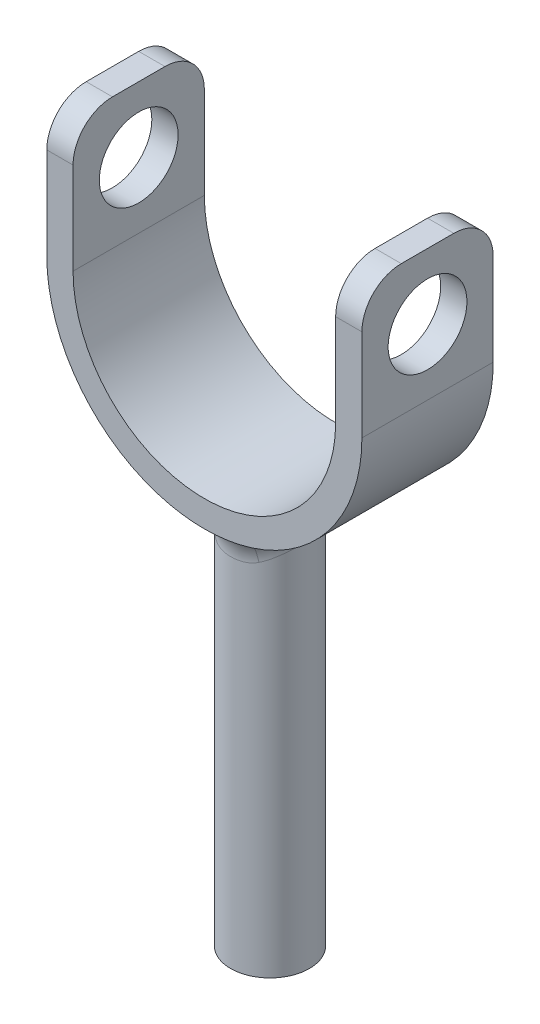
ISO-10303-21;
HEADER;
FILE_DESCRIPTION(('STEP AP214'),'2;1');
FILE_NAME('part.step','',(''),(''),'','','');
FILE_SCHEMA(('AUTOMOTIVE_DESIGN { 1 0 10303 214 1 1 1 1 }'));
ENDSEC;
DATA;
#1=APPLICATION_CONTEXT('core data for automotive mechanical design processes');
#2=APPLICATION_PROTOCOL_DEFINITION('international standard','automotive_design',2000,#1);
#3=PRODUCT_CONTEXT('',#1,'mechanical');
#4=PRODUCT('Part','Part','',(#3));
#5=PRODUCT_RELATED_PRODUCT_CATEGORY('part','',(#4));
#6=PRODUCT_DEFINITION_FORMATION('','',#4);
#7=PRODUCT_DEFINITION_CONTEXT('part definition',#1,'design');
#8=PRODUCT_DEFINITION('design','',#6,#7);
#9=PRODUCT_DEFINITION_SHAPE('','',#8);
#10=(LENGTH_UNIT() NAMED_UNIT(*) SI_UNIT(.MILLI.,.METRE.));
#11=(NAMED_UNIT(*) PLANE_ANGLE_UNIT() SI_UNIT($,.RADIAN.));
#12=(NAMED_UNIT(*) SI_UNIT($,.STERADIAN.) SOLID_ANGLE_UNIT());
#13=UNCERTAINTY_MEASURE_WITH_UNIT(LENGTH_MEASURE(1.E-05),#10,'distance_accuracy_value','');
#14=(GEOMETRIC_REPRESENTATION_CONTEXT(3) GLOBAL_UNCERTAINTY_ASSIGNED_CONTEXT((#13)) GLOBAL_UNIT_ASSIGNED_CONTEXT((#10,
#11,#12)) REPRESENTATION_CONTEXT('',''));
#15=CARTESIAN_POINT('',(0.,0.,0.));
#16=DIRECTION('',(0.,0.,1.));
#17=DIRECTION('',(1.,0.,0.));
#18=AXIS2_PLACEMENT_3D('',#15,#16,#17);
#19=CARTESIAN_POINT('',(0.,60.,25.));
#20=DIRECTION('',(0.,0.,-1.));
#21=DIRECTION('',(-1.,0.,0.));
#22=AXIS2_PLACEMENT_3D('',#19,#20,#21);
#23=CYLINDRICAL_SURFACE('',#22,60.);
#24=CARTESIAN_POINT('',(0.,60.,25.));
#25=DIRECTION('',(0.,0.,1.));
#26=DIRECTION('',(1.,0.,0.));
#27=AXIS2_PLACEMENT_3D('',#24,#25,#26);
#28=CIRCLE('',#27,60.);
#29=CARTESIAN_POINT('',(13.2664991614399,1.48504464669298,25.));
#30=VERTEX_POINT('',#29);
#31=CARTESIAN_POINT('',(60.,60.,25.));
#32=VERTEX_POINT('',#31);
#33=EDGE_CURVE('E383',#30,#32,#28,.T.);
#34=ORIENTED_EDGE('',*,*,#33,.F.);
#35=CARTESIAN_POINT('',(8.06221785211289,0.544128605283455,28.2566541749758));
#36=CARTESIAN_POINT('',(3.32800564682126,-0.0978307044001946,14.7385148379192));
#37=CARTESIAN_POINT('',(5.03888615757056,-14.3198392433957,14.1283270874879));
#38=CARTESIAN_POINT('',(8.65644492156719,0.624648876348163,27.991803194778));
#39=CARTESIAN_POINT('',(3.6149114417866,-0.106963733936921,14.6866093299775));
#40=CARTESIAN_POINT('',(5.41027807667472,-14.2191889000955,13.9959015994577));
#41=CARTESIAN_POINT('',(9.24124735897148,0.713075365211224,27.6980181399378));
#42=CARTESIAN_POINT('',(3.91224329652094,-0.114610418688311,14.6236296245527));
#43=CARTESIAN_POINT('',(5.77577959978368,-14.1086557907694,13.8490090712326));
#44=CARTESIAN_POINT('',(10.3885911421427,0.903355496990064,27.0552557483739));
#45=CARTESIAN_POINT('',(4.52369814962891,-0.124672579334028,14.470166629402));
#46=CARTESIAN_POINT('',(6.4928694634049,-13.8708056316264,13.5276278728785));
#47=CARTESIAN_POINT('',(10.9511406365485,1.00520416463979,26.7062988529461));
#48=CARTESIAN_POINT('',(4.83741163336,-0.127123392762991,14.3799640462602));
#49=CARTESIAN_POINT('',(6.84446289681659,-13.7434948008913,13.353149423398));
#50=CARTESIAN_POINT('',(12.0502913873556,1.21986588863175,25.9561599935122));
#51=CARTESIAN_POINT('',(5.47866290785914,-0.12476166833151,14.1672277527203));
#52=CARTESIAN_POINT('',(7.53143211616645,-13.4751676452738,12.9780799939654));
#53=CARTESIAN_POINT('',(12.5869256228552,1.33266442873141,25.5550469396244));
#54=CARTESIAN_POINT('',(5.80584676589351,-0.120017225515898,14.0450683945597));
#55=CARTESIAN_POINT('',(7.86682851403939,-13.3341694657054,12.7775234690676));
#56=CARTESIAN_POINT('',(13.6323188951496,1.56673259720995,24.7029004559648));
#57=CARTESIAN_POINT('',(6.46968423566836,-0.102077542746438,13.7644344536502));
#58=CARTESIAN_POINT('',(8.52019930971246,-13.04158425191,12.3514502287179));
#59=CARTESIAN_POINT('',(14.1410744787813,1.68800327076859,24.251860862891));
#60=CARTESIAN_POINT('',(6.80611045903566,-0.0889565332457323,13.6063244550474));
#61=CARTESIAN_POINT('',(8.83817154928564,-12.8899959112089,12.1259304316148));
#62=CARTESIAN_POINT('',(15.159237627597,1.944076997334,23.2726928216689));
#63=CARTESIAN_POINT('',(7.50391219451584,-0.0527405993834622,13.2398884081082));
#64=CARTESIAN_POINT('',(9.4745235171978,-12.5699037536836,11.6363464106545));
#65=CARTESIAN_POINT('',(15.6666659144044,2.07925123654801,22.7414976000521));
#66=CARTESIAN_POINT('',(7.86559962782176,-0.0291528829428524,13.0293604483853));
#67=CARTESIAN_POINT('',(9.79166619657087,-12.4009359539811,11.3707488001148));
#68=CARTESIAN_POINT('',(16.6445101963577,2.35263941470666,21.6288876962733));
#69=CARTESIAN_POINT('',(8.58586394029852,0.0275684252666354,12.5621124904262));
#70=CARTESIAN_POINT('',(10.4028188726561,-12.0592007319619,10.814443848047));
#71=CARTESIAN_POINT('',(17.1149088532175,2.49085473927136,21.0474497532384));
#72=CARTESIAN_POINT('',(8.94446914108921,0.0606186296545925,12.3057956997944));
#73=CARTESIAN_POINT('',(10.6968180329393,-11.8864315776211,10.5237248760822));
#74=CARTESIAN_POINT('',(18.0161175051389,2.76677737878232,19.8375067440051));
#75=CARTESIAN_POINT('',(9.65076238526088,0.134840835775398,11.7464777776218));
#76=CARTESIAN_POINT('',(11.2600734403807,-11.5415282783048,9.91875337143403));
#77=CARTESIAN_POINT('',(18.4469003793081,2.90448428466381,19.2089699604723));
#78=CARTESIAN_POINT('',(9.99862556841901,0.175954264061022,11.4437974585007));
#79=CARTESIAN_POINT('',(11.5293127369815,-11.3693946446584,9.60448498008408));
#80=CARTESIAN_POINT('',(19.2657793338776,3.17557106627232,17.9089542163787));
#81=CARTESIAN_POINT('',(10.6751838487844,0.264044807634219,10.7930544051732));
#82=CARTESIAN_POINT('',(12.0411120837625,-11.0305361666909,8.95447710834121));
#83=CARTESIAN_POINT('',(19.6538942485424,3.30895283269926,17.2374944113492));
#84=CARTESIAN_POINT('',(11.0041970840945,0.31098842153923,10.4452576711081));
#85=CARTESIAN_POINT('',(12.2836839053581,-10.8638089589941,8.6187472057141));
#86=CARTESIAN_POINT('',(20.400069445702,3.57305458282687,15.8268537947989));
#87=CARTESIAN_POINT('',(11.6484727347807,0.409917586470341,9.69151800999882));
#88=CARTESIAN_POINT('',(12.7500434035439,-10.5336817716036,7.91342689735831));
#89=CARTESIAN_POINT('',(20.7562605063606,3.70344460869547,15.086028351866));
#90=CARTESIAN_POINT('',(11.9631890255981,0.462054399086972,9.28377407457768));
#91=CARTESIAN_POINT('',(12.9726628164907,-10.3706942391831,7.54301417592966));
#92=CARTESIAN_POINT('',(21.4171417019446,3.95153259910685,13.5660916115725));
#93=CARTESIAN_POINT('',(12.5559428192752,0.566092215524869,8.425435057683));
#94=CARTESIAN_POINT('',(13.3857135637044,-10.0605842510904,6.78304580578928));
#95=CARTESIAN_POINT('',(21.7218308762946,4.06923032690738,12.7869796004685));
#96=CARTESIAN_POINT('',(12.8345104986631,0.618040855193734,7.97477502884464));
#97=CARTESIAN_POINT('',(13.5761442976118,-9.91346209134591,6.39348980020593));
#98=CARTESIAN_POINT('',(22.2769154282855,4.2879896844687,11.1957721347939));
#99=CARTESIAN_POINT('',(13.3477328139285,0.717967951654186,7.03599295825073));
#100=CARTESIAN_POINT('',(13.9230721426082,-9.64001289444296,5.59788606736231));
#101=CARTESIAN_POINT('',(22.5273246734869,4.38905556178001,10.3836851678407));
#102=CARTESIAN_POINT('',(13.5829454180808,0.766024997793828,6.54762311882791));
#103=CARTESIAN_POINT('',(14.0795779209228,-9.51368054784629,5.19184258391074));
#104=CARTESIAN_POINT('',(22.9714034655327,4.5710158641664,8.73215159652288));
#105=CARTESIAN_POINT('',(14.0033444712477,0.854621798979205,5.5398223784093));
#106=CARTESIAN_POINT('',(14.3571271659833,-9.2862301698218,4.36607579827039));
#107=CARTESIAN_POINT('',(23.1650732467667,4.65191037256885,7.89270510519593));
#108=CARTESIAN_POINT('',(14.1890410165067,0.895253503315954,5.01994471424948));
#109=CARTESIAN_POINT('',(14.4781707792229,-9.18511203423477,3.94635255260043));
#110=CARTESIAN_POINT('',(23.4971537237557,4.7920558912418,6.17392299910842));
#111=CARTESIAN_POINT('',(14.5089311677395,0.966689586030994,3.94483487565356));
#112=CARTESIAN_POINT('',(14.6857210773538,-9.00993013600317,3.08696149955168));
#113=CARTESIAN_POINT('',(23.6342276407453,4.85078078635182,5.29411500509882));
#114=CARTESIAN_POINT('',(14.6423351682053,0.997348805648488,3.38837498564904));
#115=CARTESIAN_POINT('',(14.7713922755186,-8.93652401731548,2.64705750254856));
#116=CARTESIAN_POINT('',(23.8449596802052,4.94156625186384,3.52053644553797));
#117=CARTESIAN_POINT('',(14.8477768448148,1.0450730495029,2.26006210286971));
#118=CARTESIAN_POINT('',(14.9030998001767,-8.82304218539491,1.76026822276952));
#119=CARTESIAN_POINT('',(23.9186163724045,4.97362622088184,2.62676556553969));
#120=CARTESIAN_POINT('',(14.920117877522,1.06220691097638,1.68741322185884));
#121=CARTESIAN_POINT('',(14.9491352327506,-8.78296722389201,1.3133827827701));
#122=CARTESIAN_POINT('',(24.0014731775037,5.00971586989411,0.833955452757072));
#123=CARTESIAN_POINT('',(15.0014027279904,1.08148455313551,0.536727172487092));
#124=CARTESIAN_POINT('',(15.000920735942,-8.73785516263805,0.416977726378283));
#125=CARTESIAN_POINT('',(24.0106933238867,5.01375426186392,-0.0650820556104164));
#126=CARTESIAN_POINT('',(15.0104908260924,1.0836624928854,-0.0421828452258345));
#127=CARTESIAN_POINT('',(15.0066833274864,-8.73280717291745,-0.0325410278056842));
#128=CARTESIAN_POINT('',(23.9645933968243,4.99364660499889,-1.86002510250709));
#129=CARTESIAN_POINT('',(14.9652290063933,1.07290006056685,-1.19550016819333));
#130=CARTESIAN_POINT('',(14.9778708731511,-8.7579417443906,-0.930012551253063));
#131=CARTESIAN_POINT('',(23.9092778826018,4.96950254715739,-2.7559308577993));
#132=CARTESIAN_POINT('',(14.9108139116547,1.05994417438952,-1.77079267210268));
#133=CARTESIAN_POINT('',(14.9432986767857,-8.7881218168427,-1.37796542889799));
#134=CARTESIAN_POINT('',(23.7418514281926,4.89707852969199,-4.46525200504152));
#135=CARTESIAN_POINT('',(14.7472247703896,1.02164730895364,-2.86176750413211));
#136=CARTESIAN_POINT('',(14.8386571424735,-8.87865183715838,-2.23262600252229));
#137=CARTESIAN_POINT('',(23.6346090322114,4.85087154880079,-5.27955964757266));
#138=CARTESIAN_POINT('',(14.6425327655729,0.997323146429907,-3.37930386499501));
#139=CARTESIAN_POINT('',(14.7716306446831,-8.93641056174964,-2.6397798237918));
#140=CARTESIAN_POINT('',(23.367354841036,4.7371028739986,-6.89208979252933));
#141=CARTESIAN_POINT('',(14.3837756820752,0.938566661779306,-4.39520950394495));
#142=CARTESIAN_POINT('',(14.6045967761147,-9.07862140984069,-3.44604489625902));
#143=CARTESIAN_POINT('',(23.2073462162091,4.66954246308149,-7.69031325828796));
#144=CARTESIAN_POINT('',(14.2294005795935,0.904067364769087,-4.89413499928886));
#145=CARTESIAN_POINT('',(14.5045913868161,-9.16307192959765,-3.84515662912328));
#146=CARTESIAN_POINT('',(22.8362119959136,4.51533786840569,-9.26508534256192));
#147=CARTESIAN_POINT('',(13.8751341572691,0.82732154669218,-5.86648252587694));
#148=CARTESIAN_POINT('',(14.2726324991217,-9.35582767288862,-4.63254267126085));
#149=CARTESIAN_POINT('',(22.6250793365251,4.42869104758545,-10.0416309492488));
#150=CARTESIAN_POINT('',(13.6748392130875,0.784997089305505,-6.3403359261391));
#151=CARTESIAN_POINT('',(14.1406745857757,-9.46413619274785,-5.02081547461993));
#152=CARTESIAN_POINT('',(22.1537069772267,4.23910203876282,-11.5678394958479));
#153=CARTESIAN_POINT('',(13.2335649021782,0.695411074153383,-7.25692477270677));
#154=CARTESIAN_POINT('',(13.8460668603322,-9.70112244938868,-5.78391974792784));
#155=CARTESIAN_POINT('',(21.8934659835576,4.13615942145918,-12.3175017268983));
#156=CARTESIAN_POINT('',(12.9921387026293,0.64807705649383,-7.69995308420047));
#157=CARTESIAN_POINT('',(13.6834162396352,-9.82980072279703,-6.15875086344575));
#158=CARTESIAN_POINT('',(21.3270429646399,3.91748017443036,-13.7828937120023));
#159=CARTESIAN_POINT('',(12.4750720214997,0.551659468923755,-8.54881204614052));
#160=CARTESIAN_POINT('',(13.3294018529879,-10.1031497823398,-6.89144685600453));
#161=CARTESIAN_POINT('',(21.0210196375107,3.80178809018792,-14.498729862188));
#162=CARTESIAN_POINT('',(12.1990937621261,0.502526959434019,-8.95491399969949));
#163=CARTESIAN_POINT('',(13.1381372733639,-10.2477648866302,-7.2493649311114));
#164=CARTESIAN_POINT('',(20.3645134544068,3.56057321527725,-15.8954937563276));
#165=CARTESIAN_POINT('',(11.6182632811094,0.405324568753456,-9.72819800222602));
#166=CARTESIAN_POINT('',(12.7278209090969,-10.549283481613,-7.94774687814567));
#167=CARTESIAN_POINT('',(20.0140108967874,3.43504607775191,-16.5764058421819));
#168=CARTESIAN_POINT('',(11.3129786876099,0.357228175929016,-10.0953540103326));
#169=CARTESIAN_POINT('',(12.5087568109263,-10.7061924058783,-8.28820292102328));
#170=CARTESIAN_POINT('',(19.2709618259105,3.17760490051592,-17.8993763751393));
#171=CARTESIAN_POINT('',(10.680221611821,0.264901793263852,-10.7879546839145));
#172=CARTESIAN_POINT('',(12.0443511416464,-11.0279938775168,-8.94968818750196));
#173=CARTESIAN_POINT('',(18.8784149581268,3.04569080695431,-18.5414344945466));
#174=CARTESIAN_POINT('',(10.3523953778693,0.220677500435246,-11.1132540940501));
#175=CARTESIAN_POINT('',(11.7990093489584,-11.1928864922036,-9.27071724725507));
#176=CARTESIAN_POINT('',(18.0536121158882,2.77889425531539,-19.7833570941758));
#177=CARTESIAN_POINT('',(9.68145972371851,0.138475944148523,-11.7206206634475));
#178=CARTESIAN_POINT('',(11.2835075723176,-11.5263821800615,-9.89167854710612));
#179=CARTESIAN_POINT('',(17.6213548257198,2.64401169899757,-20.3832201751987));
#180=CARTESIAN_POINT('',(9.33809599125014,0.100537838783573,-12.0024238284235));
#181=CARTESIAN_POINT('',(11.0133467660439,-11.6949853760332,-10.1916100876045));
#182=CARTESIAN_POINT('',(16.6957256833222,2.36756021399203,-21.5680003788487));
#183=CARTESIAN_POINT('',(8.6246665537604,0.0309191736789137,-12.5362273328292));
#184=CARTESIAN_POINT('',(10.434828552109,-12.0405497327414,-10.7840001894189));
#185=CARTESIAN_POINT('',(16.2003332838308,2.22601367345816,-22.1504622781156));
#186=CARTESIAN_POINT('',(8.25417755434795,-0.000232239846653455,-12.7853403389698));
#187=CARTESIAN_POINT('',(10.1252083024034,-12.2174829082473,-11.0752311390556));
#188=CARTESIAN_POINT('',(15.1710787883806,1.94724284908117,-23.2614459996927));
#189=CARTESIAN_POINT('',(7.51228335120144,-0.052364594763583,-13.2362167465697));
#190=CARTESIAN_POINT('',(9.48192424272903,-12.565946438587,-11.6307229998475));
#191=CARTESIAN_POINT('',(14.6372153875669,1.8100187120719,-23.7899659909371));
#192=CARTESIAN_POINT('',(7.14090270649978,-0.0732445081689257,-13.437500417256));
#193=CARTESIAN_POINT('',(9.14825961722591,-12.7374766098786,-11.8949829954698));
#194=CARTESIAN_POINT('',(13.5344634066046,1.54369324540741,-24.7891658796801));
#195=CARTESIAN_POINT('',(6.40512025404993,-0.104646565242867,-13.7952174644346));
#196=CARTESIAN_POINT('',(8.4590396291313,-13.0703834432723,-12.3945829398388));
#197=CARTESIAN_POINT('',(12.9655954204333,1.4145872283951,-25.2598793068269));
#198=CARTESIAN_POINT('',(6.04091476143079,-0.11507002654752,-13.9511832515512));
#199=CARTESIAN_POINT('',(8.10349713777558,-13.2317659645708,-12.6299396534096));
#200=CARTESIAN_POINT('',(11.7960240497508,1.16794302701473,-26.1402392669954));
#201=CARTESIAN_POINT('',(5.3258953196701,-0.126535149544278,-14.2226243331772));
#202=CARTESIAN_POINT('',(7.37251503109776,-13.5400712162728,-13.0701196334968));
#203=CARTESIAN_POINT('',(11.1953227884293,1.05040407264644,-26.5498898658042));
#204=CARTESIAN_POINT('',(4.97544416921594,-0.127487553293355,-14.3376396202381));
#205=CARTESIAN_POINT('',(6.99707674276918,-13.6869949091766,-13.2749449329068));
#206=CARTESIAN_POINT('',(9.96678879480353,0.83031285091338,-27.30415238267));
#207=CARTESIAN_POINT('',(4.29330162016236,-0.122062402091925,-14.53272135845));
#208=CARTESIAN_POINT('',(6.22924299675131,-13.9621089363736,-13.6520761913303));
#209=CARTESIAN_POINT('',(9.33899740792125,0.727738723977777,-27.648859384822));
#210=CARTESIAN_POINT('',(3.96206701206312,-0.115636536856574,-14.6124517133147));
#211=CARTESIAN_POINT('',(5.83687337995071,-14.0903265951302,-13.8244296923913));
#212=CARTESIAN_POINT('',(8.05985992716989,0.540295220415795,-28.2707224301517));
#213=CARTESIAN_POINT('',(3.32030463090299,-0.0983801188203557,-14.7438937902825));
#214=CARTESIAN_POINT('',(5.03741245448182,-14.3246309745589,-14.1353612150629));
#215=CARTESIAN_POINT('',(7.40851584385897,0.455424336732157,-28.5478842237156));
#216=CARTESIAN_POINT('',(3.01033816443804,-0.0875284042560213,-14.795316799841));
#217=CARTESIAN_POINT('',(4.6303224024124,-14.4307195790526,-14.2739421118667));
#218=CARTESIAN_POINT('',(6.08455169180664,0.305584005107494,-29.0327268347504));
#219=CARTESIAN_POINT('',(2.40950084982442,-0.064755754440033,-14.8773610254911));
#220=CARTESIAN_POINT('',(3.80284480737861,-14.618019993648,-14.5163634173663));
#221=CARTESIAN_POINT('',(5.41186403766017,0.240686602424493,-29.2401563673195));
#222=CARTESIAN_POINT('',(2.11930070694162,-0.0528429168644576,-14.9077148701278));
#223=CARTESIAN_POINT('',(3.38241502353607,-14.6991417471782,-14.6200781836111));
#224=CARTESIAN_POINT('',(4.39272104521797,0.16004276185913,-29.4964069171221));
#225=CARTESIAN_POINT('',(1.69700386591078,-0.0366787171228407,-14.9422352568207));
#226=CARTESIAN_POINT('',(2.74545065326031,-14.7999465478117,-14.7482034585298));
#227=CARTESIAN_POINT('',(4.05119898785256,0.135939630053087,-29.5726920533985));
#228=CARTESIAN_POINT('',(1.5582358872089,-0.0315700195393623,-14.951906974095));
#229=CARTESIAN_POINT('',(2.53199936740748,-14.8300754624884,-14.7863460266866));
#230=CARTESIAN_POINT('',(3.36546085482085,0.0934748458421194,-29.7067462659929));
#231=CARTESIAN_POINT('',(1.28415974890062,-0.0222487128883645,-14.9682022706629));
#232=CARTESIAN_POINT('',(2.10341303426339,-14.8831564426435,-14.8533731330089));
#233=CARTESIAN_POINT('',(3.02124460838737,0.0751135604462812,-29.7645141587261));
#234=CARTESIAN_POINT('',(1.14892195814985,-0.0180399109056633,-14.9748165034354));
#235=CARTESIAN_POINT('',(1.88827788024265,-14.9061080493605,-14.8822570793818));
#236=CARTESIAN_POINT('',(2.67600367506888,0.0597046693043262,-29.8129325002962));
#237=CARTESIAN_POINT('',(1.01508785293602,-0.0144460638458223,-14.9802280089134));
#238=CARTESIAN_POINT('',(1.67250229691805,-14.9253691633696,-14.9064662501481));
#239=(BOUNDED_SURFACE() B_SPLINE_SURFACE(3,2,((#35,#36,#37),(#38,#39,#40),(#41,#42,#43),(#44,
#45,#46),(#47,#48,#49),(#50,#51,#52),(#53,#54,#55),(#56,#57,#58),(#59,#60,#61),(#62,#63,#64),
(#65,#66,#67),(#68,#69,#70),(#71,#72,#73),(#74,#75,#76),(#77,#78,#79),(#80,#81,#82),(#83,#84,
#85),(#86,#87,#88),(#89,#90,#91),(#92,#93,#94),(#95,#96,#97),(#98,#99,#100),(#101,#102,#103),
(#104,#105,#106),(#107,#108,#109),(#110,#111,#112),(#113,#114,#115),(#116,#117,#118),(#119,#120,
#121),(#122,#123,#124),(#125,#126,#127),(#128,#129,#130),(#131,#132,#133),(#134,#135,#136),
(#137,#138,#139),(#140,#141,#142),(#143,#144,#145),(#146,#147,#148),(#149,#150,#151),(#152,#153,
#154),(#155,#156,#157),(#158,#159,#160),(#161,#162,#163),(#164,#165,#166),(#167,#168,#169),
(#170,#171,#172),(#173,#174,#175),(#176,#177,#178),(#179,#180,#181),(#182,#183,#184),(#185,#186,
#187),(#188,#189,#190),(#191,#192,#193),(#194,#195,#196),(#197,#198,#199),(#200,#201,#202),
(#203,#204,#205),(#206,#207,#208),(#209,#210,#211),(#212,#213,#214),(#215,#216,#217),(#218,#219,
#220),(#221,#222,#223),(#224,#225,#226),(#227,#228,#229),(#230,#231,#232),(#233,#234,#235),
(#236,#237,#238)),.UNSPECIFIED.,.F.,.F.,.F.) B_SPLINE_SURFACE_WITH_KNOTS((4,2,2,2,2,2,2,2,2,2,2,
2,2,2,2,2,2,2,2,2,2,2,2,2,2,2,2,2,2,2,2,2,2,4),(3,3),(0.,2.38412307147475,4.76736488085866,
7.14748928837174,9.52790784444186,12.0583341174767,14.589938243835,17.1232627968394,
19.6554645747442,22.2908538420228,24.9262922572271,27.5610565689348,30.1958099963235,
32.8896560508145,35.5835628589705,38.2766320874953,40.9695110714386,43.4481542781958,
45.9266485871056,48.4054855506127,50.8843878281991,53.3548883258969,55.8264869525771,
58.2981064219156,60.7698078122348,63.3718177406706,65.9739159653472,68.5744976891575,
71.174906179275,73.7714773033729,76.3678272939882,78.9734355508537,80.27716141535,
81.580970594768),(0.,1.),
.UNSPECIFIED.) GEOMETRIC_REPRESENTATION_ITEM() RATIONAL_B_SPLINE_SURFACE(((1.,0.722889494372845,
1.),(1.,0.725189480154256,1.),(1.,0.727698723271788,1.),(1.,0.73305290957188,1.),(1.,
0.735897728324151,1.),(1.,0.741838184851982,1.),(1.,0.744933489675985,1.),(1.,0.751294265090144,
1.),(1.,0.754559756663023,1.),(1.,0.761386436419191,1.),(1.,0.764953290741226,1.),(1.,
0.772090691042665,1.),(1.,0.775661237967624,1.),(1.,0.782715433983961,1.),(1.,0.786199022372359,
1.),(1.,0.79298921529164,1.),(1.,0.796295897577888,1.),(1.,0.802783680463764,1.),(1.,
0.805954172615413,1.),(1.,0.811935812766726,1.),(1.,0.814746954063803,1.),(1.,0.819934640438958,
1.),(1.,0.822311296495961,1.),(1.,0.826566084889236,1.),(1.,0.828444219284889,1.),(1.,
0.831684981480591,1.),(1.,0.833035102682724,1.),(1.,0.835117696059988,1.),(1.,0.835850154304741,
1.),(1.,0.836674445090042,1.),(1.,0.83676647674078,1.),(1.,0.836307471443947,1.),(1.,
0.835756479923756,1.),(1.,0.834097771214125,1.),(1.,0.833037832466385,1.),(1.,0.830415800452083,
1.),(1.,0.828853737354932,1.),(1.,0.825266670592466,1.),(1.,0.823241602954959,1.),(1.,
0.818778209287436,1.),(1.,0.816339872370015,1.),(1.,0.811116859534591,1.),(1.,0.808333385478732,
1.),(1.,0.802476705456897,1.),(1.,0.799403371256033,1.),(1.,0.793038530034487,1.),(1.,
0.789747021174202,1.),(1.,0.783021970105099,1.),(1.,0.779588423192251,1.),(1.,0.772478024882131,
1.),(1.,0.76879788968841,1.),(1.,0.761471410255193,1.),(1.,0.757825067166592,1.),(1.,
0.750674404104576,1.),(1.,0.747170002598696,1.),(1.,0.740410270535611,1.),(1.,0.737154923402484,
1.),(1.,0.73100659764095,1.),(1.,0.728113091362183,1.),(1.,0.722787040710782,1.),(1.,
0.720354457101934,1.),(1.,0.716035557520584,1.),(1.,0.714151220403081,1.),(1.,0.711800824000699,
1.),(1.,0.711096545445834,1.),(1.,0.709853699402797,1.),(1.,0.709315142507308,1.),(1.,
0.708862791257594,1.))) REPRESENTATION_ITEM('') SURFACE());
#240=CARTESIAN_POINT('',(-24.,5.00909166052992,0.));
#241=CARTESIAN_POINT('',(-23.9998107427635,5.00860299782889,2.76581991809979));
#242=CARTESIAN_POINT('',(-23.692745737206,4.87184477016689,5.54180993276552));
#243=CARTESIAN_POINT('',(-22.4117340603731,4.33836630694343,11.1547241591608));
#244=CARTESIAN_POINT('',(-21.383965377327,3.92078555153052,13.9771988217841));
#245=CARTESIAN_POINT('',(-18.5896758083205,2.93281124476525,19.2386859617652));
#246=CARTESIAN_POINT('',(-16.817483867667,2.36125696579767,21.6745526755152));
#247=CARTESIAN_POINT('',(-12.5553970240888,1.28909273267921,25.7800517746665));
#248=CARTESIAN_POINT('',(-10.0813964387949,0.787242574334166,27.4647352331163));
#249=CARTESIAN_POINT('',(-5.38366516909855,0.21045731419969,29.3459858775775));
#250=CARTESIAN_POINT('',(-3.29202690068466,0.0543180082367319,29.8309385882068));
#251=CARTESIAN_POINT('',(-0.579298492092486,-0.000548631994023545,30.0014931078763));
#252=CARTESIAN_POINT('',(0.0296109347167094,-0.00337295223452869,30.0103068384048));
#253=CARTESIAN_POINT('',(2.79071626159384,0.0273277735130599,29.9154187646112));
#254=CARTESIAN_POINT('',(4.9466492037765,0.171000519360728,29.4703091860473));
#255=CARTESIAN_POINT('',(7.32535797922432,0.447513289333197,28.5729886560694));
#256=CARTESIAN_POINT('',(7.69617914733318,0.494394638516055,28.4201066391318));
#257=CARTESIAN_POINT('',(10.4948776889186,0.874656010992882,27.1703640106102));
#258=CARTESIAN_POINT('',(12.7163051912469,1.33117812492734,25.6171972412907));
#259=CARTESIAN_POINT('',(16.816597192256,2.35919201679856,21.6843429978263));
#260=CARTESIAN_POINT('',(18.606397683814,2.93786141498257,19.2203891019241));
#261=CARTESIAN_POINT('',(21.5843593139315,3.99259918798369,13.5850721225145));
#262=CARTESIAN_POINT('',(22.687313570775,4.45098584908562,10.3661641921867));
#263=CARTESIAN_POINT('',(24.0065137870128,5.00627797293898,3.53686977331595));
#264=CARTESIAN_POINT('',(24.1706930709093,5.08193117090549,-0.0853093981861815));
#265=CARTESIAN_POINT('',(23.5060020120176,4.79564812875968,-6.87470106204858));
#266=CARTESIAN_POINT('',(22.7682920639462,4.47385316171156,-10.052845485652));
#267=CARTESIAN_POINT('',(20.5119841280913,3.60285814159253,-15.8928530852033));
#268=CARTESIAN_POINT('',(19.0363468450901,3.06646273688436,-18.5730465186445));
#269=CARTESIAN_POINT('',(15.338689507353,1.96241561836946,-23.3040100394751));
#270=CARTESIAN_POINT('',(13.1308380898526,1.39551652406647,-25.3654113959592));
#271=CARTESIAN_POINT('',(8.74063516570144,0.611827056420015,-28.0541847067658));
#272=CARTESIAN_POINT('',(6.72244113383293,0.341500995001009,-28.9210500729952));
#273=CARTESIAN_POINT('',(3.97964707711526,0.128377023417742,-29.5966363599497));
#274=CARTESIAN_POINT('',(3.33164648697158,0.088547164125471,-29.7219712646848));
#275=CARTESIAN_POINT('',(0.268942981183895,-0.0461847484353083,-30.1468783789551));
#276=CARTESIAN_POINT('',(-2.24112290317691,-0.00398168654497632,-30.0175209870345));
#277=CARTESIAN_POINT('',(-4.74783020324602,0.187907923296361,-29.4078522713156));
#278=CARTESIAN_POINT('',(-4.90100804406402,0.200274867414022,-29.3685399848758));
#279=CARTESIAN_POINT('',(-7.54649308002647,0.424404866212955,-28.6550372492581));
#280=CARTESIAN_POINT('',(-9.90860330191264,0.787262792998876,-27.4846982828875));
#281=CARTESIAN_POINT('',(-14.3227292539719,1.68423304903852,-24.310485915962));
#282=CARTESIAN_POINT('',(-16.3095077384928,2.23306747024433,-22.2273437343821));
#283=CARTESIAN_POINT('',(-19.8288230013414,3.33762564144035,-17.264118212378));
#284=CARTESIAN_POINT('',(-21.2626939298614,3.88411483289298,-14.3141479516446));
#285=CARTESIAN_POINT('',(-23.3015496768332,4.69759800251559,-7.97777369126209));
#286=CARTESIAN_POINT('',(-23.8738618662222,4.95348852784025,-4.57925062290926));
#287=CARTESIAN_POINT('',(-23.9938143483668,5.00646028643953,-0.788565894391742));
#288=CARTESIAN_POINT('',(-24.0000269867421,5.00916134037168,-0.394386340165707));
#289=CARTESIAN_POINT('',(-24.,5.00909166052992,0.));
#290=B_SPLINE_CURVE_WITH_KNOTS('',3,(#240,#241,#242,#243,#244,#245,#246,#247,#248,#249,#250,
#251,#252,#253,#254,#255,#256,#257,#258,#259,#260,#261,#262,#263,#264,#265,#266,#267,#268,#269,
#270,#271,#272,#273,#274,#275,#276,#277,#278,#279,#280,#281,#282,#283,#284,#285,#286,#287,#288,
#289),.UNSPECIFIED.,.T.,.F.,(4,2,2,2,2,2,2,2,2,2,2,2,2,2,2,2,2,2,2,2,2,2,2,2,4),(0.,
8.29598123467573,17.2884285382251,26.3506600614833,35.2221155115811,41.5464099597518,
43.3725613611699,49.822683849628,51.0345797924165,59.0887296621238,68.2500102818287,
78.3947097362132,89.0969779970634,98.8014137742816,107.997149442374,117.024423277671,
123.537501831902,125.520507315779,132.800713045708,133.27675540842,141.048687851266,
149.699168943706,159.527345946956,169.719595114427,170.902543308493),.UNSPECIFIED.);
#291=CARTESIAN_POINT('',(13.2664991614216,1.48504464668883,-25.));
#292=VERTEX_POINT('',#291);
#293=EDGE_CURVE('E318',#30,#292,#290,.T.);
#294=ORIENTED_EDGE('',*,*,#293,.T.);
#295=CARTESIAN_POINT('',(0.,60.,-25.));
#296=DIRECTION('',(0.,0.,1.));
#297=DIRECTION('',(1.,0.,0.));
#298=AXIS2_PLACEMENT_3D('',#295,#296,#297);
#299=CIRCLE('',#298,60.);
#300=CARTESIAN_POINT('',(60.,60.,-25.));
#301=VERTEX_POINT('',#300);
#302=EDGE_CURVE('E401',#292,#301,#299,.T.);
#303=ORIENTED_EDGE('',*,*,#302,.T.);
#304=DIRECTION('',(0.,0.,-1.));
#305=VECTOR('',#304,1.);
#306=CARTESIAN_POINT('',(60.,60.,25.));
#307=LINE('',#306,#305);
#308=EDGE_CURVE('E414',#32,#301,#307,.T.);
#309=ORIENTED_EDGE('',*,*,#308,.F.);
#310=EDGE_LOOP('',(#34,#294,#303,#309));
#311=FACE_BOUND('',#310,.T.);
#312=ADVANCED_FACE('F49',(#311),#23,.T.);
#313=CARTESIAN_POINT('',(-60.,60.,-25.));
#314=VERTEX_POINT('',#313);
#315=CARTESIAN_POINT('',(-13.2664991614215,1.4850446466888,-25.));
#316=VERTEX_POINT('',#315);
#317=EDGE_CURVE('E402',#314,#316,#299,.T.);
#318=ORIENTED_EDGE('',*,*,#317,.T.);
#319=CARTESIAN_POINT('',(-23.9813400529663,5.00095156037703,-1.18277300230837));
#320=CARTESIAN_POINT('',(-14.9816780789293,1.07681177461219,-0.760166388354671));
#321=CARTESIAN_POINT('',(-14.988337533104,-8.74881054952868,-0.591386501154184));
#322=CARTESIAN_POINT('',(-24.0064265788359,5.01189104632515,-0.388080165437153));
#323=CARTESIAN_POINT('',(-15.0062986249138,1.08266353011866,-0.249825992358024));
#324=CARTESIAN_POINT('',(-15.0040166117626,-8.73513619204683,-0.194040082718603));
#325=CARTESIAN_POINT('',(-24.0062127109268,5.01179666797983,0.408065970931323));
#326=CARTESIAN_POINT('',(-15.0060861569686,1.08261192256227,0.262678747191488));
#327=CARTESIAN_POINT('',(-15.0038829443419,-8.73525416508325,0.204032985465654));
#328=CARTESIAN_POINT('',(-23.9551996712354,4.98955369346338,1.9973063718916));
#329=CARTESIAN_POINT('',(-14.9560103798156,1.07071229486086,1.28354727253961));
#330=CARTESIAN_POINT('',(-14.9719997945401,-8.76305788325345,0.998653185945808));
#331=CARTESIAN_POINT('',(-23.9044033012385,4.96740631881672,2.79040080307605));
#332=CARTESIAN_POINT('',(-14.9060894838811,1.05885059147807,1.79252384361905));
#333=CARTESIAN_POINT('',(-14.9402520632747,-8.79074210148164,1.39520040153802));
#334=CARTESIAN_POINT('',(-23.7527864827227,4.90179752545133,4.36766522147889));
#335=CARTESIAN_POINT('',(-14.7579024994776,1.02413578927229,2.79955778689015));
#336=CARTESIAN_POINT('',(-14.845491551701,-8.87275309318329,2.18383261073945));
#337=CARTESIAN_POINT('',(-23.6519659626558,4.85833607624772,5.15183519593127));
#338=CARTESIAN_POINT('',(-14.6594618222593,1.0012423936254,3.2981890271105));
#339=CARTESIAN_POINT('',(-14.7824787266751,-8.92707990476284,2.57591759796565));
#340=CARTESIAN_POINT('',(-23.4013603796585,4.75151726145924,6.70568352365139));
#341=CARTESIAN_POINT('',(-14.4166435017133,0.945968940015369,4.2781619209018));
#342=CARTESIAN_POINT('',(-14.6258502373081,-9.06060342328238,3.35284176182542));
#343=CARTESIAN_POINT('',(-23.2515746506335,4.68815962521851,7.4753616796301));
#344=CARTESIAN_POINT('',(-14.2719921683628,0.913529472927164,4.76000397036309));
#345=CARTESIAN_POINT('',(-14.5322341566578,-9.13980046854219,3.73768083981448));
#346=CARTESIAN_POINT('',(-22.9077538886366,4.54489402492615,8.98085517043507));
#347=CARTESIAN_POINT('',(-13.9432548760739,0.841912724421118,5.69177562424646));
#348=CARTESIAN_POINT('',(-14.3173461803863,-9.31888246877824,4.49042758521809));
#349=CARTESIAN_POINT('',(-22.7145981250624,4.46531749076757,9.71703453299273));
#350=CARTESIAN_POINT('',(-13.7596126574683,0.80280500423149,6.14254941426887));
#351=CARTESIAN_POINT('',(-14.1966238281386,-9.41835313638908,4.85851726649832));
#352=CARTESIAN_POINT('',(-22.2842135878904,4.2912245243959,11.1660830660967));
#353=CARTESIAN_POINT('',(-13.3553173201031,0.719773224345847,7.01709129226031));
#354=CARTESIAN_POINT('',(-13.9276334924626,-9.63596934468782,5.58304153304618));
#355=CARTESIAN_POINT('',(-22.0469857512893,4.1967084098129,11.8789527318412));
#356=CARTESIAN_POINT('',(-13.1342940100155,0.67578700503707,7.44112696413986));
#357=CARTESIAN_POINT('',(-13.779366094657,-9.75411448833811,5.93947636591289));
#358=CARTESIAN_POINT('',(-21.5302631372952,3.99531611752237,13.2775380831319));
#359=CARTESIAN_POINT('',(-12.6598041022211,0.585518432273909,8.25818711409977));
#360=CARTESIAN_POINT('',(-13.456414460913,-10.0058548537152,6.63876904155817));
#361=CARTESIAN_POINT('',(-21.2507654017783,3.88843907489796,13.9632518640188));
#362=CARTESIAN_POINT('',(-12.4059512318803,0.539185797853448,8.65135662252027));
#363=CARTESIAN_POINT('',(-13.2817283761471,-10.139451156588,6.9816259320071));
#364=CARTESIAN_POINT('',(-20.6513324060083,3.66506609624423,15.3042161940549));
#365=CARTESIAN_POINT('',(-11.8708150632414,0.446767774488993,9.40352266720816));
#366=CARTESIAN_POINT('',(-12.9070827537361,-10.4186673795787,7.65210809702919));
#367=CARTESIAN_POINT('',(-20.3313825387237,3.54856669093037,15.9594556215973));
#368=CARTESIAN_POINT('',(-11.5891549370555,0.400652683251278,9.76253269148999));
#369=CARTESIAN_POINT('',(-12.7071140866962,-10.5642916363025,7.9797278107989));
#370=CARTESIAN_POINT('',(-19.6295756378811,3.30054981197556,17.2802895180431));
#371=CARTESIAN_POINT('',(-10.9835451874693,0.307999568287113,10.4675321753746));
#372=CARTESIAN_POINT('',(-12.2684847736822,-10.8743127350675,8.6401447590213));
#373=CARTESIAN_POINT('',(-19.2449660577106,3.16855100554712,17.9434596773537));
#374=CARTESIAN_POINT('',(-10.657801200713,0.261673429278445,10.8106031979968));
#375=CARTESIAN_POINT('',(-12.0281037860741,-11.0393112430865,8.97172983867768));
#376=CARTESIAN_POINT('',(-18.4342492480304,2.90043155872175,19.227528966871));
#377=CARTESIAN_POINT('',(-9.98843062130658,0.174740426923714,11.4527311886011));
#378=CARTESIAN_POINT('',(-11.5214057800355,-11.3744605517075,9.61376448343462));
#379=CARTESIAN_POINT('',(-18.0081401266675,2.76431073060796,19.8484261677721));
#380=CARTESIAN_POINT('',(-9.64450436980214,0.134164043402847,11.7515477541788));
#381=CARTESIAN_POINT('',(-11.2550875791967,-11.5446115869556,9.92421308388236));
#382=CARTESIAN_POINT('',(-17.1166603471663,2.49141537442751,21.044887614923));
#383=CARTESIAN_POINT('',(-8.94591750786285,0.0607902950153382,12.3045326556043));
#384=CARTESIAN_POINT('',(-10.6979127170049,-11.8857307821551,10.5224438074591));
#385=CARTESIAN_POINT('',(-16.6512695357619,2.35464054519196,21.6204282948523));
#386=CARTESIAN_POINT('',(-8.59107862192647,0.0280593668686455,12.5583339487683));
#387=CARTESIAN_POINT('',(-10.4070434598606,-12.0566993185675,10.8102141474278));
#388=CARTESIAN_POINT('',(-15.6841374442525,2.08402744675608,22.7223673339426));
#389=CARTESIAN_POINT('',(-7.87830718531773,-0.0282311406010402,13.021506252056));
#390=CARTESIAN_POINT('',(-9.80258590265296,-12.3949656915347,11.361183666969));
#391=CARTESIAN_POINT('',(-15.1824081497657,1.9501882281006,23.2487817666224));
#392=CARTESIAN_POINT('',(-7.52034610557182,-0.0517087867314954,13.2304805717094));
#393=CARTESIAN_POINT('',(-9.48900509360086,-12.5622647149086,11.6243908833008));
#394=CARTESIAN_POINT('',(-14.1182682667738,1.68198494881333,24.2754145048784));
#395=CARTESIAN_POINT('',(-6.78962690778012,-0.0899918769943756,13.615762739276));
#396=CARTESIAN_POINT('',(-8.82391766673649,-12.8975188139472,12.1377072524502));
#397=CARTESIAN_POINT('',(-13.5540606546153,1.54795281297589,24.7728634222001));
#398=CARTESIAN_POINT('',(-6.41738746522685,-0.10416864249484,13.7892205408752));
#399=CARTESIAN_POINT('',(-8.47128790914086,-13.0650589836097,12.3864317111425));
#400=CARTESIAN_POINT('',(-12.3916784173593,1.29054060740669,25.706380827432));
#401=CARTESIAN_POINT('',(-5.68446748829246,-0.122429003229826,14.0929516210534));
#402=CARTESIAN_POINT('',(-7.74479901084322,-13.3868242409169,12.8531904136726));
#403=CARTESIAN_POINT('',(-11.7935023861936,1.167160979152,26.1424467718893));
#404=CARTESIAN_POINT('',(-5.32411199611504,-0.12641129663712,14.2227252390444));
#405=CARTESIAN_POINT('',(-7.37093899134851,-13.5410487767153,13.071223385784));
#406=CARTESIAN_POINT('',(-10.5671771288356,0.934577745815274,26.9494548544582));
#407=CARTESIAN_POINT('',(-4.62080923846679,-0.126046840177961,14.4444805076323));
#408=CARTESIAN_POINT('',(-6.60448570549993,-13.8317778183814,13.4747274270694));
#409=CARTESIAN_POINT('',(-9.93903474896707,0.825370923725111,27.3204117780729));
#410=CARTESIAN_POINT('',(-4.27832858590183,-0.121628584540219,14.5360370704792));
#411=CARTESIAN_POINT('',(-6.21189671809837,-13.9682863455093,13.6602058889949));
#412=CARTESIAN_POINT('',(-8.65700678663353,0.624271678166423,27.9938500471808));
#413=CARTESIAN_POINT('',(-3.61415898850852,-0.107246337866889,14.6880947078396));
#414=CARTESIAN_POINT('',(-5.41062924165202,-14.2196604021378,13.9969250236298));
#415=CARTESIAN_POINT('',(-8.00312263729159,0.532378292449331,28.2963351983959));
#416=CARTESIAN_POINT('',(-3.2930377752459,-0.0972478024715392,14.7482603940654));
#417=CARTESIAN_POINT('',(-5.00195164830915,-14.334527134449,14.1481675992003));
#418=CARTESIAN_POINT('',(-6.69919287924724,0.371683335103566,28.8198100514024));
#419=CARTESIAN_POINT('',(-2.6836857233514,-0.0755457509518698,14.8430615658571));
#420=CARTESIAN_POINT('',(-4.18699554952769,-14.5353958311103,14.4099050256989));
#421=CARTESIAN_POINT('',(-6.04990869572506,0.302150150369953,29.0434119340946));
#422=CARTESIAN_POINT('',(-2.39516037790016,-0.0639194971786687,14.878365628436));
#423=CARTESIAN_POINT('',(-3.78119293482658,-14.6223123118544,14.5217059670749));
#424=CARTESIAN_POINT('',(-4.73679561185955,0.183637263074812,29.4219492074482));
#425=CARTESIAN_POINT('',(-1.8353860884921,-0.0418413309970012,14.933260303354));
#426=CARTESIAN_POINT('',(-2.96049725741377,-14.7704534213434,14.7109746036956));
#427=CARTESIAN_POINT('',(-4.07296700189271,0.134657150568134,29.576885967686));
#428=CARTESIAN_POINT('',(-1.56467682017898,-0.0314130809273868,14.952730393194));
#429=CARTESIAN_POINT('',(-2.54560437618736,-14.8316785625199,14.7884429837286));
#430=CARTESIAN_POINT('',(-2.73623088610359,0.0586868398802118,29.8163326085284));
#431=CARTESIAN_POINT('',(-1.03551931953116,-0.0143872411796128,14.9810576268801));
#432=CARTESIAN_POINT('',(-1.71014430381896,-14.9266414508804,14.9081663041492));
#433=CARTESIAN_POINT('',(-2.06332688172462,0.0316883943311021,29.9008689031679));
#434=CARTESIAN_POINT('',(-0.77758011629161,-0.00781553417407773,14.9898599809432));
#435=CARTESIAN_POINT('',(-1.28957930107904,-14.9603895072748,14.9504344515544));
#436=CARTESIAN_POINT('',(-0.71369662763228,0.000448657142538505,29.9986320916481));
#437=CARTESIAN_POINT('',(-0.266720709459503,-0.000143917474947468,14.9999421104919));
#438=CARTESIAN_POINT('',(-0.446060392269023,-14.999439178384,14.9993160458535));
#439=CARTESIAN_POINT('',(-0.0369705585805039,-0.00379370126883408,30.0118623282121));
#440=CARTESIAN_POINT('',(-0.0142903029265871,0.000941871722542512,15.0012029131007));
#441=CARTESIAN_POINT('',(-0.0231065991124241,-15.0047421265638,15.005931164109));
#442=CARTESIAN_POINT('',(1.27252364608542,0.010147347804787,29.9682798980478));
#443=CARTESIAN_POINT('',(0.477764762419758,-0.00252668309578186,14.9968068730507));
#444=CARTESIAN_POINT('',(0.795327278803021,-14.9873158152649,14.9841399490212));
#445=CARTESIAN_POINT('',(1.90540166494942,0.0269489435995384,29.91578315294));
#446=CARTESIAN_POINT('',(0.716784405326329,-0.00672781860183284,14.9915836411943));
#447=CARTESIAN_POINT('',(1.19087604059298,-14.9663138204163,14.9578915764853));
#448=CARTESIAN_POINT('',(3.16500513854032,0.0802198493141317,29.7485248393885));
#449=CARTESIAN_POINT('',(1.20379477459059,-0.0192766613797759,14.9731510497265));
#450=CARTESIAN_POINT('',(1.9781282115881,-14.8997251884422,14.8742624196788));
#451=CARTESIAN_POINT('',(3.7917308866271,0.116688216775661,29.6337662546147));
#452=CARTESIAN_POINT('',(1.45137153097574,-0.0276048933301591,14.9599745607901));
#453=CARTESIAN_POINT('',(2.36983180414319,-14.8541397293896,14.8168831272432));
#454=CARTESIAN_POINT('',(5.03463121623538,0.208354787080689,29.3431271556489));
#455=CARTESIAN_POINT('',(1.96061878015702,-0.0465709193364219,14.9220557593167));
#456=CARTESIAN_POINT('',(3.14664451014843,-14.7395565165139,14.6715635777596));
#457=CARTESIAN_POINT('',(5.65080583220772,0.263552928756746,29.1672468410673));
#458=CARTESIAN_POINT('',(2.22185436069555,-0.0571858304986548,14.8973852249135));
#459=CARTESIAN_POINT('',(3.53175364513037,-14.6705588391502,14.5836234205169));
#460=CARTESIAN_POINT('',(6.86847705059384,0.391285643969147,28.7560261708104));
#461=CARTESIAN_POINT('',(2.76166392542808,-0.0782755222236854,14.8316057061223));
#462=CARTESIAN_POINT('',(4.29279815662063,-14.5108929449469,14.3780130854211));
#463=CARTESIAN_POINT('',(7.46997333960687,0.463820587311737,28.5206845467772));
#464=CARTESIAN_POINT('',(3.03978905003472,-0.0887369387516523,14.7906245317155));
#465=CARTESIAN_POINT('',(4.66873333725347,-14.4202242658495,14.2603422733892));
#466=CARTESIAN_POINT('',(8.65577313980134,0.624614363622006,27.9920394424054));
#467=CARTESIAN_POINT('',(3.6150310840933,-0.106886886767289,14.6866205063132));
#468=CARTESIAN_POINT('',(5.40985821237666,-14.2192320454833,13.9960197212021));
#469=CARTESIAN_POINT('',(9.24003565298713,0.712907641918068,27.6986088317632));
#470=CARTESIAN_POINT('',(3.91174856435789,-0.114576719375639,14.6237465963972));
#471=CARTESIAN_POINT('',(5.77502228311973,-14.1088654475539,13.8493044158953));
#472=CARTESIAN_POINT('',(10.3864963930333,0.902975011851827,27.0565170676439));
#473=CARTESIAN_POINT('',(4.52243675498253,-0.124677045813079,14.4704903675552));
#474=CARTESIAN_POINT('',(6.49156024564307,-13.8712812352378,13.5282585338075));
#475=CARTESIAN_POINT('',(10.9486947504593,1.00474902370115,26.7078562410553));
#476=CARTESIAN_POINT('',(4.83600236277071,-0.127121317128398,14.3803783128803));
#477=CARTESIAN_POINT('',(6.84293421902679,-13.7440637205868,13.3539281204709));
#478=CARTESIAN_POINT('',(12.0479556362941,1.21938727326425,25.9578653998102));
#479=CARTESIAN_POINT('',(5.47728257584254,-0.124773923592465,14.1677381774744));
#480=CARTESIAN_POINT('',(7.52997227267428,-13.4757659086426,12.9789326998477));
#481=CARTESIAN_POINT('',(12.5850164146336,1.33225228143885,25.5565317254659));
#482=CARTESIAN_POINT('',(5.80466673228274,-0.120040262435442,14.0455388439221));
#483=CARTESIAN_POINT('',(7.86563525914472,-13.3346846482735,12.7782658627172));
#484=CARTESIAN_POINT('',(13.631344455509,1.56649912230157,24.7037660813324));
#485=CARTESIAN_POINT('',(6.46902876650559,-0.102104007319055,13.7647396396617));
#486=CARTESIAN_POINT('',(8.51959028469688,-13.041876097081,12.3518830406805));
#487=CARTESIAN_POINT('',(14.1406016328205,1.68788400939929,24.2523161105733));
#488=CARTESIAN_POINT('',(6.80578115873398,-0.0889738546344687,13.6064964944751));
#489=CARTESIAN_POINT('',(8.83787602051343,-12.8901449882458,12.1261580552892));
#490=CARTESIAN_POINT('',(15.1594293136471,1.94412556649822,23.2725079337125));
#491=CARTESIAN_POINT('',(7.50404480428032,-0.0527334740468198,13.2398197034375));
#492=CARTESIAN_POINT('',(9.47464332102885,-12.5698430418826,11.6362539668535));
#493=CARTESIAN_POINT('',(15.6670372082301,2.07935025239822,22.741108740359));
#494=CARTESIAN_POINT('',(7.86586375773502,-0.0291355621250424,13.0292069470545));
#495=CARTESIAN_POINT('',(9.79189825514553,-12.4008121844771,11.3705543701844));
#496=CARTESIAN_POINT('',(16.6450074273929,2.35278322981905,21.6282882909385));
#497=CARTESIAN_POINT('',(8.58623853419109,0.0276013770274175,12.5618517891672));
#498=CARTESIAN_POINT('',(10.4031296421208,-12.0590209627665,10.8141441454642));
#499=CARTESIAN_POINT('',(17.1153680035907,2.49099166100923,21.046864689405));
#500=CARTESIAN_POINT('',(8.94482268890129,0.0606529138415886,12.3055328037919));
#501=CARTESIAN_POINT('',(10.6971050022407,-11.8862604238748,10.52343234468));
#502=CARTESIAN_POINT('',(18.016435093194,2.76687827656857,19.837048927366));
#503=CARTESIAN_POINT('',(9.65101847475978,0.134870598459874,11.7462580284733));
#504=CARTESIAN_POINT('',(11.2602719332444,-11.5414021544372,9.91852446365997));
#505=CARTESIAN_POINT('',(18.4471205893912,2.90455614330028,19.2086321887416));
#506=CARTESIAN_POINT('',(9.99880641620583,0.175976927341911,11.4436303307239));
#507=CARTESIAN_POINT('',(11.5294503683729,-11.369304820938,9.60431609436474));
#508=CARTESIAN_POINT('',(19.2658624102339,3.175599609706,17.9088105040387));
#509=CARTESIAN_POINT('',(10.6752545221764,0.264054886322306,10.7929796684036));
#510=CARTESIAN_POINT('',(12.0411640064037,-11.030500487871,8.95440525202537));
#511=CARTESIAN_POINT('',(19.653933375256,3.3089666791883,17.2374204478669));
#512=CARTESIAN_POINT('',(11.0042311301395,0.310993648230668,10.4452178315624));
#513=CARTESIAN_POINT('',(12.2837083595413,-10.8637916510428,8.61871022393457));
#514=CARTESIAN_POINT('',(20.4000621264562,3.57305199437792,15.8268676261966));
#515=CARTESIAN_POINT('',(11.6484664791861,0.409916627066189,9.6915253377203));
#516=CARTESIAN_POINT('',(12.7500388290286,-10.5336850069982,7.91343381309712));
#517=CARTESIAN_POINT('',(20.7562468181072,3.70343959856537,15.086056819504));
#518=CARTESIAN_POINT('',(11.9631769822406,0.462052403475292,9.28378968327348));
#519=CARTESIAN_POINT('',(12.9726542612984,-10.3707005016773,7.54302840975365));
#520=CARTESIAN_POINT('',(21.4171175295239,3.9515233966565,13.5661502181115));
#521=CARTESIAN_POINT('',(12.5559209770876,0.566088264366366,8.42546850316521));
#522=CARTESIAN_POINT('',(13.3856984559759,-10.0605957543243,6.78307510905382));
#523=CARTESIAN_POINT('',(21.7218025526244,4.0692193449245,12.7870536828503));
#524=CARTESIAN_POINT('',(12.8344845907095,0.618035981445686,7.97481800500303));
#525=CARTESIAN_POINT('',(13.5761265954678,-9.91347581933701,6.39352684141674));
#526=CARTESIAN_POINT('',(22.2768912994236,4.28797999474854,11.1958484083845));
#527=CARTESIAN_POINT('',(13.3477102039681,0.717963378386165,7.03603869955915));
#528=CARTESIAN_POINT('',(13.9230570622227,-9.64002500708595,5.5979242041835));
#529=CARTESIAN_POINT('',(22.5273068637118,4.38904832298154,10.3837469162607));
#530=CARTESIAN_POINT('',(13.5829286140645,0.766021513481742,6.54766057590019));
#531=CARTESIAN_POINT('',(14.0795667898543,-9.51368959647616,5.19187345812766));
#532=CARTESIAN_POINT('',(22.9713961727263,4.57101281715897,8.73218320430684));
#533=CARTESIAN_POINT('',(14.0033374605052,0.85462026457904,5.5398419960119));
#534=CARTESIAN_POINT('',(14.357122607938,-9.286233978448,4.36609160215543));
#535=CARTESIAN_POINT('',(23.1650701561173,4.65190906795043,7.89272109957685));
#536=CARTESIAN_POINT('',(14.1890380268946,0.895252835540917,5.01995475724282));
#537=CARTESIAN_POINT('',(14.4781688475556,-9.18511366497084,3.94636054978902));
#538=CARTESIAN_POINT('',(23.497152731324,4.79205547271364,6.17392813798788));
#539=CARTESIAN_POINT('',(14.5089302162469,0.966689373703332,3.94483807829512));
#540=CARTESIAN_POINT('',(14.6857204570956,-9.00993065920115,3.08696406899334));
#541=CARTESIAN_POINT('',(23.6342260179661,4.85078009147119,5.29412542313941));
#542=CARTESIAN_POINT('',(14.6423335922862,0.997348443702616,3.38838156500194));
#543=CARTESIAN_POINT('',(14.7713912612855,-8.93652488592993,2.64706271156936));
#544=CARTESIAN_POINT('',(23.8449575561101,4.94156533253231,3.52055756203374));
#545=CARTESIAN_POINT('',(14.8477747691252,1.04507256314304,2.26007557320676));
#546=CARTESIAN_POINT('',(14.9030984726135,-8.82304333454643,1.76027878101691));
#547=CARTESIAN_POINT('',(23.9186143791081,4.97362535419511,2.62679210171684));
#548=CARTESIAN_POINT('',(14.9201159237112,1.06220644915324,1.68743022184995));
#549=CARTESIAN_POINT('',(14.9491339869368,-8.7829683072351,1.31339605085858));
#550=CARTESIAN_POINT('',(24.0014727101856,5.00971566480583,0.833982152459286));
#551=CARTESIAN_POINT('',(15.0014022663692,1.08148444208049,0.536744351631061));
#552=CARTESIAN_POINT('',(15.0009204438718,-8.73785541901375,0.416991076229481));
#553=CARTESIAN_POINT('',(24.0106934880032,5.01375433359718,-0.0650606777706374));
#554=CARTESIAN_POINT('',(15.0104909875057,1.08366253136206,-0.0421690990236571));
#555=CARTESIAN_POINT('',(15.00668343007,-8.73280708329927,-0.032530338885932));
#556=CARTESIAN_POINT('',(23.9645940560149,4.99364689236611,-1.86001442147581));
#557=CARTESIAN_POINT('',(14.9652296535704,1.07290021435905,-1.19549331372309));
#558=CARTESIAN_POINT('',(14.9778712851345,-8.75794138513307,-0.930007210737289));
#559=CARTESIAN_POINT('',(23.9092784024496,4.96950277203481,-2.75592555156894));
#560=CARTESIAN_POINT('',(14.9108144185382,1.05994429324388,-1.7707892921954));
#561=CARTESIAN_POINT('',(14.9432990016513,-8.78812153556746,-1.37796277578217));
#562=CARTESIAN_POINT('',(23.7418507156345,4.89707822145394,-4.46525927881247));
#563=CARTESIAN_POINT('',(14.7472240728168,1.02164714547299,-2.86177215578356));
#564=CARTESIAN_POINT('',(14.8386566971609,-8.87865222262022,-2.23262963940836));
#565=CARTESIAN_POINT('',(23.6346071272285,4.85087072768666,-5.27957410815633));
#566=CARTESIAN_POINT('',(14.6425309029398,0.997322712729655,-3.37931306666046));
#567=CARTESIAN_POINT('',(14.7716294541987,-8.93641158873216,-2.63978705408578));
#568=CARTESIAN_POINT('',(23.3673496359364,4.73710066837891,-6.89211823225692));
#569=CARTESIAN_POINT('',(14.3837706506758,0.938565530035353,-4.39522736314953));
#570=CARTESIAN_POINT('',(14.6045935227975,-9.07862416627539,-3.44605911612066));
#571=CARTESIAN_POINT('',(23.2073389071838,4.66953938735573,-7.69034849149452));
#572=CARTESIAN_POINT('',(14.2293935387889,0.904065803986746,-4.89415698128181));
#573=CARTESIAN_POINT('',(14.5045868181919,-9.16307577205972,-3.84517424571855));
#574=CARTESIAN_POINT('',(22.8362028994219,4.5153341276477,-9.26511972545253));
#575=CARTESIAN_POINT('',(13.8751255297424,0.827319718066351,-5.86650353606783));
#576=CARTESIAN_POINT('',(14.272626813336,-9.3558323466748,-4.63255986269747));
#577=CARTESIAN_POINT('',(22.6250714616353,4.42868784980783,-10.0416580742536));
#578=CARTESIAN_POINT('',(13.6748318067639,0.784995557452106,-6.34035232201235));
#579=CARTESIAN_POINT('',(14.1406696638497,-9.46414018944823,-5.02082903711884));
#580=CARTESIAN_POINT('',(22.1537024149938,4.23910023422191,-11.5678526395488));
#581=CARTESIAN_POINT('',(13.2335606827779,0.695410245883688,-7.25693251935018));
#582=CARTESIAN_POINT('',(13.8460640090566,-9.70112470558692,-5.78392631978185));
#583=CARTESIAN_POINT('',(21.8934635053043,4.13615846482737,-12.3175081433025));
#584=CARTESIAN_POINT('',(12.9921364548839,0.648076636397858,-7.69995678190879));
#585=CARTESIAN_POINT('',(13.6834146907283,-9.82980191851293,-6.15875407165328));
#586=CARTESIAN_POINT('',(21.3270218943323,3.91747203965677,-13.7829482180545));
#587=CARTESIAN_POINT('',(12.4750526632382,0.551655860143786,-8.5488438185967));
#588=CARTESIAN_POINT('',(13.3293886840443,-10.1031599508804,-6.89147410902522));
#589=CARTESIAN_POINT('',(21.0209740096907,3.80177083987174,-14.4988365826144));
#590=CARTESIAN_POINT('',(12.1990524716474,0.502519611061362,-8.95497473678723));
#591=CARTESIAN_POINT('',(13.1381087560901,-10.2477864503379,-7.24941829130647));
#592=CARTESIAN_POINT('',(20.3644440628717,3.56054820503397,-15.8956317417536));
#593=CARTESIAN_POINT('',(11.618202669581,0.405314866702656,-9.72827288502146));
#594=CARTESIAN_POINT('',(12.7277775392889,-10.5493147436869,-7.94781587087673));
#595=CARTESIAN_POINT('',(20.0139465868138,3.43502336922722,-16.5765262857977));
#596=CARTESIAN_POINT('',(11.3129232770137,0.357219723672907,-10.0954181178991));
#597=CARTESIAN_POINT('',(12.5087166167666,-10.706220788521,-8.2882631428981));
#598=CARTESIAN_POINT('',(19.2709117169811,3.17758796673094,-17.8994596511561));
#599=CARTESIAN_POINT('',(10.6801796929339,0.26489605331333,-10.7879970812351));
#600=CARTESIAN_POINT('',(12.0443198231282,-11.0280150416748,-8.94972982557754));
#601=CARTESIAN_POINT('',(18.8783742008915,3.04567738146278,-18.5414983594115));
#602=CARTESIAN_POINT('',(10.3523618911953,0.220673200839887,-11.1132858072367));
#603=CARTESIAN_POINT('',(11.7989838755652,-11.1929032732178,-9.27074917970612));
#604=CARTESIAN_POINT('',(18.0535909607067,2.7788876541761,-19.7833864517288));
#605=CARTESIAN_POINT('',(9.68144299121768,0.138474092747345,-11.7206343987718));
#606=CARTESIAN_POINT('',(11.2834943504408,-11.5263904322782,-9.891693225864));
#607=CARTESIAN_POINT('',(17.6213437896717,2.64400840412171,-20.3832342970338));
#608=CARTESIAN_POINT('',(9.33808756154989,0.10053701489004,-12.0024301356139));
#609=CARTESIAN_POINT('',(11.0133398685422,-11.6949894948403,-10.1916171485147));
#610=CARTESIAN_POINT('',(16.6957952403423,2.36758098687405,-21.567911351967));
#611=CARTESIAN_POINT('',(8.6247206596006,0.0309244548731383,-12.5361868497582));
#612=CARTESIAN_POINT('',(10.4348720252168,-12.0405237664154,-10.7839556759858));
#613=CARTESIAN_POINT('',(16.2004784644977,2.22605515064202,-22.1502915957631));
#614=CARTESIAN_POINT('',(8.25428665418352,-0.000223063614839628,-12.7852669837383));
#615=CARTESIAN_POINT('',(10.1252990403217,-12.2174310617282,-11.0751457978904));
#616=CARTESIAN_POINT('',(15.1715740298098,1.94737483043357,-23.260925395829));
#617=CARTESIAN_POINT('',(7.51263821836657,-0.0523411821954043,-13.2360081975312));
#618=CARTESIAN_POINT('',(9.48223376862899,-12.5657814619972,-11.6304626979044));
#619=CARTESIAN_POINT('',(14.6379990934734,1.8102189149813,-23.7891968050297));
#620=CARTESIAN_POINT('',(7.14144732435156,-0.0732146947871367,-13.4372082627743));
#621=CARTESIAN_POINT('',(9.14874943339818,-12.7372263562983,-11.8945984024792));
#622=CARTESIAN_POINT('',(13.5354078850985,1.54391043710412,-24.7883690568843));
#623=CARTESIAN_POINT('',(6.40572935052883,-0.10462719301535,-13.7949489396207));
#624=CARTESIAN_POINT('',(8.4596299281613,-13.0701119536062,-12.3941845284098));
#625=CARTESIAN_POINT('',(12.9663833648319,1.41475975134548,-25.2592564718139));
#626=CARTESIAN_POINT('',(6.04140693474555,-0.115058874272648,-13.9509838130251));
#627=CARTESIAN_POINT('',(8.10398960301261,-13.2315503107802,-12.6296282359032));
#628=CARTESIAN_POINT('',(11.7964481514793,1.16802611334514,-26.1399497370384));
#629=CARTESIAN_POINT('',(5.32614188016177,-0.126534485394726,-14.222543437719));
#630=CARTESIAN_POINT('',(7.37278009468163,-13.5399673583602,-13.0699748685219));
#631=CARTESIAN_POINT('',(11.1955380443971,1.05044294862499,-26.549756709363));
#632=CARTESIAN_POINT('',(4.97556316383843,-0.127488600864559,-14.3376056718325));
#633=CARTESIAN_POINT('',(6.99721127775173,-13.6869463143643,-13.2748783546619));
#634=CARTESIAN_POINT('',(9.96552174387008,0.830085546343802,-27.3049312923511));
#635=CARTESIAN_POINT('',(4.29259168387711,-0.122056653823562,-14.532924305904));
#636=CARTESIAN_POINT('',(6.22845108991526,-13.9623930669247,-13.6524656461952));
#637=CARTESIAN_POINT('',(9.33640895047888,0.727314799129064,-27.6502837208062));
#638=CARTESIAN_POINT('',(3.9606944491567,-0.115609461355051,-14.612781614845));
#639=CARTESIAN_POINT('',(5.83525559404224,-14.0908565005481,-13.8251418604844));
#640=CARTESIAN_POINT('',(8.05444971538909,0.539547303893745,-28.2731856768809));
#641=CARTESIAN_POINT('',(3.31765573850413,-0.0982988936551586,-14.744386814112));
#642=CARTESIAN_POINT('',(5.03403107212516,-14.3255658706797,-14.1365928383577));
#643=CARTESIAN_POINT('',(7.40160308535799,0.454550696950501,-28.5507346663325));
#644=CARTESIAN_POINT('',(3.00708137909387,-0.087413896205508,-14.7958417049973));
#645=CARTESIAN_POINT('',(4.6260019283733,-14.4318116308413,-14.2753673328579));
#646=CARTESIAN_POINT('',(6.07733560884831,0.304859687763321,-29.035046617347));
#647=CARTESIAN_POINT('',(2.40634924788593,-0.0646271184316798,-14.8777095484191));
#648=CARTESIAN_POINT('',(3.79833475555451,-14.6189253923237,-14.5175233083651));
#649=CARTESIAN_POINT('',(5.40592301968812,0.24015641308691,-29.2418405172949));
#650=CARTESIAN_POINT('',(2.11677224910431,-0.0527373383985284,-14.9079411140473));
#651=CARTESIAN_POINT('',(3.37870188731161,-14.6998044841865,-14.6209202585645));
#652=CARTESIAN_POINT('',(4.04962353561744,0.132954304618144,-29.5824826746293));
#653=CARTESIAN_POINT('',(1.55428537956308,-0.0312247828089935,-14.9538819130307));
#654=CARTESIAN_POINT('',(2.53101470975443,-14.8338071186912,-14.7912413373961));
#655=CARTESIAN_POINT('',(3.36473755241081,0.0904539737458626,-29.716335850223));
#656=CARTESIAN_POINT('',(1.2819491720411,-0.0216310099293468,-14.9694872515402));
#657=CARTESIAN_POINT('',(2.10296097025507,-14.8869325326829,-14.8581679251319));
#658=CARTESIAN_POINT('',(2.03224997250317,0.0309635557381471,-29.9032205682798));
#659=CARTESIAN_POINT('',(0.765039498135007,-0.00771378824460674,-14.9902920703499));
#660=CARTESIAN_POINT('',(1.27015623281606,-14.9612955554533,-14.9516102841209));
#661=CARTESIAN_POINT('',(1.38513456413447,0.0124887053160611,-29.9609595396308));
#662=CARTESIAN_POINT('',(0.520234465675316,-0.00310824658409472,-14.9960673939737));
#663=CARTESIAN_POINT('',(0.865709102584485,-14.9843891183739,-14.9804797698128));
#664=CARTESIAN_POINT('',(0.0890439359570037,-0.00343335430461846,-30.0107368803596));
#665=CARTESIAN_POINT('',(0.0329073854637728,0.000851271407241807,-15.0010916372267));
#666=CARTESIAN_POINT('',(0.0556524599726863,-15.0042916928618,-15.0053684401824));
#667=CARTESIAN_POINT('',(-0.559931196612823,-0.000881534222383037,-30.0027782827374));
#668=CARTESIAN_POINT('',(-0.209186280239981,0.000198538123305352,-15.0003321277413));
#669=CARTESIAN_POINT('',(-0.349956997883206,-15.001101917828,-15.00138914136));
#670=CARTESIAN_POINT('',(-1.85471413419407,0.025177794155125,-29.9212555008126));
#671=CARTESIAN_POINT('',(-0.698177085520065,-0.00622919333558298,-14.9919874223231));
#672=CARTESIAN_POINT('',(-1.15919633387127,-14.9685277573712,-14.9606277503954));
#673=CARTESIAN_POINT('',(-2.50052237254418,0.0486823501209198,-29.8477005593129));
#674=CARTESIAN_POINT('',(-0.944642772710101,-0.0119923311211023,-14.9844178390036));
#675=CARTESIAN_POINT('',(-1.56282648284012,-14.9391470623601,-14.9238502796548));
#676=CARTESIAN_POINT('',(-3.78421584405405,0.116005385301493,-29.6357801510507));
#677=CARTESIAN_POINT('',(-1.44888497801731,-0.0273355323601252,-14.959915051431));
#678=CARTESIAN_POINT('',(-2.36513490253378,-14.8549932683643,-14.8178900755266));
#679=CARTESIAN_POINT('',(-4.42210110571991,0.159823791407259,-29.4974149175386));
#680=CARTESIAN_POINT('',(-1.70621189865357,-0.0368922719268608,-14.9430281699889));
#681=CARTESIAN_POINT('',(-2.76381319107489,-14.8002202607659,-14.7487074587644));
#682=CARTESIAN_POINT('',(-5.66591686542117,0.264960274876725,-29.1625198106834));
#683=CARTESIAN_POINT('',(-2.2289206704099,-0.0572745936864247,-14.8962454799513));
#684=CARTESIAN_POINT('',(-3.54119804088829,-14.6687996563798,-14.5812599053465));
#685=CARTESIAN_POINT('',(-6.27222736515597,0.325700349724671,-28.9679042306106));
#686=CARTESIAN_POINT('',(-2.49334278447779,-0.0680300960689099,-14.8668558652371));
#687=CARTESIAN_POINT('',(-3.9201421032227,-14.5928745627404,-14.4839521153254));
#688=CARTESIAN_POINT('',(-7.46910202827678,0.463663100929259,-28.5208972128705));
#689=CARTESIAN_POINT('',(-3.03979314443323,-0.0885285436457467,-14.7901450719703));
#690=CARTESIAN_POINT('',(-4.66818876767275,-14.420421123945,-14.2604486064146));
#691=CARTESIAN_POINT('',(-8.05966663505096,0.540885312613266,-28.2685074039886));
#692=CARTESIAN_POINT('',(-3.3213827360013,-0.0982642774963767,-14.7429708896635));
#693=CARTESIAN_POINT('',(-5.03729164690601,-14.3238933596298,-14.1342537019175));
#694=CARTESIAN_POINT('',(-9.22153503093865,0.709967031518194,-27.7080511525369));
#695=CARTESIAN_POINT('',(-3.90248264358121,-0.114163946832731,-14.6252848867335));
#696=CARTESIAN_POINT('',(-5.76345939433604,-14.1125412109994,-13.8540255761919));
#697=CARTESIAN_POINT('',(-9.79283645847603,0.801828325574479,-27.3999779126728));
#698=CARTESIAN_POINT('',(-4.2015738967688,-0.120342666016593,-14.5549852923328));
#699=CARTESIAN_POINT('',(-6.12052278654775,-13.9977145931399,-13.699988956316));
#700=CARTESIAN_POINT('',(-10.9128715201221,0.99802930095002,-26.730559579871));
#701=CARTESIAN_POINT('',(-4.81586092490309,-0.126865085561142,-14.3858738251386));
#702=CARTESIAN_POINT('',(-6.820544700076,-13.7524633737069,-13.3652797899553));
#703=CARTESIAN_POINT('',(-11.4616042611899,1.10236947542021,-26.3692123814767));
#704=CARTESIAN_POINT('',(-5.13068449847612,-0.127249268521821,-14.2873425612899));
#705=CARTESIAN_POINT('',(-7.16350266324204,-13.6220381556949,-13.184606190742));
#706=CARTESIAN_POINT('',(-12.5573091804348,1.32598265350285,-25.5786663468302));
#707=CARTESIAN_POINT('',(-5.78701264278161,-0.120338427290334,-14.0522241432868));
#708=CARTESIAN_POINT('',(-7.8483182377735,-13.3425216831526,-12.7893331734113));
#709=CARTESIAN_POINT('',(-13.1031284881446,1.44571218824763,-25.14717225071));
#710=CARTESIAN_POINT('',(-6.12887727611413,-0.112771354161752,-13.9144746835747));
#711=CARTESIAN_POINT('',(-8.18945530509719,-13.1928597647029,-12.5735861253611));
#712=CARTESIAN_POINT('',(-14.1639774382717,1.69323812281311,-24.2318613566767));
#713=CARTESIAN_POINT('',(-6.82079545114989,-0.0883454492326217,-13.5990096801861));
#714=CARTESIAN_POINT('',(-8.85248589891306,-12.8834523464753,-12.1159306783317));
#715=CARTESIAN_POINT('',(-14.6790063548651,1.82103471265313,-23.7480433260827));
#716=CARTESIAN_POINT('',(-7.17063896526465,-0.0715731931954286,-13.4217084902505));
#717=CARTESIAN_POINT('',(-9.17437897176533,-12.7237066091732,-11.8740216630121));
#718=CARTESIAN_POINT('',(-15.6757597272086,2.08164328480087,-22.7309199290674));
#719=CARTESIAN_POINT('',(-7.87208328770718,-0.0285946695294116,-13.0244535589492));
#720=CARTESIAN_POINT('',(-9.79734982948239,-12.3979458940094,-11.3654599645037));
#721=CARTESIAN_POINT('',(-16.1574711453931,2.21445719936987,-22.1975953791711));
#722=CARTESIAN_POINT('',(-8.22361588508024,-0.00247272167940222,-12.8048964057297));
#723=CARTESIAN_POINT('',(-10.0984194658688,-12.231928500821,-11.0987976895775));
#724=CARTESIAN_POINT('',(-17.0848627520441,2.48182544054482,-21.0846764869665));
#725=CARTESIAN_POINT('',(-8.92120524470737,0.0584340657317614,-12.3219353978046));
#726=CARTESIAN_POINT('',(-10.6780392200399,-11.8977181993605,-10.5423382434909));
#727=CARTESIAN_POINT('',(-17.5305418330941,2.61637982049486,-20.5050807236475));
#728=CARTESIAN_POINT('',(-9.26733438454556,0.0931441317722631,-12.058904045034));
#729=CARTESIAN_POINT('',(-10.9565886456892,-11.7295252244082,-10.2525403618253));
#730=CARTESIAN_POINT('',(-18.4100482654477,2.89224600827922,-19.265267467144));
#731=CARTESIAN_POINT('',(-9.96784676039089,0.172032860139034,-11.4714480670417));
#732=CARTESIAN_POINT('',(-11.5062801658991,-11.3846924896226,-9.63263373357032));
#733=CARTESIAN_POINT('',(-18.8414097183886,3.0334568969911,-18.6022771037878));
#734=CARTESIAN_POINT('',(-10.3218394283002,0.2166302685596,-11.1443991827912));
#735=CARTESIAN_POINT('',(-11.7758810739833,-11.2081788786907,-9.30113855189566));
#736=CARTESIAN_POINT('',(-19.6577942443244,3.30999338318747,-17.2317869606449));
#737=CARTESIAN_POINT('',(-11.006741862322,0.311163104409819,-10.4425842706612));
#738=CARTESIAN_POINT('',(-12.2861214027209,-10.8625082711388,-8.61589348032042));
#739=CARTESIAN_POINT('',(-20.0428375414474,3.44532153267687,-16.5243068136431));
#740=CARTESIAN_POINT('',(-11.3380419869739,0.361075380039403,-10.0680632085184));
#741=CARTESIAN_POINT('',(-12.5267734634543,-10.6933480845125,-8.26215340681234));
#742=CARTESIAN_POINT('',(-20.7641564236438,3.70615502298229,-15.0685435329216));
#743=CARTESIAN_POINT('',(-11.9696898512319,0.463019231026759,-9.27408592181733));
#744=CARTESIAN_POINT('',(-12.977597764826,-10.3673062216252,-7.53427176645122));
#745=CARTESIAN_POINT('',(-21.1004202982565,3.83165800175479,-14.3202506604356));
#746=CARTESIAN_POINT('',(-12.2705099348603,0.51507274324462,-8.85467580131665));
#747=CARTESIAN_POINT('',(-13.1877626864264,-10.2104274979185,-7.16012533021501));
#748=CARTESIAN_POINT('',(-21.7213492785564,4.06885024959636,-12.7876370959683));
#749=CARTESIAN_POINT('',(-12.8335909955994,0.617717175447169,-7.97531126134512));
#750=CARTESIAN_POINT('',(-13.5758432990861,-9.91393718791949,-6.39381854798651));
#751=CARTESIAN_POINT('',(-22.0060160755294,4.18053997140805,-12.0033175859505));
#752=CARTESIAN_POINT('',(-13.0963825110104,0.668365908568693,-7.51523244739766));
#753=CARTESIAN_POINT('',(-13.7537600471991,-9.77432503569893,-6.00165879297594));
#754=CARTESIAN_POINT('',(-22.5184038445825,4.38528197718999,-10.4123607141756));
#755=CARTESIAN_POINT('',(-13.5741657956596,0.764078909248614,-6.56513945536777));
#756=CARTESIAN_POINT('',(-14.0740024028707,-9.5183975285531,-5.20618035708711));
#757=CARTESIAN_POINT('',(-22.7466997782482,4.47852032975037,-9.60605059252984));
#758=CARTESIAN_POINT('',(-13.7901369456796,0.809274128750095,-6.07522095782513));
#759=CARTESIAN_POINT('',(-14.2166873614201,-9.40184958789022,-4.80302529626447));
#760=CARTESIAN_POINT('',(-23.147925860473,4.64459597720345,-7.96893773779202));
#761=CARTESIAN_POINT('',(-14.1722668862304,0.89143949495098,-5.06760677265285));
#762=CARTESIAN_POINT('',(-14.4674536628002,-9.1942550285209,-3.98446886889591));
#763=CARTESIAN_POINT('',(-23.320856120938,4.71743331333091,-7.13813505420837));
#764=CARTESIAN_POINT('',(-14.3388869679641,0.928497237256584,-4.54943678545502));
#765=CARTESIAN_POINT('',(-14.5755350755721,-9.103208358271,-3.56906752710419));
#766=CARTESIAN_POINT('',(-23.609304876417,4.84000247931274,-5.45898694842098));
#767=CARTESIAN_POINT('',(-14.6178714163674,0.991626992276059,-3.49312504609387));
#768=CARTESIAN_POINT('',(-14.7558155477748,-8.94999690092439,-2.72949347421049));
#769=CARTESIAN_POINT('',(-23.7248583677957,4.8897483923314,-4.61065254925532));
#770=CARTESIAN_POINT('',(-14.7306336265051,1.01778386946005,-2.95437772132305));
#771=CARTESIAN_POINT('',(-14.8280364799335,-8.88781450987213,-2.30532627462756));
#772=CARTESIAN_POINT('',(-23.8972840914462,4.96429595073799,-2.90303782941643));
#773=CARTESIAN_POINT('',(-14.8990730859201,1.05717710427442,-1.86488855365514));
#774=CARTESIAN_POINT('',(-14.9358025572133,-8.79463006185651,-1.45151891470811));
#775=CARTESIAN_POINT('',(-23.9541608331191,4.98909951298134,-2.04375835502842));
#776=CARTESIAN_POINT('',(-14.954987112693,1.07046792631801,-1.31342293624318));
#777=CARTESIAN_POINT('',(-14.9713505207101,-8.7636256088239,-1.02187917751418));
#778=CARTESIAN_POINT('',(-23.9813400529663,5.00095156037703,-1.18277300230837));
#779=CARTESIAN_POINT('',(-14.9816780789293,1.07681177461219,-0.760166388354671));
#780=CARTESIAN_POINT('',(-14.988337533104,-8.74881054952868,-0.591386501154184));
#781=(BOUNDED_SURFACE() B_SPLINE_SURFACE(3,2,((#319,#320,#321),(#322,#323,#324),(#325,#326,
#327),(#328,#329,#330),(#331,#332,#333),(#334,#335,#336),(#337,#338,#339),(#340,#341,#342),
(#343,#344,#345),(#346,#347,#348),(#349,#350,#351),(#352,#353,#354),(#355,#356,#357),(#358,#359,
#360),(#361,#362,#363),(#364,#365,#366),(#367,#368,#369),(#370,#371,#372),(#373,#374,#375),
(#376,#377,#378),(#379,#380,#381),(#382,#383,#384),(#385,#386,#387),(#388,#389,#390),(#391,#392,
#393),(#394,#395,#396),(#397,#398,#399),(#400,#401,#402),(#403,#404,#405),(#406,#407,#408),
(#409,#410,#411),(#412,#413,#414),(#415,#416,#417),(#418,#419,#420),(#421,#422,#423),(#424,#425,
#426),(#427,#428,#429),(#430,#431,#432),(#433,#434,#435),(#436,#437,#438),(#439,#440,#441),
(#442,#443,#444),(#445,#446,#447),(#448,#449,#450),(#451,#452,#453),(#454,#455,#456),(#457,#458,
#459),(#460,#461,#462),(#463,#464,#465),(#466,#467,#468),(#469,#470,#471),(#472,#473,#474),
(#475,#476,#477),(#478,#479,#480),(#481,#482,#483),(#484,#485,#486),(#487,#488,#489),(#490,#491,
#492),(#493,#494,#495),(#496,#497,#498),(#499,#500,#501),(#502,#503,#504),(#505,#506,#507),
(#508,#509,#510),(#511,#512,#513),(#514,#515,#516),(#517,#518,#519),(#520,#521,#522),(#523,#524,
#525),(#526,#527,#528),(#529,#530,#531),(#532,#533,#534),(#535,#536,#537),(#538,#539,#540),
(#541,#542,#543),(#544,#545,#546),(#547,#548,#549),(#550,#551,#552),(#553,#554,#555),(#556,#557,
#558),(#559,#560,#561),(#562,#563,#564),(#565,#566,#567),(#568,#569,#570),(#571,#572,#573),
(#574,#575,#576),(#577,#578,#579),(#580,#581,#582),(#583,#584,#585),(#586,#587,#588),(#589,#590,
#591),(#592,#593,#594),(#595,#596,#597),(#598,#599,#600),(#601,#602,#603),(#604,#605,#606),
(#607,#608,#609),(#610,#611,#612),(#613,#614,#615),(#616,#617,#618),(#619,#620,#621),(#622,#623,
#624),(#625,#626,#627),(#628,#629,#630),(#631,#632,#633),(#634,#635,#636),(#637,#638,#639),
(#640,#641,#642),(#643,#644,#645),(#646,#647,#648),(#649,#650,#651),(#652,#653,#654),(#655,#656,
#657),(#658,#659,#660),(#661,#662,#663),(#664,#665,#666),(#667,#668,#669),(#670,#671,#672),
(#673,#674,#675),(#676,#677,#678),(#679,#680,#681),(#682,#683,#684),(#685,#686,#687),(#688,#689,
#690),(#691,#692,#693),(#694,#695,#696),(#697,#698,#699),(#700,#701,#702),(#703,#704,#705),
(#706,#707,#708),(#709,#710,#711),(#712,#713,#714),(#715,#716,#717),(#718,#719,#720),(#721,#722,
#723),(#724,#725,#726),(#727,#728,#729),(#730,#731,#732),(#733,#734,#735),(#736,#737,#738),
(#739,#740,#741),(#742,#743,#744),(#745,#746,#747),(#748,#749,#750),(#751,#752,#753),(#754,#755,
#756),(#757,#758,#759),(#760,#761,#762),(#763,#764,#765),(#766,#767,#768),(#769,#770,#771),
(#772,#773,#774),(#775,#776,#777),(#778,#779,#780)),.UNSPECIFIED.,.T.,.F.,
.F.) B_SPLINE_SURFACE_WITH_KNOTS((4,2,2,2,2,2,2,2,2,2,2,2,2,2,2,2,2,2,2,2,2,2,2,2,2,2,2,2,2,2,2,
2,2,2,2,2,2,2,2,2,2,2,2,2,2,2,2,2,2,2,2,2,2,2,2,2,2,2,2,2,2,2,2,2,2,2,2,2,2,2,2,2,2,2,2,2,4),(3,
3),(0.,2.38548133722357,4.77083054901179,7.15618317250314,9.5415682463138,11.8823739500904,
14.2231298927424,16.5640497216,18.9058172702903,21.4097275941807,23.9137521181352,
26.4190692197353,28.9235637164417,31.5577889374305,34.1921232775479,36.8258586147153,
39.4594475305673,41.9951052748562,44.5307124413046,47.0653678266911,49.5999043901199,
51.9764059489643,54.3527936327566,56.7291735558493,59.1056041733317,61.4872943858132,
63.8689705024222,66.2508121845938,68.6335121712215,71.1648638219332,73.6963342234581,
76.2291380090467,78.7610689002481,81.3964075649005,84.0317972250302,86.6666113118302,
89.3014143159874,91.9952444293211,94.6891352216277,97.3822203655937,100.075115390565,
102.553780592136,105.032296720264,107.511111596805,109.98999214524,112.460676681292,
114.932220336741,117.403771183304,119.87541212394,122.477040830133,125.077808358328,
127.679183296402,130.280510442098,132.8824495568,135.484409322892,138.085229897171,
140.685875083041,143.116676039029,145.547364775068,147.977711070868,150.408048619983,
152.763839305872,155.119563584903,157.47557562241,159.831680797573,162.292067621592,
164.752512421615,167.213914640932,169.675392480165,172.290137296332,174.903736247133,
177.517961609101,180.132101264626,182.718360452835,185.304614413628,187.889288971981,
190.473764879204),(0.,1.),
.UNSPECIFIED.) GEOMETRIC_REPRESENTATION_ITEM() RATIONAL_B_SPLINE_SURFACE(((1.,0.836474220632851,
1.),(1.,0.836723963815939,1.),(1.,0.836721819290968,1.),(1.,0.836214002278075,1.),(1.,
0.835708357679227,1.),(1.,0.834205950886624,1.),(1.,0.833209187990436,1.),(1.,0.830748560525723,
1.),(1.,0.829284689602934,1.),(1.,0.825955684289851,1.),(1.,0.824098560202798,1.),(1.,
0.82000845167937,1.),(1.,0.817775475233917,1.),(1.,0.812981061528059,1.),(1.,0.810419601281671,
1.),(1.,0.805020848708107,1.),(1.,0.802183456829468,1.),(1.,0.79608793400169,1.),(1.,
0.792814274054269,1.),(1.,0.786096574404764,1.),(1.,0.782652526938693,1.),(1.,0.775675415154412,
1.),(1.,0.772142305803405,1.),(1.,0.765078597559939,1.),(1.,0.76154799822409,1.),(1.,
0.754400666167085,1.),(1.,0.750788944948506,1.),(1.,0.743782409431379,1.),(1.,0.740387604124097,
1.),(1.,0.733929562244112,1.),(1.,0.730866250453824,1.),(1.,0.7251810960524,1.),(1.,
0.722559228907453,1.),(1.,0.717945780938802,1.),(1.,0.715934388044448,1.),(1.,0.7124914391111,
1.),(1.,0.711059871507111,1.),(1.,0.708834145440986,1.),(1.,0.708039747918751,1.),(1.,
0.707120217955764,1.),(1.,0.706995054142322,1.),(1.,0.707405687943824,1.),(1.,0.707900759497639,
1.),(1.,0.709465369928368,1.),(1.,0.710534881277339,1.),(1.,0.71321026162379,1.),(1.,
0.714816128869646,1.),(1.,0.718509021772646,1.),(1.,0.720596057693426,1.),(1.,0.725188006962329,
1.),(1.,0.727693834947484,1.),(1.,0.733042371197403,1.),(1.,0.735885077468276,1.),(1.,
0.741824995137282,1.),(1.,0.744922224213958,1.),(1.,0.751287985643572,1.),(1.,0.754556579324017,
1.),(1.,0.761387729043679,1.),(1.,0.764955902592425,1.),(1.,0.772094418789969,1.),(1.,
0.775664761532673,1.),(1.,0.782717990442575,1.),(1.,0.786200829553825,1.),(1.,0.79298992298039,
1.),(1.,0.796296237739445,1.),(1.,0.802783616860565,1.),(1.,0.805954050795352,1.),(1.,
0.811935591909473,1.),(1.,0.814746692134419,1.),(1.,0.819934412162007,1.),(1.,0.822311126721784,
1.),(1.,0.826566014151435,1.),(1.,0.82844418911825,1.),(1.,0.831684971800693,1.),(1.,
0.833035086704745,1.),(1.,0.835117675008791,1.),(1.,0.835850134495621,1.),(1.,0.836674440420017,
1.),(1.,0.836766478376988,1.),(1.,0.836307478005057,1.),(1.,0.83575648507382,1.),(1.,
0.834097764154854,1.),(1.,0.83303781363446,1.),(1.,0.830415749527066,1.),(1.,0.828853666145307,
1.),(1.,0.825266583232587,1.),(1.,0.823241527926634,1.),(1.,0.818778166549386,1.),(1.,
0.816339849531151,1.),(1.,0.81111666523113,1.),(1.,0.808332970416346,1.),(1.,0.802476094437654,
1.),(1.,0.799402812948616,1.),(1.,0.793038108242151,1.),(1.,0.789746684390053,1.),(1.,
0.783021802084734,1.),(1.,0.779588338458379,1.),(1.,0.772478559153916,1.),(1.,0.768798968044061,
1.),(1.,0.761474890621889,1.),(1.,0.757830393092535,1.),(1.,0.750680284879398,1.),(1.,
0.747174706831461,1.),(1.,0.740412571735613,1.),(1.,0.737156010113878,1.),(1.,0.731000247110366,
1.),(1.,0.728101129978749,1.),(1.,0.722765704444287,1.),(1.,0.720329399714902,1.),(1.,
0.716014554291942,1.),(1.,0.714135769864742,1.),(1.,0.711011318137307,1.),(1.,0.709765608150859,
1.),(1.,0.708018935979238,1.),(1.,0.707474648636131,1.),(1.,0.707005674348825,1.),(1.,
0.707080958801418,1.),(1.,0.707848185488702,1.),(1.,0.708540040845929,1.),(1.,0.710514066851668,
1.),(1.,0.711796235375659,1.),(1.,0.714855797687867,1.),(1.,0.716616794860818,1.),(1.,
0.720590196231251,1.),(1.,0.722802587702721,1.),(1.,0.727609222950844,1.),(1.,0.730203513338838,
1.),(1.,0.735696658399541,1.),(1.,0.738595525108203,1.),(1.,0.744750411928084,1.),(1.,
0.748016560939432,1.),(1.,0.754700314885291,1.),(1.,0.758117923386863,1.),(1.,0.765015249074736,
1.),(1.,0.768494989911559,1.),(1.,0.775428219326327,1.),(1.,0.778881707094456,1.),(1.,
0.785891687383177,1.),(1.,0.789441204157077,1.),(1.,0.796323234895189,1.),(1.,0.799655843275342,
1.),(1.,0.806021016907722,1.),(1.,0.809053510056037,1.),(1.,0.814739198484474,1.),(1.,
0.817392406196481,1.),(1.,0.822223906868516,1.),(1.,0.824406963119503,1.),(1.,0.828275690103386,
1.),(1.,0.829961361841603,1.),(1.,0.832788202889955,1.),(1.,0.833929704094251,1.),(1.,
0.835637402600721,1.),(1.,0.83620364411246,1.),(1.,0.836474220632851,1.))) REPRESENTATION_ITEM('') SURFACE());
#782=CARTESIAN_POINT('',(-23.9813400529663,5.00095156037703,-1.18277300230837));
#783=CARTESIAN_POINT('',(-24.0064265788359,5.01189104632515,-0.388080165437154));
#784=CARTESIAN_POINT('',(-24.0062127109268,5.01179666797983,0.408065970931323));
#785=CARTESIAN_POINT('',(-23.9551996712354,4.98955369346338,1.9973063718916));
#786=CARTESIAN_POINT('',(-23.9044033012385,4.96740631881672,2.79040080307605));
#787=CARTESIAN_POINT('',(-23.7527864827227,4.90179752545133,4.36766522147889));
#788=CARTESIAN_POINT('',(-23.6519659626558,4.85833607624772,5.15183519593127));
#789=CARTESIAN_POINT('',(-23.4013603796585,4.75151726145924,6.70568352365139));
#790=CARTESIAN_POINT('',(-23.2515746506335,4.68815962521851,7.4753616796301));
#791=CARTESIAN_POINT('',(-22.9077538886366,4.54489402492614,8.98085517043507));
#792=CARTESIAN_POINT('',(-22.7145981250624,4.46531749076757,9.71703453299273));
#793=CARTESIAN_POINT('',(-22.2842135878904,4.2912245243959,11.1660830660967));
#794=CARTESIAN_POINT('',(-22.0469857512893,4.1967084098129,11.8789527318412));
#795=CARTESIAN_POINT('',(-21.5302631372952,3.99531611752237,13.2775380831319));
#796=CARTESIAN_POINT('',(-21.2507654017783,3.88843907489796,13.9632518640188));
#797=CARTESIAN_POINT('',(-20.6513324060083,3.66506609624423,15.3042161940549));
#798=CARTESIAN_POINT('',(-20.3313825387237,3.54856669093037,15.9594556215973));
#799=CARTESIAN_POINT('',(-19.6295756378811,3.30054981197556,17.2802895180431));
#800=CARTESIAN_POINT('',(-19.2449660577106,3.16855100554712,17.9434596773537));
#801=CARTESIAN_POINT('',(-18.4342492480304,2.90043155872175,19.227528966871));
#802=CARTESIAN_POINT('',(-18.0081401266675,2.76431073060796,19.8484261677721));
#803=CARTESIAN_POINT('',(-17.1166603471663,2.49141537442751,21.044887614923));
#804=CARTESIAN_POINT('',(-16.6512695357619,2.35464054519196,21.6204282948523));
#805=CARTESIAN_POINT('',(-15.6841374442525,2.08402744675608,22.7223673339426));
#806=CARTESIAN_POINT('',(-15.1824081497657,1.9501882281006,23.2487817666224));
#807=CARTESIAN_POINT('',(-14.1182682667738,1.68198494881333,24.2754145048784));
#808=CARTESIAN_POINT('',(-13.5540606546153,1.54795281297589,24.7728634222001));
#809=CARTESIAN_POINT('',(-12.3916784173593,1.29054060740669,25.7063808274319));
#810=CARTESIAN_POINT('',(-11.7935023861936,1.167160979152,26.1424467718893));
#811=CARTESIAN_POINT('',(-10.5671771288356,0.934577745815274,26.9494548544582));
#812=CARTESIAN_POINT('',(-9.93903474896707,0.825370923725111,27.3204117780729));
#813=CARTESIAN_POINT('',(-8.65700678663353,0.624271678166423,27.9938500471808));
#814=CARTESIAN_POINT('',(-8.00312263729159,0.532378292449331,28.2963351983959));
#815=CARTESIAN_POINT('',(-6.69919287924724,0.371683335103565,28.8198100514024));
#816=CARTESIAN_POINT('',(-6.04990869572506,0.302150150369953,29.0434119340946));
#817=CARTESIAN_POINT('',(-4.73679561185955,0.183637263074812,29.4219492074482));
#818=CARTESIAN_POINT('',(-4.07296700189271,0.134657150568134,29.576885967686));
#819=CARTESIAN_POINT('',(-2.73623088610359,0.0586868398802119,29.8163326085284));
#820=CARTESIAN_POINT('',(-2.06332688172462,0.0316883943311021,29.9008689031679));
#821=CARTESIAN_POINT('',(-0.713696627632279,0.000448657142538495,29.9986320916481));
#822=CARTESIAN_POINT('',(-0.0369705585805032,-0.00379370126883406,30.0118623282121));
#823=CARTESIAN_POINT('',(1.27252364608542,0.010147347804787,29.9682798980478));
#824=CARTESIAN_POINT('',(1.90540166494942,0.0269489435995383,29.91578315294));
#825=CARTESIAN_POINT('',(3.16500513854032,0.0802198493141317,29.7485248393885));
#826=CARTESIAN_POINT('',(3.7917308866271,0.116688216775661,29.6337662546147));
#827=CARTESIAN_POINT('',(5.03463121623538,0.208354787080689,29.3431271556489));
#828=CARTESIAN_POINT('',(5.65080583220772,0.263552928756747,29.1672468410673));
#829=CARTESIAN_POINT('',(6.86847705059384,0.391285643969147,28.7560261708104));
#830=CARTESIAN_POINT('',(7.46997333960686,0.463820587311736,28.5206845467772));
#831=CARTESIAN_POINT('',(8.65577313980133,0.624614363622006,27.9920394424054));
#832=CARTESIAN_POINT('',(9.24003565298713,0.712907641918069,27.6986088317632));
#833=CARTESIAN_POINT('',(10.3864963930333,0.902975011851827,27.0565170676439));
#834=CARTESIAN_POINT('',(10.9486947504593,1.00474902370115,26.7078562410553));
#835=CARTESIAN_POINT('',(12.0479556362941,1.21938727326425,25.9578653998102));
#836=CARTESIAN_POINT('',(12.5850164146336,1.33225228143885,25.5565317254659));
#837=CARTESIAN_POINT('',(13.631344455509,1.56649912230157,24.7037660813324));
#838=CARTESIAN_POINT('',(14.1406016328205,1.68788400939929,24.2523161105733));
#839=CARTESIAN_POINT('',(15.1594293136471,1.94412556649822,23.2725079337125));
#840=CARTESIAN_POINT('',(15.6670372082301,2.07935025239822,22.741108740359));
#841=CARTESIAN_POINT('',(16.6450074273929,2.35278322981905,21.6282882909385));
#842=CARTESIAN_POINT('',(17.1153680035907,2.49099166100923,21.046864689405));
#843=CARTESIAN_POINT('',(18.016435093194,2.76687827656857,19.837048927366));
#844=CARTESIAN_POINT('',(18.4471205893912,2.90455614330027,19.2086321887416));
#845=CARTESIAN_POINT('',(19.2658624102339,3.175599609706,17.9088105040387));
#846=CARTESIAN_POINT('',(19.653933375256,3.3089666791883,17.2374204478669));
#847=CARTESIAN_POINT('',(20.4000621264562,3.57305199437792,15.8268676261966));
#848=CARTESIAN_POINT('',(20.7562468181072,3.70343959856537,15.086056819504));
#849=CARTESIAN_POINT('',(21.4171175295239,3.9515233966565,13.5661502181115));
#850=CARTESIAN_POINT('',(21.7218025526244,4.0692193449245,12.7870536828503));
#851=CARTESIAN_POINT('',(22.2768912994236,4.28797999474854,11.1958484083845));
#852=CARTESIAN_POINT('',(22.5273068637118,4.38904832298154,10.3837469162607));
#853=CARTESIAN_POINT('',(22.9713961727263,4.57101281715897,8.73218320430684));
#854=CARTESIAN_POINT('',(23.1650701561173,4.65190906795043,7.89272109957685));
#855=CARTESIAN_POINT('',(23.497152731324,4.79205547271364,6.17392813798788));
#856=CARTESIAN_POINT('',(23.6342260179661,4.85078009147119,5.29412542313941));
#857=CARTESIAN_POINT('',(23.8449575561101,4.94156533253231,3.52055756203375));
#858=CARTESIAN_POINT('',(23.9186143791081,4.97362535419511,2.62679210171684));
#859=CARTESIAN_POINT('',(24.0014727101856,5.00971566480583,0.833982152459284));
#860=CARTESIAN_POINT('',(24.0106934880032,5.01375433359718,-0.0650606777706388));
#861=CARTESIAN_POINT('',(23.9645940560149,4.99364689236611,-1.86001442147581));
#862=CARTESIAN_POINT('',(23.9092784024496,4.96950277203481,-2.75592555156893));
#863=CARTESIAN_POINT('',(23.7418507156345,4.89707822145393,-4.46525927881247));
#864=CARTESIAN_POINT('',(23.6346071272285,4.85087072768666,-5.27957410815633));
#865=CARTESIAN_POINT('',(23.3673496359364,4.73710066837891,-6.89211823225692));
#866=CARTESIAN_POINT('',(23.2073389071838,4.66953938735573,-7.69034849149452));
#867=CARTESIAN_POINT('',(22.8362028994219,4.5153341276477,-9.26511972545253));
#868=CARTESIAN_POINT('',(22.6250714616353,4.42868784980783,-10.0416580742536));
#869=CARTESIAN_POINT('',(22.1537024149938,4.23910023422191,-11.5678526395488));
#870=CARTESIAN_POINT('',(21.8934635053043,4.13615846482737,-12.3175081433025));
#871=CARTESIAN_POINT('',(21.3270218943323,3.91747203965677,-13.7829482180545));
#872=CARTESIAN_POINT('',(21.0209740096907,3.80177083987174,-14.4988365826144));
#873=CARTESIAN_POINT('',(20.3644440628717,3.56054820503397,-15.8956317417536));
#874=CARTESIAN_POINT('',(20.0139465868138,3.43502336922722,-16.5765262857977));
#875=CARTESIAN_POINT('',(19.2709117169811,3.17758796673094,-17.8994596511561));
#876=CARTESIAN_POINT('',(18.8783742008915,3.04567738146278,-18.5414983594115));
#877=CARTESIAN_POINT('',(18.0535909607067,2.7788876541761,-19.7833864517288));
#878=CARTESIAN_POINT('',(17.6213437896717,2.64400840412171,-20.3832342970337));
#879=CARTESIAN_POINT('',(16.6957952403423,2.36758098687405,-21.567911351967));
#880=CARTESIAN_POINT('',(16.2004784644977,2.22605515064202,-22.1502915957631));
#881=CARTESIAN_POINT('',(15.1715740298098,1.94737483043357,-23.260925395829));
#882=CARTESIAN_POINT('',(14.6379990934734,1.8102189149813,-23.7891968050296));
#883=CARTESIAN_POINT('',(13.5354078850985,1.54391043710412,-24.7883690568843));
#884=CARTESIAN_POINT('',(12.9663833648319,1.41475975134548,-25.2592564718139));
#885=CARTESIAN_POINT('',(11.7964481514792,1.16802611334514,-26.1399497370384));
#886=CARTESIAN_POINT('',(11.1955380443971,1.05044294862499,-26.549756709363));
#887=CARTESIAN_POINT('',(9.96552174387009,0.830085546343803,-27.3049312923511));
#888=CARTESIAN_POINT('',(9.33640895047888,0.727314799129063,-27.6502837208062));
#889=CARTESIAN_POINT('',(8.05444971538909,0.539547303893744,-28.2731856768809));
#890=CARTESIAN_POINT('',(7.40160308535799,0.454550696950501,-28.5507346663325));
#891=CARTESIAN_POINT('',(6.07733560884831,0.304859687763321,-29.035046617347));
#892=CARTESIAN_POINT('',(5.40592301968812,0.24015641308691,-29.2418405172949));
#893=CARTESIAN_POINT('',(4.04962353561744,0.132954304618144,-29.5824826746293));
#894=CARTESIAN_POINT('',(3.36473755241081,0.0904539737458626,-29.716335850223));
#895=CARTESIAN_POINT('',(2.03224997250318,0.0309635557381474,-29.9032205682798));
#896=CARTESIAN_POINT('',(1.38513456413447,0.0124887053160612,-29.9609595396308));
#897=CARTESIAN_POINT('',(0.0890439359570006,-0.00343335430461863,-30.0107368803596));
#898=CARTESIAN_POINT('',(-0.559931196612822,-0.000881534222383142,-30.0027782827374));
#899=CARTESIAN_POINT('',(-1.85471413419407,0.0251777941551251,-29.9212555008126));
#900=CARTESIAN_POINT('',(-2.50052237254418,0.0486823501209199,-29.8477005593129));
#901=CARTESIAN_POINT('',(-3.78421584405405,0.116005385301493,-29.6357801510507));
#902=CARTESIAN_POINT('',(-4.42210110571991,0.159823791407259,-29.4974149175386));
#903=CARTESIAN_POINT('',(-5.66591686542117,0.264960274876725,-29.1625198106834));
#904=CARTESIAN_POINT('',(-6.27222736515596,0.325700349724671,-28.9679042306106));
#905=CARTESIAN_POINT('',(-7.46910202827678,0.463663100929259,-28.5208972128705));
#906=CARTESIAN_POINT('',(-8.05966663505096,0.540885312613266,-28.2685074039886));
#907=CARTESIAN_POINT('',(-9.22153503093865,0.709967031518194,-27.7080511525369));
#908=CARTESIAN_POINT('',(-9.79283645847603,0.801828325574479,-27.3999779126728));
#909=CARTESIAN_POINT('',(-10.9128715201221,0.99802930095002,-26.730559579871));
#910=CARTESIAN_POINT('',(-11.4616042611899,1.10236947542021,-26.3692123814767));
#911=CARTESIAN_POINT('',(-12.5573091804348,1.32598265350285,-25.5786663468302));
#912=CARTESIAN_POINT('',(-13.1031284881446,1.44571218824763,-25.14717225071));
#913=CARTESIAN_POINT('',(-14.1639774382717,1.69323812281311,-24.2318613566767));
#914=CARTESIAN_POINT('',(-14.6790063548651,1.82103471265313,-23.7480433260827));
#915=CARTESIAN_POINT('',(-15.6757597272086,2.08164328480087,-22.7309199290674));
#916=CARTESIAN_POINT('',(-16.1574711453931,2.21445719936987,-22.1975953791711));
#917=CARTESIAN_POINT('',(-17.0848627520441,2.48182544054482,-21.0846764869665));
#918=CARTESIAN_POINT('',(-17.5305418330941,2.61637982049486,-20.5050807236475));
#919=CARTESIAN_POINT('',(-18.4100482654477,2.89224600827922,-19.265267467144));
#920=CARTESIAN_POINT('',(-18.8414097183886,3.0334568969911,-18.6022771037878));
#921=CARTESIAN_POINT('',(-19.6577942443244,3.30999338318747,-17.2317869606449));
#922=CARTESIAN_POINT('',(-20.0428375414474,3.44532153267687,-16.5243068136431));
#923=CARTESIAN_POINT('',(-20.7641564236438,3.70615502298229,-15.0685435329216));
#924=CARTESIAN_POINT('',(-21.1004202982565,3.83165800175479,-14.3202506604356));
#925=CARTESIAN_POINT('',(-21.7213492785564,4.06885024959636,-12.7876370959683));
#926=CARTESIAN_POINT('',(-22.0060160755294,4.18053997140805,-12.0033175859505));
#927=CARTESIAN_POINT('',(-22.5184038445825,4.38528197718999,-10.4123607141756));
#928=CARTESIAN_POINT('',(-22.7466997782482,4.47852032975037,-9.60605059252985));
#929=CARTESIAN_POINT('',(-23.147925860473,4.64459597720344,-7.96893773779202));
#930=CARTESIAN_POINT('',(-23.320856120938,4.71743331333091,-7.13813505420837));
#931=CARTESIAN_POINT('',(-23.609304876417,4.84000247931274,-5.45898694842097));
#932=CARTESIAN_POINT('',(-23.7248583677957,4.8897483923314,-4.61065254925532));
#933=CARTESIAN_POINT('',(-23.8972840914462,4.96429595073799,-2.90303782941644));
#934=CARTESIAN_POINT('',(-23.9541608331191,4.98909951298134,-2.04375835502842));
#935=CARTESIAN_POINT('',(-23.9813400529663,5.00095156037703,-1.18277300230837));
#936=B_SPLINE_CURVE_WITH_KNOTS('',3,(#782,#783,#784,#785,#786,#787,#788,#789,#790,#791,#792,
#793,#794,#795,#796,#797,#798,#799,#800,#801,#802,#803,#804,#805,#806,#807,#808,#809,#810,#811,
#812,#813,#814,#815,#816,#817,#818,#819,#820,#821,#822,#823,#824,#825,#826,#827,#828,#829,#830,
#831,#832,#833,#834,#835,#836,#837,#838,#839,#840,#841,#842,#843,#844,#845,#846,#847,#848,#849,
#850,#851,#852,#853,#854,#855,#856,#857,#858,#859,#860,#861,#862,#863,#864,#865,#866,#867,#868,
#869,#870,#871,#872,#873,#874,#875,#876,#877,#878,#879,#880,#881,#882,#883,#884,#885,#886,#887,
#888,#889,#890,#891,#892,#893,#894,#895,#896,#897,#898,#899,#900,#901,#902,#903,#904,#905,#906,
#907,#908,#909,#910,#911,#912,#913,#914,#915,#916,#917,#918,#919,#920,#921,#922,#923,#924,#925,
#926,#927,#928,#929,#930,#931,#932,#933,#934,#935),.UNSPECIFIED.,.T.,.F.,(4,2,2,2,2,2,2,2,2,2,2,
2,2,2,2,2,2,2,2,2,2,2,2,2,2,2,2,2,2,2,2,2,2,2,2,2,2,2,2,2,2,2,2,2,2,2,2,2,2,2,2,2,2,2,2,2,2,2,2,
2,2,2,2,2,2,2,2,2,2,2,2,2,2,2,2,2,4),(0.,2.38548133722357,4.77083054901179,7.15618317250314,
9.5415682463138,11.8823739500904,14.2231298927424,16.5640497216,18.9058172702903,
21.4097275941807,23.9137521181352,26.4190692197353,28.9235637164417,31.5577889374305,
34.1921232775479,36.8258586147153,39.4594475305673,41.9951052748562,44.5307124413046,
47.0653678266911,49.5999043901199,51.9764059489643,54.3527936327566,56.7291735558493,
59.1056041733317,61.4872943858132,63.8689705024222,66.2508121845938,68.6335121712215,
71.1648638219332,73.6963342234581,76.2291380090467,78.7610689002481,81.3964075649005,
84.0317972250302,86.6666113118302,89.3014143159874,91.9952444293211,94.6891352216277,
97.3822203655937,100.075115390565,102.553780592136,105.032296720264,107.511111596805,
109.98999214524,112.460676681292,114.932220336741,117.403771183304,119.87541212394,
122.477040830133,125.077808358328,127.679183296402,130.280510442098,132.8824495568,
135.484409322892,138.085229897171,140.685875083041,143.116676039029,145.547364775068,
147.977711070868,150.408048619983,152.763839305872,155.119563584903,157.47557562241,
159.831680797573,162.292067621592,164.752512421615,167.213914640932,169.675392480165,
172.290137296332,174.903736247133,177.517961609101,180.132101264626,182.718360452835,
185.304614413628,187.889288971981,190.473764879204),.UNSPECIFIED.);
#937=CARTESIAN_POINT('',(-13.2664991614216,1.48504464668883,25.));
#938=VERTEX_POINT('',#937);
#939=EDGE_CURVE('E499',#316,#938,#936,.T.);
#940=ORIENTED_EDGE('',*,*,#939,.T.);
#941=CARTESIAN_POINT('',(-60.,60.,25.));
#942=VERTEX_POINT('',#941);
#943=EDGE_CURVE('E384',#942,#938,#28,.T.);
#944=ORIENTED_EDGE('',*,*,#943,.F.);
#945=DIRECTION('',(0.,0.,-1.));
#946=VECTOR('',#945,1.);
#947=CARTESIAN_POINT('',(-60.,60.,25.));
#948=LINE('',#947,#946);
#949=EDGE_CURVE('E418',#942,#314,#948,.T.);
#950=ORIENTED_EDGE('',*,*,#949,.T.);
#951=EDGE_LOOP('',(#318,#940,#944,#950));
#952=FACE_BOUND('',#951,.T.);
#953=ADVANCED_FACE('F300',(#952),#23,.T.);
#954=CARTESIAN_POINT('',(50.,0.,25.));
#955=DIRECTION('',(1.,0.,0.));
#956=DIRECTION('',(0.,0.,-1.));
#957=AXIS2_PLACEMENT_3D('',#954,#955,#956);
#958=PLANE('',#957);
#959=CARTESIAN_POINT('',(50.,85.,0.));
#960=DIRECTION('',(1.,0.,0.));
#961=DIRECTION('',(0.,0.,-1.));
#962=AXIS2_PLACEMENT_3D('',#959,#960,#961);
#963=CIRCLE('',#962,15.);
#964=CARTESIAN_POINT('',(50.,85.,-15.));
#965=VERTEX_POINT('',#964);
#966=EDGE_CURVE('E375',#965,#965,#963,.T.);
#967=ORIENTED_EDGE('',*,*,#966,.T.);
#968=EDGE_LOOP('',(#967));
#969=FACE_BOUND('',#968,.T.);
#970=DIRECTION('',(0.,0.,-1.));
#971=VECTOR('',#970,1.);
#972=CARTESIAN_POINT('',(50.,110.,25.));
#973=LINE('',#972,#971);
#974=CARTESIAN_POINT('',(50.,110.,10.));
#975=VERTEX_POINT('',#974);
#976=CARTESIAN_POINT('',(50.,110.,-10.));
#977=VERTEX_POINT('',#976);
#978=EDGE_CURVE('E391',#975,#977,#973,.T.);
#979=ORIENTED_EDGE('',*,*,#978,.T.);
#980=CARTESIAN_POINT('',(50.,95.,-10.));
#981=DIRECTION('',(1.,0.,0.));
#982=DIRECTION('',(0.,0.,-1.));
#983=AXIS2_PLACEMENT_3D('',#980,#981,#982);
#984=CIRCLE('',#983,15.);
#985=CARTESIAN_POINT('',(50.,95.,-25.));
#986=VERTEX_POINT('',#985);
#987=EDGE_CURVE('E467',#977,#986,#984,.F.);
#988=ORIENTED_EDGE('',*,*,#987,.T.);
#989=DIRECTION('',(0.,-1.,0.));
#990=VECTOR('',#989,1.);
#991=CARTESIAN_POINT('',(50.,0.,-25.));
#992=LINE('',#991,#990);
#993=CARTESIAN_POINT('',(50.,60.,-25.));
#994=VERTEX_POINT('',#993);
#995=EDGE_CURVE('E191',#986,#994,#992,.T.);
#996=ORIENTED_EDGE('',*,*,#995,.T.);
#997=DIRECTION('',(0.,0.,-1.));
#998=VECTOR('',#997,1.);
#999=CARTESIAN_POINT('',(50.,60.,25.));
#1000=LINE('',#999,#998);
#1001=CARTESIAN_POINT('',(50.,60.,25.));
#1002=VERTEX_POINT('',#1001);
#1003=EDGE_CURVE('E182',#1002,#994,#1000,.T.);
#1004=ORIENTED_EDGE('',*,*,#1003,.F.);
#1005=DIRECTION('',(0.,-1.,0.));
#1006=VECTOR('',#1005,1.);
#1007=CARTESIAN_POINT('',(50.,0.,25.));
#1008=LINE('',#1007,#1006);
#1009=CARTESIAN_POINT('',(50.,95.,25.));
#1010=VERTEX_POINT('',#1009);
#1011=EDGE_CURVE('E164',#1010,#1002,#1008,.T.);
#1012=ORIENTED_EDGE('',*,*,#1011,.F.);
#1013=CARTESIAN_POINT('',(50.,95.,10.));
#1014=DIRECTION('',(1.,0.,0.));
#1015=DIRECTION('',(0.,0.,-1.));
#1016=AXIS2_PLACEMENT_3D('',#1013,#1014,#1015);
#1017=CIRCLE('',#1016,15.);
#1018=EDGE_CURVE('E464',#1010,#975,#1017,.F.);
#1019=ORIENTED_EDGE('',*,*,#1018,.T.);
#1020=EDGE_LOOP('',(#979,#988,#996,#1004,#1012,#1019));
#1021=FACE_BOUND('',#1020,.T.);
#1022=ADVANCED_FACE('F189',(#969,#1021),#958,.F.);
#1023=CARTESIAN_POINT('',(0.,60.,25.));
#1024=DIRECTION('',(0.,0.,-1.));
#1025=DIRECTION('',(-1.,0.,0.));
#1026=AXIS2_PLACEMENT_3D('',#1023,#1024,#1025);
#1027=CYLINDRICAL_SURFACE('',#1026,50.);
#1028=CARTESIAN_POINT('',(0.,60.,-25.));
#1029=DIRECTION('',(0.,0.,1.));
#1030=DIRECTION('',(1.,0.,0.));
#1031=AXIS2_PLACEMENT_3D('',#1028,#1029,#1030);
#1032=CIRCLE('',#1031,50.);
#1033=CARTESIAN_POINT('',(-50.,60.,-25.));
#1034=VERTEX_POINT('',#1033);
#1035=EDGE_CURVE('E372',#994,#1034,#1032,.F.);
#1036=ORIENTED_EDGE('',*,*,#1035,.T.);
#1037=DIRECTION('',(0.,0.,-1.));
#1038=VECTOR('',#1037,1.);
#1039=CARTESIAN_POINT('',(-50.,60.,25.));
#1040=LINE('',#1039,#1038);
#1041=CARTESIAN_POINT('',(-50.,60.,25.));
#1042=VERTEX_POINT('',#1041);
#1043=EDGE_CURVE('E184',#1042,#1034,#1040,.T.);
#1044=ORIENTED_EDGE('',*,*,#1043,.F.);
#1045=CARTESIAN_POINT('',(0.,60.,25.));
#1046=DIRECTION('',(0.,0.,1.));
#1047=DIRECTION('',(1.,0.,0.));
#1048=AXIS2_PLACEMENT_3D('',#1045,#1046,#1047);
#1049=CIRCLE('',#1048,50.);
#1050=EDGE_CURVE('E168',#1002,#1042,#1049,.F.);
#1051=ORIENTED_EDGE('',*,*,#1050,.F.);
#1052=ORIENTED_EDGE('',*,*,#1003,.T.);
#1053=EDGE_LOOP('',(#1036,#1044,#1051,#1052));
#1054=FACE_BOUND('',#1053,.T.);
#1055=ADVANCED_FACE('F181',(#1054),#1027,.F.);
#1056=CARTESIAN_POINT('',(-50.,0.,25.));
#1057=DIRECTION('',(1.,0.,0.));
#1058=DIRECTION('',(0.,0.,-1.));
#1059=AXIS2_PLACEMENT_3D('',#1056,#1057,#1058);
#1060=PLANE('',#1059);
#1061=CARTESIAN_POINT('',(-50.,85.,0.));
#1062=DIRECTION('',(1.,0.,0.));
#1063=DIRECTION('',(0.,0.,-1.));
#1064=AXIS2_PLACEMENT_3D('',#1061,#1062,#1063);
#1065=CIRCLE('',#1064,15.);
#1066=CARTESIAN_POINT('',(-50.,85.,-15.));
#1067=VERTEX_POINT('',#1066);
#1068=EDGE_CURVE('E506',#1067,#1067,#1065,.T.);
#1069=ORIENTED_EDGE('',*,*,#1068,.F.);
#1070=EDGE_LOOP('',(#1069));
#1071=FACE_BOUND('',#1070,.T.);
#1072=DIRECTION('',(0.,-1.,0.));
#1073=VECTOR('',#1072,1.);
#1074=CARTESIAN_POINT('',(-50.,0.,-25.));
#1075=LINE('',#1074,#1073);
#1076=CARTESIAN_POINT('',(-50.,95.,-25.));
#1077=VERTEX_POINT('',#1076);
#1078=EDGE_CURVE('E395',#1077,#1034,#1075,.T.);
#1079=ORIENTED_EDGE('',*,*,#1078,.F.);
#1080=CARTESIAN_POINT('',(-50.,95.,-10.));
#1081=DIRECTION('',(1.,0.,0.));
#1082=DIRECTION('',(0.,0.,-1.));
#1083=AXIS2_PLACEMENT_3D('',#1080,#1081,#1082);
#1084=CIRCLE('',#1083,15.);
#1085=CARTESIAN_POINT('',(-50.,110.,-10.));
#1086=VERTEX_POINT('',#1085);
#1087=EDGE_CURVE('E439',#1077,#1086,#1084,.T.);
#1088=ORIENTED_EDGE('',*,*,#1087,.T.);
#1089=DIRECTION('',(0.,0.,-1.));
#1090=VECTOR('',#1089,1.);
#1091=CARTESIAN_POINT('',(-50.,110.,25.));
#1092=LINE('',#1091,#1090);
#1093=CARTESIAN_POINT('',(-50.,110.,10.));
#1094=VERTEX_POINT('',#1093);
#1095=EDGE_CURVE('E200',#1094,#1086,#1092,.T.);
#1096=ORIENTED_EDGE('',*,*,#1095,.F.);
#1097=CARTESIAN_POINT('',(-50.,95.,10.));
#1098=DIRECTION('',(1.,0.,0.));
#1099=DIRECTION('',(0.,0.,-1.));
#1100=AXIS2_PLACEMENT_3D('',#1097,#1098,#1099);
#1101=CIRCLE('',#1100,15.);
#1102=CARTESIAN_POINT('',(-50.,95.,25.));
#1103=VERTEX_POINT('',#1102);
#1104=EDGE_CURVE('E482',#1094,#1103,#1101,.T.);
#1105=ORIENTED_EDGE('',*,*,#1104,.T.);
#1106=DIRECTION('',(0.,-1.,0.));
#1107=VECTOR('',#1106,1.);
#1108=CARTESIAN_POINT('',(-50.,0.,25.));
#1109=LINE('',#1108,#1107);
#1110=EDGE_CURVE('E186',#1103,#1042,#1109,.T.);
#1111=ORIENTED_EDGE('',*,*,#1110,.T.);
#1112=ORIENTED_EDGE('',*,*,#1043,.T.);
#1113=EDGE_LOOP('',(#1079,#1088,#1096,#1105,#1111,#1112));
#1114=FACE_BOUND('',#1113,.T.);
#1115=ADVANCED_FACE('F481',(#1071,#1114),#1060,.T.);
#1116=CARTESIAN_POINT('',(0.,110.,25.));
#1117=DIRECTION('',(0.,1.,0.));
#1118=DIRECTION('',(0.,0.,1.));
#1119=AXIS2_PLACEMENT_3D('',#1116,#1117,#1118);
#1120=PLANE('',#1119);
#1121=ORIENTED_EDGE('',*,*,#1095,.T.);
#1122=DIRECTION('',(1.,0.,0.));
#1123=VECTOR('',#1122,1.);
#1124=CARTESIAN_POINT('',(-60.,110.,-10.));
#1125=LINE('',#1124,#1123);
#1126=CARTESIAN_POINT('',(-60.,110.,-10.));
#1127=VERTEX_POINT('',#1126);
#1128=EDGE_CURVE('E433',#1086,#1127,#1125,.F.);
#1129=ORIENTED_EDGE('',*,*,#1128,.T.);
#1130=DIRECTION('',(0.,0.,-1.));
#1131=VECTOR('',#1130,1.);
#1132=CARTESIAN_POINT('',(-60.,110.,25.));
#1133=LINE('',#1132,#1131);
#1134=CARTESIAN_POINT('',(-60.,110.,10.));
#1135=VERTEX_POINT('',#1134);
#1136=EDGE_CURVE('E422',#1135,#1127,#1133,.T.);
#1137=ORIENTED_EDGE('',*,*,#1136,.F.);
#1138=DIRECTION('',(1.,0.,0.));
#1139=VECTOR('',#1138,1.);
#1140=CARTESIAN_POINT('',(0.,110.,10.));
#1141=LINE('',#1140,#1139);
#1142=EDGE_CURVE('E435',#1135,#1094,#1141,.T.);
#1143=ORIENTED_EDGE('',*,*,#1142,.T.);
#1144=EDGE_LOOP('',(#1121,#1129,#1137,#1143));
#1145=FACE_BOUND('',#1144,.T.);
#1146=ADVANCED_FACE('F431',(#1145),#1120,.T.);
#1147=CARTESIAN_POINT('',(-60.,0.,25.));
#1148=DIRECTION('',(1.,0.,0.));
#1149=DIRECTION('',(0.,1.,0.));
#1150=AXIS2_PLACEMENT_3D('',#1147,#1148,#1149);
#1151=PLANE('',#1150);
#1152=CARTESIAN_POINT('',(-60.,85.,0.));
#1153=DIRECTION('',(1.,0.,0.));
#1154=DIRECTION('',(0.,0.,-1.));
#1155=AXIS2_PLACEMENT_3D('',#1152,#1153,#1154);
#1156=CIRCLE('',#1155,15.);
#1157=CARTESIAN_POINT('',(-60.,85.,-15.));
#1158=VERTEX_POINT('',#1157);
#1159=EDGE_CURVE('E511',#1158,#1158,#1156,.T.);
#1160=ORIENTED_EDGE('',*,*,#1159,.T.);
#1161=EDGE_LOOP('',(#1160));
#1162=FACE_BOUND('',#1161,.T.);
#1163=ORIENTED_EDGE('',*,*,#1136,.T.);
#1164=CARTESIAN_POINT('',(-60.,95.,-10.));
#1165=DIRECTION('',(1.,0.,0.));
#1166=DIRECTION('',(0.,1.,0.));
#1167=AXIS2_PLACEMENT_3D('',#1164,#1165,#1166);
#1168=CIRCLE('',#1167,15.);
#1169=CARTESIAN_POINT('',(-60.,95.,-25.));
#1170=VERTEX_POINT('',#1169);
#1171=EDGE_CURVE('E441',#1127,#1170,#1168,.F.);
#1172=ORIENTED_EDGE('',*,*,#1171,.T.);
#1173=DIRECTION('',(0.,-1.,0.));
#1174=VECTOR('',#1173,1.);
#1175=CARTESIAN_POINT('',(-60.,0.,-25.));
#1176=LINE('',#1175,#1174);
#1177=EDGE_CURVE('E398',#1170,#314,#1176,.T.);
#1178=ORIENTED_EDGE('',*,*,#1177,.T.);
#1179=ORIENTED_EDGE('',*,*,#949,.F.);
#1180=DIRECTION('',(0.,-1.,0.));
#1181=VECTOR('',#1180,1.);
#1182=CARTESIAN_POINT('',(-60.,0.,25.));
#1183=LINE('',#1182,#1181);
#1184=CARTESIAN_POINT('',(-60.,95.,25.));
#1185=VERTEX_POINT('',#1184);
#1186=EDGE_CURVE('E380',#1185,#942,#1183,.T.);
#1187=ORIENTED_EDGE('',*,*,#1186,.F.);
#1188=CARTESIAN_POINT('',(-60.,95.,10.));
#1189=DIRECTION('',(1.,0.,0.));
#1190=DIRECTION('',(0.,1.,0.));
#1191=AXIS2_PLACEMENT_3D('',#1188,#1189,#1190);
#1192=CIRCLE('',#1191,15.);
#1193=EDGE_CURVE('E443',#1185,#1135,#1192,.F.);
#1194=ORIENTED_EDGE('',*,*,#1193,.T.);
#1195=EDGE_LOOP('',(#1163,#1172,#1178,#1179,#1187,#1194));
#1196=FACE_BOUND('',#1195,.T.);
#1197=ADVANCED_FACE('F313',(#1162,#1196),#1151,.F.);
#1198=CARTESIAN_POINT('',(60.,0.,25.));
#1199=DIRECTION('',(1.,0.,0.));
#1200=DIRECTION('',(0.,1.,0.));
#1201=AXIS2_PLACEMENT_3D('',#1198,#1199,#1200);
#1202=PLANE('',#1201);
#1203=CARTESIAN_POINT('',(60.,85.,0.));
#1204=DIRECTION('',(1.,0.,0.));
#1205=DIRECTION('',(0.,0.,-1.));
#1206=AXIS2_PLACEMENT_3D('',#1203,#1204,#1205);
#1207=CIRCLE('',#1206,15.);
#1208=CARTESIAN_POINT('',(60.,85.,-15.));
#1209=VERTEX_POINT('',#1208);
#1210=EDGE_CURVE('E516',#1209,#1209,#1207,.T.);
#1211=ORIENTED_EDGE('',*,*,#1210,.F.);
#1212=EDGE_LOOP('',(#1211));
#1213=FACE_BOUND('',#1212,.T.);
#1214=DIRECTION('',(0.,-1.,0.));
#1215=VECTOR('',#1214,1.);
#1216=CARTESIAN_POINT('',(60.,0.,-25.));
#1217=LINE('',#1216,#1215);
#1218=CARTESIAN_POINT('',(60.,95.,-25.));
#1219=VERTEX_POINT('',#1218);
#1220=EDGE_CURVE('E176',#1219,#301,#1217,.T.);
#1221=ORIENTED_EDGE('',*,*,#1220,.F.);
#1222=CARTESIAN_POINT('',(60.,95.,-10.));
#1223=DIRECTION('',(1.,0.,0.));
#1224=DIRECTION('',(0.,1.,0.));
#1225=AXIS2_PLACEMENT_3D('',#1222,#1223,#1224);
#1226=CIRCLE('',#1225,15.);
#1227=CARTESIAN_POINT('',(60.,110.,-10.));
#1228=VERTEX_POINT('',#1227);
#1229=EDGE_CURVE('E11',#1219,#1228,#1226,.T.);
#1230=ORIENTED_EDGE('',*,*,#1229,.T.);
#1231=DIRECTION('',(0.,0.,-1.));
#1232=VECTOR('',#1231,1.);
#1233=CARTESIAN_POINT('',(60.,110.,25.));
#1234=LINE('',#1233,#1232);
#1235=CARTESIAN_POINT('',(60.,110.,10.));
#1236=VERTEX_POINT('',#1235);
#1237=EDGE_CURVE('E411',#1236,#1228,#1234,.T.);
#1238=ORIENTED_EDGE('',*,*,#1237,.F.);
#1239=CARTESIAN_POINT('',(60.,95.,10.));
#1240=DIRECTION('',(1.,0.,0.));
#1241=DIRECTION('',(0.,1.,0.));
#1242=AXIS2_PLACEMENT_3D('',#1239,#1240,#1241);
#1243=CIRCLE('',#1242,15.);
#1244=CARTESIAN_POINT('',(60.,95.,25.));
#1245=VERTEX_POINT('',#1244);
#1246=EDGE_CURVE('E58',#1236,#1245,#1243,.T.);
#1247=ORIENTED_EDGE('',*,*,#1246,.T.);
#1248=DIRECTION('',(0.,-1.,0.));
#1249=VECTOR('',#1248,1.);
#1250=CARTESIAN_POINT('',(60.,0.,25.));
#1251=LINE('',#1250,#1249);
#1252=EDGE_CURVE('E388',#1245,#32,#1251,.T.);
#1253=ORIENTED_EDGE('',*,*,#1252,.T.);
#1254=ORIENTED_EDGE('',*,*,#308,.T.);
#1255=EDGE_LOOP('',(#1221,#1230,#1238,#1247,#1253,#1254));
#1256=FACE_BOUND('',#1255,.T.);
#1257=ADVANCED_FACE('F311',(#1213,#1256),#1202,.T.);
#1258=CARTESIAN_POINT('',(0.,110.,25.));
#1259=DIRECTION('',(0.,-1.,0.));
#1260=DIRECTION('',(0.,0.,-1.));
#1261=AXIS2_PLACEMENT_3D('',#1258,#1259,#1260);
#1262=PLANE('',#1261);
#1263=ORIENTED_EDGE('',*,*,#1237,.T.);
#1264=DIRECTION('',(-1.,0.,0.));
#1265=VECTOR('',#1264,1.);
#1266=CARTESIAN_POINT('',(0.,110.,-10.));
#1267=LINE('',#1266,#1265);
#1268=EDGE_CURVE('E460',#1228,#977,#1267,.T.);
#1269=ORIENTED_EDGE('',*,*,#1268,.T.);
#1270=ORIENTED_EDGE('',*,*,#978,.F.);
#1271=DIRECTION('',(-1.,0.,0.));
#1272=VECTOR('',#1271,1.);
#1273=CARTESIAN_POINT('',(60.,110.,10.));
#1274=LINE('',#1273,#1272);
#1275=EDGE_CURVE('E70',#975,#1236,#1274,.F.);
#1276=ORIENTED_EDGE('',*,*,#1275,.T.);
#1277=EDGE_LOOP('',(#1263,#1269,#1270,#1276));
#1278=FACE_BOUND('',#1277,.T.);
#1279=ADVANCED_FACE('F474',(#1278),#1262,.F.);
#1280=CARTESIAN_POINT('',(0.,0.,25.));
#1281=DIRECTION('',(0.,0.,1.));
#1282=DIRECTION('',(1.,0.,0.));
#1283=AXIS2_PLACEMENT_3D('',#1280,#1281,#1282);
#1284=PLANE('',#1283);
#1285=ORIENTED_EDGE('',*,*,#1110,.F.);
#1286=DIRECTION('',(1.,0.,0.));
#1287=VECTOR('',#1286,1.);
#1288=CARTESIAN_POINT('',(0.,95.,25.));
#1289=LINE('',#1288,#1287);
#1290=EDGE_CURVE('E455',#1103,#1185,#1289,.F.);
#1291=ORIENTED_EDGE('',*,*,#1290,.T.);
#1292=ORIENTED_EDGE('',*,*,#1186,.T.);
#1293=ORIENTED_EDGE('',*,*,#943,.T.);
#1294=EDGE_CURVE('E389',#938,#30,#28,.T.);
#1295=ORIENTED_EDGE('',*,*,#1294,.T.);
#1296=ORIENTED_EDGE('',*,*,#33,.T.);
#1297=ORIENTED_EDGE('',*,*,#1252,.F.);
#1298=DIRECTION('',(-1.,0.,0.));
#1299=VECTOR('',#1298,1.);
#1300=CARTESIAN_POINT('',(50.,95.,25.));
#1301=LINE('',#1300,#1299);
#1302=EDGE_CURVE('E172',#1245,#1010,#1301,.T.);
#1303=ORIENTED_EDGE('',*,*,#1302,.T.);
#1304=ORIENTED_EDGE('',*,*,#1011,.T.);
#1305=ORIENTED_EDGE('',*,*,#1050,.T.);
#1306=EDGE_LOOP('',(#1285,#1291,#1292,#1293,#1295,#1296,#1297,#1303,#1304,#1305));
#1307=FACE_BOUND('',#1306,.T.);
#1308=ADVANCED_FACE('F167',(#1307),#1284,.T.);
#1309=CARTESIAN_POINT('',(0.,0.,-25.));
#1310=DIRECTION('',(0.,0.,1.));
#1311=DIRECTION('',(1.,0.,0.));
#1312=AXIS2_PLACEMENT_3D('',#1309,#1310,#1311);
#1313=PLANE('',#1312);
#1314=ORIENTED_EDGE('',*,*,#1177,.F.);
#1315=DIRECTION('',(1.,0.,0.));
#1316=VECTOR('',#1315,1.);
#1317=CARTESIAN_POINT('',(-50.,95.,-25.));
#1318=LINE('',#1317,#1316);
#1319=EDGE_CURVE('E480',#1170,#1077,#1318,.T.);
#1320=ORIENTED_EDGE('',*,*,#1319,.T.);
#1321=ORIENTED_EDGE('',*,*,#1078,.T.);
#1322=ORIENTED_EDGE('',*,*,#1035,.F.);
#1323=ORIENTED_EDGE('',*,*,#995,.F.);
#1324=DIRECTION('',(-1.,0.,0.));
#1325=VECTOR('',#1324,1.);
#1326=CARTESIAN_POINT('',(0.,95.,-25.));
#1327=LINE('',#1326,#1325);
#1328=EDGE_CURVE('E279',#986,#1219,#1327,.F.);
#1329=ORIENTED_EDGE('',*,*,#1328,.T.);
#1330=ORIENTED_EDGE('',*,*,#1220,.T.);
#1331=ORIENTED_EDGE('',*,*,#302,.F.);
#1332=EDGE_CURVE('E406',#316,#292,#299,.T.);
#1333=ORIENTED_EDGE('',*,*,#1332,.F.);
#1334=ORIENTED_EDGE('',*,*,#317,.F.);
#1335=EDGE_LOOP('',(#1314,#1320,#1321,#1322,#1323,#1329,#1330,#1331,#1333,#1334));
#1336=FACE_BOUND('',#1335,.T.);
#1337=ADVANCED_FACE('F224',(#1336),#1313,.F.);
#1338=CARTESIAN_POINT('',(0.,1.90524980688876,0.));
#1339=DIRECTION('',(0.,1.,0.));
#1340=DIRECTION('',(-1.,0.,0.));
#1341=AXIS2_PLACEMENT_3D('',#1338,#1339,#1340);
#1342=CYLINDRICAL_SURFACE('',#1341,15.);
#1343=CARTESIAN_POINT('',(-15.,-8.73863542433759,0.));
#1344=CARTESIAN_POINT('',(-15.0001146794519,-8.73847592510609,-0.197262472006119));
#1345=CARTESIAN_POINT('',(-14.996225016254,-8.74187868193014,-0.394345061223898));
#1346=CARTESIAN_POINT('',(-14.9333100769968,-8.79717110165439,-1.96605684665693));
#1347=CARTESIAN_POINT('',(-14.6836994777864,-9.01730163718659,-3.33872436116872));
#1348=CARTESIAN_POINT('',(-14.1651207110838,-9.44379295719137,-4.94795727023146));
#1349=CARTESIAN_POINT('',(-14.045258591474,-9.54132854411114,-5.27793457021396));
#1350=CARTESIAN_POINT('',(-13.2626330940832,-10.1670185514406,-7.21983945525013));
#1351=CARTESIAN_POINT('',(-12.3445047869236,-10.8583850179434,-8.68500409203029));
#1352=CARTESIAN_POINT('',(-10.1602969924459,-12.2295026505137,-11.1527588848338));
#1353=CARTESIAN_POINT('',(-8.91488009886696,-12.9079765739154,-12.1755015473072));
#1354=CARTESIAN_POINT('',(-6.18115765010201,-14.0222640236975,-13.7499529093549));
#1355=CARTESIAN_POINT('',(-4.71592649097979,-14.4717285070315,-14.3295986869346));
#1356=CARTESIAN_POINT('',(-1.8107504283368,-14.960022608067,-14.9528070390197));
#1357=CARTESIAN_POINT('',(-0.393932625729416,-15.0459687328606,-15.0580092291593));
#1358=CARTESIAN_POINT('',(1.2189688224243,-14.9619282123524,-14.9522849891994));
#1359=CARTESIAN_POINT('',(1.44603545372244,-14.9457696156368,-14.9320362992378));
#1360=CARTESIAN_POINT('',(3.35654737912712,-14.7736680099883,-14.7163231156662));
#1361=CARTESIAN_POINT('',(5.0074262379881,-14.3874068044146,-14.2319270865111));
#1362=CARTESIAN_POINT('',(6.5182505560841,-13.8583805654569,-13.5098280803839));
#1363=CARTESIAN_POINT('',(6.56564015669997,-13.8415838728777,-13.4868559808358));
#1364=CARTESIAN_POINT('',(8.16509873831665,-13.2683069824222,-12.7010750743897));
#1365=CARTESIAN_POINT('',(9.55171158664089,-12.5675999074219,-11.6857268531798));
#1366=CARTESIAN_POINT('',(11.8548216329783,-11.1927871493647,-9.33240114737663));
#1367=CARTESIAN_POINT('',(12.7906523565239,-10.5190145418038,-8.01220280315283));
#1368=CARTESIAN_POINT('',(14.1996349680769,-9.43132903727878,-5.08480161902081));
#1369=CARTESIAN_POINT('',(14.6860894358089,-9.01008406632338,-3.48763624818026));
#1370=CARTESIAN_POINT('',(15.0586142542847,-8.68882698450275,-0.428659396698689));
#1371=CARTESIAN_POINT('',(15.0293471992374,-8.71528529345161,1.01301909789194));
#1372=CARTESIAN_POINT('',(14.7470848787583,-8.9571482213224,2.77191229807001));
#1373=CARTESIAN_POINT('',(14.6709184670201,-9.02230660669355,3.14931963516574));
#1374=CARTESIAN_POINT('',(14.1632091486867,-9.45149891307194,5.24555662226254));
#1375=CARTESIAN_POINT('',(13.4459776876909,-10.0412564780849,6.85580208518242));
#1376=CARTESIAN_POINT('',(11.5927943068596,-11.3526664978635,9.66866409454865));
#1377=CARTESIAN_POINT('',(10.4634499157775,-12.0721516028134,10.8771674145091));
#1378=CARTESIAN_POINT('',(7.92881487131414,-13.3477002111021,12.8240165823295));
#1379=CARTESIAN_POINT('',(6.55065607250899,-13.9119835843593,13.5908803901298));
#1380=CARTESIAN_POINT('',(3.57972137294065,-14.7135027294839,14.6470722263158));
#1381=CARTESIAN_POINT('',(1.99608223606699,-14.9614355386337,14.9520885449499));
#1382=CARTESIAN_POINT('',(-0.966955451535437,-15.0251070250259,15.0311306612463));
#1383=CARTESIAN_POINT('',(-2.34282676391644,-14.8980827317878,14.875468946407));
#1384=CARTESIAN_POINT('',(-3.96086958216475,-14.5834457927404,14.471544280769));
#1385=CARTESIAN_POINT('',(-4.27609677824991,-14.5136112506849,14.3814419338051));
#1386=CARTESIAN_POINT('',(-6.26993764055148,-14.0210380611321,13.7401009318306));
#1387=CARTESIAN_POINT('',(-7.81896246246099,-13.402286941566,12.9102914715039));
#1388=CARTESIAN_POINT('',(-10.4702824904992,-12.0693777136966,10.8699897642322));
#1389=CARTESIAN_POINT('',(-11.5846095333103,-11.3586477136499,9.67169412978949));
#1390=CARTESIAN_POINT('',(-13.328758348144,-10.1240235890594,7.04203463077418));
#1391=CARTESIAN_POINT('',(-13.9915539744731,-9.58941893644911,5.63890606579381));
#1392=CARTESIAN_POINT('',(-14.7978228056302,-8.91930547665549,2.80106790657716));
#1393=CARTESIAN_POINT('',(-14.99918841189,-8.73976420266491,1.39602931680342));
#1394=CARTESIAN_POINT('',(-15.,-8.73863542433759,0.));
#1395=B_SPLINE_CURVE_WITH_KNOTS('',3,(#1343,#1344,#1345,#1346,#1347,#1348,#1349,#1350,#1351,
#1352,#1353,#1354,#1355,#1356,#1357,#1358,#1359,#1360,#1361,#1362,#1363,#1364,#1365,#1366,#1367,
#1368,#1369,#1370,#1371,#1372,#1373,#1374,#1375,#1376,#1377,#1378,#1379,#1380,#1381,#1382,#1383,
#1384,#1385,#1386,#1387,#1388,#1389,#1390,#1391,#1392,#1393,#1394),.UNSPECIFIED.,.T.,.F.,(4,2,2,
2,2,2,2,2,2,2,2,2,2,2,2,2,2,2,2,2,2,2,2,2,2,4),(0.,0.591588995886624,4.71884187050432,
5.8122182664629,11.2750119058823,16.4526749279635,21.2682782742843,25.4358996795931,
26.1217779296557,31.2220825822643,31.3879571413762,36.8387344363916,42.0284769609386,
47.0591460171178,51.2729498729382,52.4437435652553,57.8686068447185,63.2100609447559,
68.1499070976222,72.9178611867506,76.9973500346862,78.0028601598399,83.4508537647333,
88.7350367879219,93.5728895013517,97.7595732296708),.UNSPECIFIED.);
#1396=CARTESIAN_POINT('',(8.29156197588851,-13.143694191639,-12.5));
#1397=VERTEX_POINT('',#1396);
#1398=CARTESIAN_POINT('',(8.29156197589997,-13.1436941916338,12.4999999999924));
#1399=VERTEX_POINT('',#1398);
#1400=EDGE_CURVE('E194',#1397,#1399,#1395,.T.);
#1401=ORIENTED_EDGE('',*,*,#1400,.T.);
#1402=CARTESIAN_POINT('',(9.75414889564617,-12.2490088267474,11.3954631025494));
#1403=CARTESIAN_POINT('',(6.60631387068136,1.31767569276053,14.0899083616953));
#1404=CARTESIAN_POINT('',(15.640747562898,2.07447008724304,25.));
#1405=CARTESIAN_POINT('',(9.64664142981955,-12.3354529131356,11.4874888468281));
#1406=CARTESIAN_POINT('',(6.58885978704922,1.20396118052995,14.0535006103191));
#1407=CARTESIAN_POINT('',(15.4626330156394,2.02637712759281,25.));
#1408=CARTESIAN_POINT('',(9.53736510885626,-12.4177761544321,11.5783862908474));
#1409=CARTESIAN_POINT('',(6.56920019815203,1.09002164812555,14.0216766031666));
#1410=CARTESIAN_POINT('',(15.2826776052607,1.97866741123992,25.));
#1411=CARTESIAN_POINT('',(9.31542546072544,-12.5745648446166,11.7576863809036));
#1412=CARTESIAN_POINT('',(6.524805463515,0.862935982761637,13.9670297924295));
#1413=CARTESIAN_POINT('',(14.9190659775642,1.88410907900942,25.));
#1414=CARTESIAN_POINT('',(9.20276243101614,-12.6490309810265,11.8460892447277));
#1415=CARTESIAN_POINT('',(6.50009661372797,0.749795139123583,13.9441657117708));
#1416=CARTESIAN_POINT('',(14.7354100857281,1.83726038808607,25.));
#1417=CARTESIAN_POINT('',(8.86009645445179,-12.8611136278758,12.1070658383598));
#1418=CARTESIAN_POINT('',(6.41757670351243,0.413578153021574,13.8886053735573));
#1419=CARTESIAN_POINT('',(14.1791500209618,1.69821874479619,25.));
#1420=CARTESIAN_POINT('',(8.62522245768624,-12.9875686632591,12.2755741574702));
#1421=CARTESIAN_POINT('',(6.35112148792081,0.191884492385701,13.8683719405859));
#1422=CARTESIAN_POINT('',(13.800932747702,1.60744326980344,25.));
#1423=CARTESIAN_POINT('',(8.1449572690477,-13.2134276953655,12.5993343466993));
#1424=CARTESIAN_POINT('',(6.19138515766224,-0.239324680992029,13.8573179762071));
#1425=CARTESIAN_POINT('',(13.0315414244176,1.43094622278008,25.));
#1426=CARTESIAN_POINT('',(7.89961464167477,-13.3129435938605,12.7546391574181));
#1427=CARTESIAN_POINT('',(6.09847598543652,-0.448985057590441,13.8660984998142));
#1428=CARTESIAN_POINT('',(12.6404287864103,1.34520494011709,25.));
#1429=CARTESIAN_POINT('',(7.39874380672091,-13.489079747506,13.0515660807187));
#1430=CARTESIAN_POINT('',(5.88342369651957,-0.852812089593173,13.9065636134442));
#1431=CARTESIAN_POINT('',(11.8440227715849,1.17921618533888,25.));
#1432=CARTESIAN_POINT('',(7.14321317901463,-13.5656945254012,13.1931849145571));
#1433=CARTESIAN_POINT('',(5.76151822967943,-1.04716288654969,13.9380476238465));
#1434=CARTESIAN_POINT('',(11.4387260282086,1.0989700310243,25.));
#1435=CARTESIAN_POINT('',(6.58315972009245,-13.7097852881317,13.4824354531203));
#1436=CARTESIAN_POINT('',(5.4668717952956,-1.44519987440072,14.0232268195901));
#1437=CARTESIAN_POINT('',(10.5509944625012,0.932998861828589,25.));
#1438=CARTESIAN_POINT('',(6.27716355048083,-13.7740244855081,13.6276202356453));
#1439=CARTESIAN_POINT('',(5.28924606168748,-1.64635986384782,14.0794898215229));
#1440=CARTESIAN_POINT('',(10.0663105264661,0.84834052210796,25.));
#1441=CARTESIAN_POINT('',(5.65528942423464,-13.8817830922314,13.8972152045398));
#1442=CARTESIAN_POINT('',(4.89556306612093,-2.01978178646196,14.2031954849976));
#1443=CARTESIAN_POINT('',(9.08025084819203,0.68896835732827,25.));
#1444=CARTESIAN_POINT('',(5.33941102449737,-13.9253015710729,14.0216244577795));
#1445=CARTESIAN_POINT('',(4.67968499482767,-2.19247358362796,14.2705900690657));
#1446=CARTESIAN_POINT('',(8.57887435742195,0.614254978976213,25.));
#1447=CARTESIAN_POINT('',(4.69902875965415,-13.9966087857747,14.2490268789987));
#1448=CARTESIAN_POINT('',(4.21276647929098,-2.50717586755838,14.4071023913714));
#1449=CARTESIAN_POINT('',(7.56029398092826,0.476000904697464,25.));
#1450=CARTESIAN_POINT('',(4.37451155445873,-14.0243715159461,14.3519844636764));
#1451=CARTESIAN_POINT('',(3.96167928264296,-2.64957073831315,14.4762893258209));
#1452=CARTESIAN_POINT('',(7.04306540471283,0.41247879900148,25.));
#1453=CARTESIAN_POINT('',(3.71904657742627,-14.0685149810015,14.5356308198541));
#1454=CARTESIAN_POINT('',(3.4299404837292,-2.90243280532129,14.6080495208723));
#1455=CARTESIAN_POINT('',(5.99573331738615,0.298000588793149,25.));
#1456=CARTESIAN_POINT('',(3.38809839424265,-14.084894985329,14.616318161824));
#1457=CARTESIAN_POINT('',(3.14911901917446,-3.01328937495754,14.6707584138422));
#1458=CARTESIAN_POINT('',(5.46562898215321,0.247045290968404,25.));
#1459=CARTESIAN_POINT('',(2.66539313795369,-14.1121794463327,14.7666445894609));
#1460=CARTESIAN_POINT('',(2.51558729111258,-3.2187488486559,14.7923119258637));
#1461=CARTESIAN_POINT('',(4.30524488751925,0.151374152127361,25.));
#1462=CARTESIAN_POINT('',(2.27275766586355,-14.1217023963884,14.8321526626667));
#1463=CARTESIAN_POINT('',(2.15789466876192,-3.30806785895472,14.8490334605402));
#1464=CARTESIAN_POINT('',(3.67309239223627,0.109143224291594,25.));
#1465=CARTESIAN_POINT('',(1.48348065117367,-14.1348830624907,14.9317629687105));
#1466=CARTESIAN_POINT('',(1.42303901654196,-3.44324134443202,14.9370150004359));
#1467=CARTESIAN_POINT('',(2.39977139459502,0.0446206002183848,25.));
#1468=CARTESIAN_POINT('',(1.08683873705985,-14.1385402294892,14.9658622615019));
#1469=CARTESIAN_POINT('',(1.04508241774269,-3.4894186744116,14.9684745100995));
#1470=CARTESIAN_POINT('',(1.75860205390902,0.0223307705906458,25.));
#1471=CARTESIAN_POINT('',(0.291894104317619,-14.1424283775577,15.0024392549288));
#1472=CARTESIAN_POINT('',(0.282373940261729,-3.53881932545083,15.0021870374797));
#1473=CARTESIAN_POINT('',(0.472558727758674,-0.00158698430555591,25.));
#1474=CARTESIAN_POINT('',(-0.106409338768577,-14.1426576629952,15.0049013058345));
#1475=CARTESIAN_POINT('',(-0.103316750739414,-3.54214419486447,15.0045092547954));
#1476=CARTESIAN_POINT('',(-0.172316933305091,-0.00320468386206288,25.));
#1477=CARTESIAN_POINT('',(-0.901943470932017,-14.1398635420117,14.9781476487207));
#1478=CARTESIAN_POINT('',(-0.868226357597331,-3.50602412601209,14.9797781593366));
#1479=CARTESIAN_POINT('',(-1.45958339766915,0.014301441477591,25.));
#1480=CARTESIAN_POINT('',(-1.29917415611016,-14.1368401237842,14.9489318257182));
#1481=CARTESIAN_POINT('',(-1.24839135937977,-3.46648907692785,14.9526630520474));
#1482=CARTESIAN_POINT('',(-2.1019741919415,0.0334253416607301,25.));
#1483=CARTESIAN_POINT('',(-2.11291327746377,-14.1251175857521,14.8564063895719));
#1484=CARTESIAN_POINT('',(-2.0110653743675,-3.3410389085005,14.8701554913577));
#1485=CARTESIAN_POINT('',(-3.41552337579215,0.0934810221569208,25.));
#1486=CARTESIAN_POINT('',(-2.5292091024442,-14.1161005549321,14.7912240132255));
#1487=CARTESIAN_POINT('',(-2.39330571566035,-3.25224523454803,14.8130113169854));
#1488=CARTESIAN_POINT('',(-4.08619878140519,0.135609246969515,25.));
#1489=CARTESIAN_POINT('',(-3.35480276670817,-14.0870741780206,14.6260906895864));
#1490=CARTESIAN_POINT('',(-3.12253011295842,-3.02662039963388,14.6779795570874));
#1491=CARTESIAN_POINT('',(-5.41246329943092,0.24091722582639,25.));
#1492=CARTESIAN_POINT('',(-3.76409988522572,-14.06706370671,14.5261361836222));
#1493=CARTESIAN_POINT('',(-3.47018361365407,-2.88920218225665,14.5997922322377));
#1494=CARTESIAN_POINT('',(-6.0680508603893,0.304099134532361,25.));
#1495=CARTESIAN_POINT('',(-4.57184265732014,-14.0089487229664,14.2924700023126));
#1496=CARTESIAN_POINT('',(-4.1179364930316,-2.56721832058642,14.4352242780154));
#1497=CARTESIAN_POINT('',(-7.35792536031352,0.44933628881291,25.));
#1498=CARTESIAN_POINT('',(-4.97030635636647,-13.9708765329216,14.1588188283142));
#1499=CARTESIAN_POINT('',(-4.41839788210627,-2.38198358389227,14.3486115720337));
#1500=CARTESIAN_POINT('',(-7.99224819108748,0.531357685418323,25.));
#1501=CARTESIAN_POINT('',(-5.75386669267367,-13.8679951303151,13.8588918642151));
#1502=CARTESIAN_POINT('',(-4.96384431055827,-1.96652059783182,14.1829714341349));
#1503=CARTESIAN_POINT('',(-9.2368815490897,0.711928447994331,25.));
#1504=CARTESIAN_POINT('',(-6.13896574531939,-13.8031907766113,13.6926220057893));
#1505=CARTESIAN_POINT('',(-5.20869437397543,-1.73547303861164,14.1038871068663));
#1506=CARTESIAN_POINT('',(-9.84719641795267,0.810474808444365,25.));
#1507=CARTESIAN_POINT('',(-6.81838170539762,-13.6535166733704,13.3649804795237));
#1508=CARTESIAN_POINT('',(-5.5959807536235,-1.28333621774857,13.9848368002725));
#1509=CARTESIAN_POINT('',(-10.9238234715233,1.00078295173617,25.));
#1510=CARTESIAN_POINT('',(-7.11568531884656,-13.5750787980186,13.2090488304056));
#1511=CARTESIAN_POINT('',(-5.74916766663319,-1.0683088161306,13.9402692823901));
#1512=CARTESIAN_POINT('',(-11.3948943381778,1.09008207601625,25.));
#1513=CARTESIAN_POINT('',(-7.69741758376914,-13.3895356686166,12.8787257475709));
#1514=CARTESIAN_POINT('',(-6.01716858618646,-0.616877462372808,13.8779853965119));
#1515=CARTESIAN_POINT('',(-12.3185574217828,1.27628240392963,25.));
#1516=CARTESIAN_POINT('',(-7.9818510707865,-13.2824412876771,12.7043413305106));
#1517=CARTESIAN_POINT('',(-6.13164352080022,-0.380165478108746,13.8605311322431));
#1518=CARTESIAN_POINT('',(-12.7711565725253,1.37318071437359,25.));
#1519=CARTESIAN_POINT('',(-8.53731917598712,-13.0337651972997,12.3379632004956));
#1520=CARTESIAN_POINT('',(-6.32561449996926,0.109915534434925,13.8619218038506));
#1521=CARTESIAN_POINT('',(-13.659536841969,1.57376101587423,25.));
#1522=CARTESIAN_POINT('',(-8.80828301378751,-12.8920205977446,12.1458890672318));
#1523=CARTESIAN_POINT('',(-6.40454553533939,0.363531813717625,13.8813454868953));
#1524=CARTESIAN_POINT('',(-14.095226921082,1.67747330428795,25.));
#1525=CARTESIAN_POINT('',(-9.20209199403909,-12.6499705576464,11.8468883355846));
#1526=CARTESIAN_POINT('',(-6.50023376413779,0.748961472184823,13.9435668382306));
#1527=CARTESIAN_POINT('',(-14.7342373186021,1.83686253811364,25.));
#1528=CARTESIAN_POINT('',(-9.33133754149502,-12.564314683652,11.7453350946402));
#1529=CARTESIAN_POINT('',(-6.52842184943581,0.878892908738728,13.9700260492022));
#1530=CARTESIAN_POINT('',(-14.9449557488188,1.89066626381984,25.));
#1531=CARTESIAN_POINT('',(-9.58535054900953,-12.3826013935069,11.5389710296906));
#1532=CARTESIAN_POINT('',(-6.57827464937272,1.1397321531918,14.0347339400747));
#1533=CARTESIAN_POINT('',(-15.3615247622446,1.99939773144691,25.));
#1534=CARTESIAN_POINT('',(-9.71011740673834,-12.2865425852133,11.4341597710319));
#1535=CARTESIAN_POINT('',(-6.59989988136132,1.27063105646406,14.0730454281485));
#1536=CARTESIAN_POINT('',(-15.5673746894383,2.05432562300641,25.));
#1537=CARTESIAN_POINT('',(-9.83252960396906,-12.1849935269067,11.3279019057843));
#1538=CARTESIAN_POINT('',(-6.61874400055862,1.40111843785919,14.1174424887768));
#1539=CARTESIAN_POINT('',(-15.7708030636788,2.10974373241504,25.));
#1540=(BOUNDED_SURFACE() B_SPLINE_SURFACE(3,2,((#1402,#1403,#1404),(#1405,#1406,#1407),(#1408,
#1409,#1410),(#1411,#1412,#1413),(#1414,#1415,#1416),(#1417,#1418,#1419),(#1420,#1421,#1422),
(#1423,#1424,#1425),(#1426,#1427,#1428),(#1429,#1430,#1431),(#1432,#1433,#1434),(#1435,#1436,
#1437),(#1438,#1439,#1440),(#1441,#1442,#1443),(#1444,#1445,#1446),(#1447,#1448,#1449),(#1450,
#1451,#1452),(#1453,#1454,#1455),(#1456,#1457,#1458),(#1459,#1460,#1461),(#1462,#1463,#1464),
(#1465,#1466,#1467),(#1468,#1469,#1470),(#1471,#1472,#1473),(#1474,#1475,#1476),(#1477,#1478,
#1479),(#1480,#1481,#1482),(#1483,#1484,#1485),(#1486,#1487,#1488),(#1489,#1490,#1491),(#1492,
#1493,#1494),(#1495,#1496,#1497),(#1498,#1499,#1500),(#1501,#1502,#1503),(#1504,#1505,#1506),
(#1507,#1508,#1509),(#1510,#1511,#1512),(#1513,#1514,#1515),(#1516,#1517,#1518),(#1519,#1520,
#1521),(#1522,#1523,#1524),(#1525,#1526,#1527),(#1528,#1529,#1530),(#1531,#1532,#1533),(#1534,
#1535,#1536),(#1537,#1538,#1539)),.UNSPECIFIED.,.F.,.F.,.F.) B_SPLINE_SURFACE_WITH_KNOTS((4,2,2,
2,2,2,2,2,2,2,2,2,2,2,2,2,2,2,2,2,2,2,4),(3,3),(0.,0.887685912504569,1.77529408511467,
3.5489114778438,5.31504431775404,7.08159922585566,9.12087307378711,11.1602384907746,
13.2029602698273,15.2458131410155,17.6317360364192,20.0178822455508,22.4052087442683,
24.792543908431,27.3178474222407,29.8434094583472,32.3644688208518,34.8850701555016,
36.9111053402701,38.9363728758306,40.9713507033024,41.9902002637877,43.0091863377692),(0.,1.),
.UNSPECIFIED.) GEOMETRIC_REPRESENTATION_ITEM() RATIONAL_B_SPLINE_SURFACE(((1.,0.726561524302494,
1.),(1.,0.728271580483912,1.),(1.,0.730000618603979,1.),(1.,0.733487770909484,1.),(1.,
0.735245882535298,1.),(1.,0.740547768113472,1.),(1.,0.744122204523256,1.),(1.,0.751255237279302,
1.),(1.,0.754813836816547,1.),(1.,0.761847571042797,1.),(1.,0.765322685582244,1.),(1.,
0.772628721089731,1.),(1.,0.776431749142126,1.),(1.,0.783691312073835,1.),(1.,0.787147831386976,
1.),(1.,0.793608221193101,1.),(1.,0.796611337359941,1.),(1.,0.802061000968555,1.),(1.,
0.804507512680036,1.),(1.,0.809121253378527,1.),(1.,0.8111725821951,1.),(1.,0.814314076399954,
1.),(1.,0.815404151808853,1.),(1.,0.816574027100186,1.),(1.,0.816653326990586,1.),(1.,
0.815796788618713,1.),(1.,0.81486094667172,1.),(1.,0.811933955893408,1.),(1.,0.809884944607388,
1.),(1.,0.804800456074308,1.),(1.,0.801764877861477,1.),(1.,0.794864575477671,1.),(1.,
0.791001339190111,1.),(1.,0.782633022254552,1.),(1.,0.77812805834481,1.),(1.,0.769624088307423,
1.),(1.,0.765699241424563,1.),(1.,0.757704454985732,1.),(1.,0.753634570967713,1.),(1.,
0.745455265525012,1.),(1.,0.741345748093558,1.),(1.,0.73525792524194,1.),(1.,0.733240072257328,
1.),(1.,0.729243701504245,1.),(1.,0.727265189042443,1.),(1.,0.725313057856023,1.))) REPRESENTATION_ITEM('') SURFACE());
#1541=CARTESIAN_POINT('',(9.75414889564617,-12.2490088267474,11.3954631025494));
#1542=CARTESIAN_POINT('',(9.64664142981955,-12.3354529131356,11.4874888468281));
#1543=CARTESIAN_POINT('',(9.53736510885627,-12.4177761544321,11.5783862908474));
#1544=CARTESIAN_POINT('',(9.31542546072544,-12.5745648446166,11.7576863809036));
#1545=CARTESIAN_POINT('',(9.20276243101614,-12.6490309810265,11.8460892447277));
#1546=CARTESIAN_POINT('',(8.86009645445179,-12.8611136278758,12.1070658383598));
#1547=CARTESIAN_POINT('',(8.62522245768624,-12.9875686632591,12.2755741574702));
#1548=CARTESIAN_POINT('',(8.1449572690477,-13.2134276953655,12.5993343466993));
#1549=CARTESIAN_POINT('',(7.89961464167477,-13.3129435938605,12.7546391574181));
#1550=CARTESIAN_POINT('',(7.39874380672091,-13.489079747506,13.0515660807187));
#1551=CARTESIAN_POINT('',(7.14321317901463,-13.5656945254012,13.1931849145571));
#1552=CARTESIAN_POINT('',(6.58315972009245,-13.7097852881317,13.4824354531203));
#1553=CARTESIAN_POINT('',(6.27716355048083,-13.7740244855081,13.6276202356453));
#1554=CARTESIAN_POINT('',(5.65528942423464,-13.8817830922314,13.8972152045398));
#1555=CARTESIAN_POINT('',(5.33941102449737,-13.9253015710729,14.0216244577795));
#1556=CARTESIAN_POINT('',(4.69902875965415,-13.9966087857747,14.2490268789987));
#1557=CARTESIAN_POINT('',(4.37451155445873,-14.0243715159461,14.3519844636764));
#1558=CARTESIAN_POINT('',(3.71904657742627,-14.0685149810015,14.5356308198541));
#1559=CARTESIAN_POINT('',(3.38809839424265,-14.084894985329,14.616318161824));
#1560=CARTESIAN_POINT('',(2.66539313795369,-14.1121794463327,14.7666445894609));
#1561=CARTESIAN_POINT('',(2.27275766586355,-14.1217023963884,14.8321526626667));
#1562=CARTESIAN_POINT('',(1.48348065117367,-14.1348830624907,14.9317629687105));
#1563=CARTESIAN_POINT('',(1.08683873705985,-14.1385402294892,14.9658622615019));
#1564=CARTESIAN_POINT('',(0.291894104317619,-14.1424283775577,15.0024392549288));
#1565=CARTESIAN_POINT('',(-0.106409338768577,-14.1426576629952,15.0049013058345));
#1566=CARTESIAN_POINT('',(-0.901943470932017,-14.1398635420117,14.9781476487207));
#1567=CARTESIAN_POINT('',(-1.29917415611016,-14.1368401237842,14.9489318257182));
#1568=CARTESIAN_POINT('',(-2.11291327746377,-14.1251175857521,14.8564063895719));
#1569=CARTESIAN_POINT('',(-2.5292091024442,-14.1161005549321,14.7912240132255));
#1570=CARTESIAN_POINT('',(-3.35480276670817,-14.0870741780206,14.6260906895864));
#1571=CARTESIAN_POINT('',(-3.76409988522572,-14.06706370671,14.5261361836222));
#1572=CARTESIAN_POINT('',(-4.57184265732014,-14.0089487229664,14.2924700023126));
#1573=CARTESIAN_POINT('',(-4.97030635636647,-13.9708765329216,14.1588188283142));
#1574=CARTESIAN_POINT('',(-5.75386669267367,-13.8679951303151,13.8588918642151));
#1575=CARTESIAN_POINT('',(-6.13896574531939,-13.8031907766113,13.6926220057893));
#1576=CARTESIAN_POINT('',(-6.81838170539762,-13.6535166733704,13.3649804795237));
#1577=CARTESIAN_POINT('',(-7.11568531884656,-13.5750787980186,13.2090488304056));
#1578=CARTESIAN_POINT('',(-7.69741758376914,-13.3895356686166,12.8787257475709));
#1579=CARTESIAN_POINT('',(-7.98185107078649,-13.2824412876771,12.7043413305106));
#1580=CARTESIAN_POINT('',(-8.53731917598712,-13.0337651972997,12.3379632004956));
#1581=CARTESIAN_POINT('',(-8.80828301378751,-12.8920205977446,12.1458890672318));
#1582=CARTESIAN_POINT('',(-9.20209199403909,-12.6499705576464,11.8468883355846));
#1583=CARTESIAN_POINT('',(-9.33133754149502,-12.564314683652,11.7453350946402));
#1584=CARTESIAN_POINT('',(-9.58535054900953,-12.3826013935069,11.5389710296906));
#1585=CARTESIAN_POINT('',(-9.71011740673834,-12.2865425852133,11.4341597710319));
#1586=CARTESIAN_POINT('',(-9.83252960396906,-12.1849935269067,11.3279019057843));
#1587=B_SPLINE_CURVE_WITH_KNOTS('',3,(#1541,#1542,#1543,#1544,#1545,#1546,#1547,#1548,#1549,
#1550,#1551,#1552,#1553,#1554,#1555,#1556,#1557,#1558,#1559,#1560,#1561,#1562,#1563,#1564,#1565,
#1566,#1567,#1568,#1569,#1570,#1571,#1572,#1573,#1574,#1575,#1576,#1577,#1578,#1579,#1580,#1581,
#1582,#1583,#1584,#1585,#1586),.UNSPECIFIED.,.F.,.F.,(4,2,2,2,2,2,2,2,2,2,2,2,2,2,2,2,2,2,2,2,2,
2,4),(0.,0.887685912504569,1.77529408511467,3.5489114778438,5.31504431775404,7.08159922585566,
9.12087307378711,11.1602384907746,13.2029602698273,15.2458131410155,17.6317360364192,
20.0178822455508,22.4052087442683,24.792543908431,27.3178474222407,29.8434094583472,
32.3644688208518,34.8850701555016,36.9111053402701,38.9363728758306,40.9713507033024,
41.9902002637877,43.0091863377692),.UNSPECIFIED.);
#1588=CARTESIAN_POINT('',(-8.29156197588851,-13.143694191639,12.5));
#1589=VERTEX_POINT('',#1588);
#1590=EDGE_CURVE('E231',#1399,#1589,#1587,.T.);
#1591=ORIENTED_EDGE('',*,*,#1590,.T.);
#1592=CARTESIAN_POINT('',(-14.988337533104,-8.74881054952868,-0.591386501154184));
#1593=CARTESIAN_POINT('',(-14.9713505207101,-8.7636256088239,-1.02187917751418));
#1594=CARTESIAN_POINT('',(-14.9358025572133,-8.79463006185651,-1.45151891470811));
#1595=CARTESIAN_POINT('',(-14.8280364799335,-8.88781450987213,-2.30532627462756));
#1596=CARTESIAN_POINT('',(-14.7558155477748,-8.94999690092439,-2.72949347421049));
#1597=CARTESIAN_POINT('',(-14.5755350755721,-9.103208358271,-3.56906752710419));
#1598=CARTESIAN_POINT('',(-14.4674536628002,-9.19425502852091,-3.98446886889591));
#1599=CARTESIAN_POINT('',(-14.2166873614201,-9.40184958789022,-4.80302529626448));
#1600=CARTESIAN_POINT('',(-14.0740024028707,-9.5183975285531,-5.20618035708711));
#1601=CARTESIAN_POINT('',(-13.7537600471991,-9.77432503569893,-6.00165879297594));
#1602=CARTESIAN_POINT('',(-13.5758432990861,-9.91393718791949,-6.39381854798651));
#1603=CARTESIAN_POINT('',(-13.1877626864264,-10.2104274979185,-7.16012533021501));
#1604=CARTESIAN_POINT('',(-12.977597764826,-10.3673062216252,-7.53427176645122));
#1605=CARTESIAN_POINT('',(-12.5267734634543,-10.6933480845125,-8.26215340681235));
#1606=CARTESIAN_POINT('',(-12.2861214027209,-10.8625082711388,-8.61589348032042));
#1607=CARTESIAN_POINT('',(-11.7758810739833,-11.2081788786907,-9.30113855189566));
#1608=CARTESIAN_POINT('',(-11.5062801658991,-11.3846924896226,-9.63263373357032));
#1609=CARTESIAN_POINT('',(-10.9565886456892,-11.7295252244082,-10.2525403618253));
#1610=CARTESIAN_POINT('',(-10.6780392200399,-11.8977181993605,-10.5423382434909));
#1611=CARTESIAN_POINT('',(-10.0984194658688,-12.231928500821,-11.0987976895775));
#1612=CARTESIAN_POINT('',(-9.79734982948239,-12.3979458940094,-11.3654599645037));
#1613=CARTESIAN_POINT('',(-9.17437897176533,-12.7237066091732,-11.8740216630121));
#1614=CARTESIAN_POINT('',(-8.85248589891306,-12.8834523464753,-12.1159306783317));
#1615=CARTESIAN_POINT('',(-8.18945530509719,-13.1928597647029,-12.5735861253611));
#1616=CARTESIAN_POINT('',(-7.8483182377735,-13.3425216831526,-12.7893331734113));
#1617=CARTESIAN_POINT('',(-7.16350266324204,-13.6220381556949,-13.184606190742));
#1618=CARTESIAN_POINT('',(-6.820544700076,-13.7524633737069,-13.3652797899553));
#1619=CARTESIAN_POINT('',(-6.12052278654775,-13.9977145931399,-13.699988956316));
#1620=CARTESIAN_POINT('',(-5.76345939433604,-14.1125412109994,-13.8540255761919));
#1621=CARTESIAN_POINT('',(-5.03729164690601,-14.3238933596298,-14.1342537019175));
#1622=CARTESIAN_POINT('',(-4.66818876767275,-14.420421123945,-14.2604486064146));
#1623=CARTESIAN_POINT('',(-3.9201421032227,-14.5928745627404,-14.4839521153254));
#1624=CARTESIAN_POINT('',(-3.54119804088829,-14.6687996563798,-14.5812599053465));
#1625=CARTESIAN_POINT('',(-2.76381319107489,-14.8002202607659,-14.7487074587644));
#1626=CARTESIAN_POINT('',(-2.36513490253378,-14.8549932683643,-14.8178900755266));
#1627=CARTESIAN_POINT('',(-1.56282648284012,-14.9391470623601,-14.9238502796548));
#1628=CARTESIAN_POINT('',(-1.15919633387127,-14.9685277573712,-14.9606277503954));
#1629=CARTESIAN_POINT('',(-0.349956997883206,-15.001101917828,-15.00138914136));
#1630=CARTESIAN_POINT('',(0.0556524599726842,-15.0042916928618,-15.0053684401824));
#1631=CARTESIAN_POINT('',(0.865709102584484,-14.9843891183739,-14.9804797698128));
#1632=CARTESIAN_POINT('',(1.27015623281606,-14.9612955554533,-14.9516102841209));
#1633=CARTESIAN_POINT('',(2.10296097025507,-14.8869325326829,-14.8581679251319));
#1634=CARTESIAN_POINT('',(2.53101470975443,-14.8338071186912,-14.7912413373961));
#1635=CARTESIAN_POINT('',(3.3787018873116,-14.6998044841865,-14.6209202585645));
#1636=CARTESIAN_POINT('',(3.79833475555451,-14.6189253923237,-14.5175233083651));
#1637=CARTESIAN_POINT('',(4.6260019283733,-14.4318116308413,-14.2753673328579));
#1638=CARTESIAN_POINT('',(5.03403107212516,-14.3255658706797,-14.1365928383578));
#1639=CARTESIAN_POINT('',(5.83525559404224,-14.0908565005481,-13.8251418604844));
#1640=CARTESIAN_POINT('',(6.22845108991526,-13.9623930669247,-13.6524656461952));
#1641=CARTESIAN_POINT('',(6.99721127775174,-13.6869463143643,-13.2748783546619));
#1642=CARTESIAN_POINT('',(7.37278009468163,-13.5399673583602,-13.0699748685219));
#1643=CARTESIAN_POINT('',(8.10398960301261,-13.2315503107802,-12.6296282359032));
#1644=CARTESIAN_POINT('',(8.45962992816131,-13.0701119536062,-12.3941845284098));
#1645=CARTESIAN_POINT('',(9.14874943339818,-12.7372263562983,-11.8945984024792));
#1646=CARTESIAN_POINT('',(9.482233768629,-12.5657814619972,-11.6304626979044));
#1647=CARTESIAN_POINT('',(10.1252990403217,-12.2174310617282,-11.0751457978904));
#1648=CARTESIAN_POINT('',(10.4348720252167,-12.0405237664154,-10.7839556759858));
#1649=CARTESIAN_POINT('',(11.0133398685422,-11.6949894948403,-10.1916171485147));
#1650=CARTESIAN_POINT('',(11.2834943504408,-11.5263904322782,-9.891693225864));
#1651=CARTESIAN_POINT('',(11.7989838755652,-11.1929032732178,-9.27074917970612));
#1652=CARTESIAN_POINT('',(12.0443198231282,-11.0280150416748,-8.94972982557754));
#1653=CARTESIAN_POINT('',(12.5087166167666,-10.706220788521,-8.2882631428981));
#1654=CARTESIAN_POINT('',(12.7277775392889,-10.5493147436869,-7.94781587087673));
#1655=CARTESIAN_POINT('',(13.1381087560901,-10.2477864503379,-7.24941829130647));
#1656=CARTESIAN_POINT('',(13.3293886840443,-10.1031599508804,-6.89147410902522));
#1657=CARTESIAN_POINT('',(13.6834146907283,-9.82980191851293,-6.15875407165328));
#1658=CARTESIAN_POINT('',(13.8460640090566,-9.70112470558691,-5.78392631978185));
#1659=CARTESIAN_POINT('',(14.1406696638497,-9.46414018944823,-5.02082903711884));
#1660=CARTESIAN_POINT('',(14.272626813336,-9.3558323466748,-4.63255986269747));
#1661=CARTESIAN_POINT('',(14.5045868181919,-9.16307577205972,-3.84517424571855));
#1662=CARTESIAN_POINT('',(14.6045935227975,-9.07862416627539,-3.44605911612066));
#1663=CARTESIAN_POINT('',(14.7716294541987,-8.93641158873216,-2.63978705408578));
#1664=CARTESIAN_POINT('',(14.8386566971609,-8.87865222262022,-2.23262963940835));
#1665=CARTESIAN_POINT('',(14.9432990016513,-8.78812153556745,-1.37796277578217));
#1666=CARTESIAN_POINT('',(14.9778712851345,-8.75794138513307,-0.930007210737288));
#1667=CARTESIAN_POINT('',(15.00668343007,-8.73280708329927,-0.0325303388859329));
#1668=CARTESIAN_POINT('',(15.0009204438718,-8.73785541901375,0.416991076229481));
#1669=CARTESIAN_POINT('',(14.9491339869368,-8.7829683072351,1.31339605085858));
#1670=CARTESIAN_POINT('',(14.9030984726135,-8.82304333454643,1.76027878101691));
#1671=CARTESIAN_POINT('',(14.7713912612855,-8.93652488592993,2.64706271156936));
#1672=CARTESIAN_POINT('',(14.6857204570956,-9.00993065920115,3.08696406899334));
#1673=CARTESIAN_POINT('',(14.4781688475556,-9.18511366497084,3.94636054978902));
#1674=CARTESIAN_POINT('',(14.357122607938,-9.286233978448,4.36609160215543));
#1675=CARTESIAN_POINT('',(14.0795667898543,-9.51368959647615,5.19187345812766));
#1676=CARTESIAN_POINT('',(13.9230570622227,-9.64002500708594,5.5979242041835));
#1677=CARTESIAN_POINT('',(13.5761265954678,-9.91347581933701,6.39352684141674));
#1678=CARTESIAN_POINT('',(13.3856984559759,-10.0605957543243,6.78307510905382));
#1679=CARTESIAN_POINT('',(12.9726542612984,-10.3707005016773,7.54302840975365));
#1680=CARTESIAN_POINT('',(12.7500388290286,-10.5336850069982,7.91343381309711));
#1681=CARTESIAN_POINT('',(12.2837083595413,-10.8637916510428,8.61871022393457));
#1682=CARTESIAN_POINT('',(12.0411640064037,-11.030500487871,8.95440525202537));
#1683=CARTESIAN_POINT('',(11.5294503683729,-11.369304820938,9.60431609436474));
#1684=CARTESIAN_POINT('',(11.2602719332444,-11.5414021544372,9.91852446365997));
#1685=CARTESIAN_POINT('',(10.6971050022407,-11.8862604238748,10.52343234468));
#1686=CARTESIAN_POINT('',(10.4031296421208,-12.0590209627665,10.8141441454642));
#1687=CARTESIAN_POINT('',(9.79189825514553,-12.4008121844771,11.3705543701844));
#1688=CARTESIAN_POINT('',(9.47464332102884,-12.5698430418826,11.6362539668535));
#1689=CARTESIAN_POINT('',(8.83787602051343,-12.8901449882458,12.1261580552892));
#1690=CARTESIAN_POINT('',(8.51959028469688,-13.041876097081,12.3518830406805));
#1691=CARTESIAN_POINT('',(7.86563525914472,-13.3346846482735,12.7782658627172));
#1692=CARTESIAN_POINT('',(7.52997227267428,-13.4757659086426,12.9789326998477));
#1693=CARTESIAN_POINT('',(6.84293421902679,-13.7440637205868,13.3539281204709));
#1694=CARTESIAN_POINT('',(6.49156024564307,-13.8712812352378,13.5282585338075));
#1695=CARTESIAN_POINT('',(5.77502228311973,-14.1088654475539,13.8493044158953));
#1696=CARTESIAN_POINT('',(5.40985821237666,-14.2192320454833,13.9960197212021));
#1697=CARTESIAN_POINT('',(4.66873333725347,-14.4202242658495,14.2603422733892));
#1698=CARTESIAN_POINT('',(4.29279815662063,-14.5108929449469,14.3780130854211));
#1699=CARTESIAN_POINT('',(3.53175364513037,-14.6705588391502,14.5836234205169));
#1700=CARTESIAN_POINT('',(3.14664451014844,-14.7395565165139,14.6715635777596));
#1701=CARTESIAN_POINT('',(2.36983180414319,-14.8541397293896,14.8168831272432));
#1702=CARTESIAN_POINT('',(1.9781282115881,-14.8997251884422,14.8742624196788));
#1703=CARTESIAN_POINT('',(1.19087604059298,-14.9663138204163,14.9578915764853));
#1704=CARTESIAN_POINT('',(0.79532727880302,-14.9873158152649,14.9841399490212));
#1705=CARTESIAN_POINT('',(-0.0231065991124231,-15.0047421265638,15.005931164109));
#1706=CARTESIAN_POINT('',(-0.446060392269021,-14.999439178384,14.9993160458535));
#1707=CARTESIAN_POINT('',(-1.28957930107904,-14.9603895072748,14.9504344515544));
#1708=CARTESIAN_POINT('',(-1.71014430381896,-14.9266414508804,14.9081663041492));
#1709=CARTESIAN_POINT('',(-2.54560437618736,-14.8316785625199,14.7884429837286));
#1710=CARTESIAN_POINT('',(-2.96049725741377,-14.7704534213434,14.7109746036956));
#1711=CARTESIAN_POINT('',(-3.78119293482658,-14.6223123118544,14.5217059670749));
#1712=CARTESIAN_POINT('',(-4.18699554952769,-14.5353958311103,14.4099050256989));
#1713=CARTESIAN_POINT('',(-5.00195164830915,-14.334527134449,14.1481675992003));
#1714=CARTESIAN_POINT('',(-5.41062924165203,-14.2196604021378,13.9969250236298));
#1715=CARTESIAN_POINT('',(-6.21189671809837,-13.9682863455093,13.6602058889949));
#1716=CARTESIAN_POINT('',(-6.60448570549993,-13.8317778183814,13.4747274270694));
#1717=CARTESIAN_POINT('',(-7.37093899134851,-13.5410487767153,13.071223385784));
#1718=CARTESIAN_POINT('',(-7.74479901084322,-13.3868242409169,12.8531904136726));
#1719=CARTESIAN_POINT('',(-8.47128790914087,-13.0650589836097,12.3864317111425));
#1720=CARTESIAN_POINT('',(-8.8239176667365,-12.8975188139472,12.1377072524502));
#1721=CARTESIAN_POINT('',(-9.48900509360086,-12.5622647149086,11.6243908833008));
#1722=CARTESIAN_POINT('',(-9.80258590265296,-12.3949656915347,11.361183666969));
#1723=CARTESIAN_POINT('',(-10.4070434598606,-12.0566993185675,10.8102141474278));
#1724=CARTESIAN_POINT('',(-10.6979127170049,-11.8857307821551,10.522443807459));
#1725=CARTESIAN_POINT('',(-11.2550875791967,-11.5446115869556,9.92421308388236));
#1726=CARTESIAN_POINT('',(-11.5214057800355,-11.3744605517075,9.61376448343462));
#1727=CARTESIAN_POINT('',(-12.0281037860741,-11.0393112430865,8.97172983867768));
#1728=CARTESIAN_POINT('',(-12.2684847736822,-10.8743127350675,8.6401447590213));
#1729=CARTESIAN_POINT('',(-12.7071140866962,-10.5642916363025,7.9797278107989));
#1730=CARTESIAN_POINT('',(-12.9070827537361,-10.4186673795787,7.65210809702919));
#1731=CARTESIAN_POINT('',(-13.2817283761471,-10.139451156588,6.98162593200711));
#1732=CARTESIAN_POINT('',(-13.456414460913,-10.0058548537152,6.63876904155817));
#1733=CARTESIAN_POINT('',(-13.779366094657,-9.75411448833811,5.93947636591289));
#1734=CARTESIAN_POINT('',(-13.9276334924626,-9.63596934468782,5.58304153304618));
#1735=CARTESIAN_POINT('',(-14.1966238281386,-9.41835313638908,4.85851726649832));
#1736=CARTESIAN_POINT('',(-14.3173461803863,-9.31888246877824,4.49042758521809));
#1737=CARTESIAN_POINT('',(-14.5322341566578,-9.13980046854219,3.73768083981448));
#1738=CARTESIAN_POINT('',(-14.6258502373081,-9.06060342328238,3.35284176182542));
#1739=CARTESIAN_POINT('',(-14.7824787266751,-8.92707990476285,2.57591759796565));
#1740=CARTESIAN_POINT('',(-14.845491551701,-8.87275309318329,2.18383261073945));
#1741=CARTESIAN_POINT('',(-14.9402520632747,-8.79074210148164,1.39520040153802));
#1742=CARTESIAN_POINT('',(-14.9719997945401,-8.76305788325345,0.998653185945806));
#1743=CARTESIAN_POINT('',(-15.0038829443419,-8.73525416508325,0.204032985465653));
#1744=CARTESIAN_POINT('',(-15.0040166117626,-8.73513619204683,-0.194040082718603));
#1745=CARTESIAN_POINT('',(-14.988337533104,-8.74881054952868,-0.591386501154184));
#1746=B_SPLINE_CURVE_WITH_KNOTS('',3,(#1592,#1593,#1594,#1595,#1596,#1597,#1598,#1599,#1600,
#1601,#1602,#1603,#1604,#1605,#1606,#1607,#1608,#1609,#1610,#1611,#1612,#1613,#1614,#1615,#1616,
#1617,#1618,#1619,#1620,#1621,#1622,#1623,#1624,#1625,#1626,#1627,#1628,#1629,#1630,#1631,#1632,
#1633,#1634,#1635,#1636,#1637,#1638,#1639,#1640,#1641,#1642,#1643,#1644,#1645,#1646,#1647,#1648,
#1649,#1650,#1651,#1652,#1653,#1654,#1655,#1656,#1657,#1658,#1659,#1660,#1661,#1662,#1663,#1664,
#1665,#1666,#1667,#1668,#1669,#1670,#1671,#1672,#1673,#1674,#1675,#1676,#1677,#1678,#1679,#1680,
#1681,#1682,#1683,#1684,#1685,#1686,#1687,#1688,#1689,#1690,#1691,#1692,#1693,#1694,#1695,#1696,
#1697,#1698,#1699,#1700,#1701,#1702,#1703,#1704,#1705,#1706,#1707,#1708,#1709,#1710,#1711,#1712,
#1713,#1714,#1715,#1716,#1717,#1718,#1719,#1720,#1721,#1722,#1723,#1724,#1725,#1726,#1727,#1728,
#1729,#1730,#1731,#1732,#1733,#1734,#1735,#1736,#1737,#1738,#1739,#1740,#1741,#1742,#1743,#1744,
#1745),.UNSPECIFIED.,.T.,.F.,(4,2,2,2,2,2,2,2,2,2,2,2,2,2,2,2,2,2,2,2,2,2,2,2,2,2,2,2,2,2,2,2,2,
2,2,2,2,2,2,2,2,2,2,2,2,2,2,2,2,2,2,2,2,2,2,2,2,2,2,2,2,2,2,2,2,2,2,2,2,2,2,2,2,2,2,2,4),(0.,
2.58447590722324,5.16915046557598,7.75540442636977,10.3416636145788,12.9558032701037,
15.5700286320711,18.1836275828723,20.7983723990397,23.2598502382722,25.7212524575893,
28.1816972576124,30.6420840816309,32.9981892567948,35.3542012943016,37.7099255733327,
40.0657162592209,42.4960538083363,44.926400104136,47.3570888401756,49.7878897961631,
52.3885349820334,54.9893555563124,57.5913153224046,60.1932544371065,62.7945815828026,
65.3959565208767,67.9967240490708,70.5983527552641,73.0699936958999,75.5415445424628,
78.0130881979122,80.4837727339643,82.9626532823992,85.4414681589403,87.9199842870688,
90.3986494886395,93.0915445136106,95.7846296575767,98.4785204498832,101.172350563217,
103.807153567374,106.441967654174,109.077357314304,111.712695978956,114.244626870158,
116.777430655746,119.308901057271,121.840252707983,124.222952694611,126.604794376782,
128.986470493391,131.368160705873,133.744591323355,136.120971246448,138.49735893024,
140.873860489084,143.408397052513,145.9430524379,148.478659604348,151.014317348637,
153.647906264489,156.281641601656,158.915975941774,161.550201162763,164.054695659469,
166.560012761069,169.064037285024,171.567947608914,173.909715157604,176.250634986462,
178.591390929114,180.932196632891,183.317581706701,185.702934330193,188.088283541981,
190.473764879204),.UNSPECIFIED.);
#1747=CARTESIAN_POINT('',(-8.29156197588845,-13.143694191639,-12.5));
#1748=VERTEX_POINT('',#1747);
#1749=EDGE_CURVE('E500',#1589,#1748,#1746,.T.);
#1750=ORIENTED_EDGE('',*,*,#1749,.T.);
#1751=CARTESIAN_POINT('',(-9.75414889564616,-12.2490088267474,-11.3954631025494));
#1752=CARTESIAN_POINT('',(-6.60631372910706,1.31767541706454,-14.0899084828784));
#1753=CARTESIAN_POINT('',(-15.6407472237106,2.07446999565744,-25.));
#1754=CARTESIAN_POINT('',(-9.64664142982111,-12.3354529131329,-11.4874888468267));
#1755=CARTESIAN_POINT('',(-6.58885973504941,1.20396107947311,-14.0535006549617));
#1756=CARTESIAN_POINT('',(-15.4626328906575,2.02637709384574,-25.));
#1757=CARTESIAN_POINT('',(-9.53736510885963,-12.4177761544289,-11.5783862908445));
#1758=CARTESIAN_POINT('',(-6.56920018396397,1.09002162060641,-14.0216766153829));
#1759=CARTESIAN_POINT('',(-15.2826775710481,1.97866740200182,-25.));
#1760=CARTESIAN_POINT('',(-9.31542546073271,-12.5745648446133,-11.7576863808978));
#1761=CARTESIAN_POINT('',(-6.5248054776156,0.862936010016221,-13.9670297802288));
#1762=CARTESIAN_POINT('',(-14.9190660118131,1.88410908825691,-25.));
#1763=CARTESIAN_POINT('',(-9.20276243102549,-12.6490309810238,-11.8460892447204));
#1764=CARTESIAN_POINT('',(-6.50009661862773,0.749795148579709,-13.9441657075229));
#1765=CARTESIAN_POINT('',(-14.7354100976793,1.83726039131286,-25.));
#1766=CARTESIAN_POINT('',(-8.86009645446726,-12.8611136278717,-12.1070658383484));
#1767=CARTESIAN_POINT('',(-6.41757669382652,0.413578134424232,-13.8886053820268));
#1768=CARTESIAN_POINT('',(-14.1791499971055,1.69821873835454,-25.));
#1769=CARTESIAN_POINT('',(-8.62522245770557,-12.9875686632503,-12.2755741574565));
#1770=CARTESIAN_POINT('',(-6.35112148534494,0.191884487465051,-13.8683719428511));
#1771=CARTESIAN_POINT('',(-13.800932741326,1.60744326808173,-25.));
#1772=CARTESIAN_POINT('',(-8.14495726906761,-13.2134276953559,-12.5993343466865));
#1773=CARTESIAN_POINT('',(-6.19138516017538,-0.239324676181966,-13.857317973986));
#1774=CARTESIAN_POINT('',(-13.0315414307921,1.43094622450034,-25.));
#1775=CARTESIAN_POINT('',(-7.899614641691,-13.312943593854,-12.7546391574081));
#1776=CARTESIAN_POINT('',(-6.09847598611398,-0.448985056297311,-13.866098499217));
#1777=CARTESIAN_POINT('',(-12.640428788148,1.34520494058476,-25.));
#1778=CARTESIAN_POINT('',(-7.39874380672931,-13.4890797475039,-13.051566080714));
#1779=CARTESIAN_POINT('',(-5.88342369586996,-0.85281209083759,-13.9065636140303));
#1780=CARTESIAN_POINT('',(-11.8440227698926,1.17921618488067,-25.));
#1781=CARTESIAN_POINT('',(-7.14321317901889,-13.5656945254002,-13.1931849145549));
#1782=CARTESIAN_POINT('',(-5.76151822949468,-1.04716288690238,-13.9380476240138));
#1783=CARTESIAN_POINT('',(-11.4387260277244,1.09897003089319,-25.));
#1784=CARTESIAN_POINT('',(-6.58315972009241,-13.7097852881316,-13.4824354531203));
#1785=CARTESIAN_POINT('',(-5.46687179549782,-1.44519987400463,-14.0232268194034));
#1786=CARTESIAN_POINT('',(-10.5509944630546,0.932998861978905,-25.));
#1787=CARTESIAN_POINT('',(-6.2771635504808,-13.7740244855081,-13.6276202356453));
#1788=CARTESIAN_POINT('',(-5.28924606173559,-1.64635986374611,-14.0794898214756));
#1789=CARTESIAN_POINT('',(-10.0663105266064,0.848340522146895,-25.));
#1790=CARTESIAN_POINT('',(-5.65528942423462,-13.8817830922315,-13.8972152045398));
#1791=CARTESIAN_POINT('',(-4.89556306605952,-2.0197817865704,-14.2031954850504));
#1792=CARTESIAN_POINT('',(-9.08025084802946,0.688968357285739,-25.));
#1793=CARTESIAN_POINT('',(-5.33941102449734,-13.9253015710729,-14.0216244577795));
#1794=CARTESIAN_POINT('',(-4.67968499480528,-2.1924735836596,-14.270590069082));
#1795=CARTESIAN_POINT('',(-8.57887435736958,0.614254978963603,-25.));
#1796=CARTESIAN_POINT('',(-4.69902875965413,-13.9966087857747,-14.2490268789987));
#1797=CARTESIAN_POINT('',(-4.21276647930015,-2.50717586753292,-14.4071023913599));
#1798=CARTESIAN_POINT('',(-7.56029398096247,0.476000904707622,-25.));
#1799=CARTESIAN_POINT('',(-4.37451155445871,-14.0243715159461,-14.3519844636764));
#1800=CARTESIAN_POINT('',(-3.96167928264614,-2.64957073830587,-14.4762893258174));
#1801=CARTESIAN_POINT('',(-7.0430654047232,0.412478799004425,-25.));
#1802=CARTESIAN_POINT('',(-3.71904657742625,-14.0685149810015,-14.5356308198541));
#1803=CARTESIAN_POINT('',(-3.4299404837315,-2.90243280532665,-14.6080495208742));
#1804=CARTESIAN_POINT('',(-5.99573331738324,0.298000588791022,-25.));
#1805=CARTESIAN_POINT('',(-3.38809839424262,-14.084894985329,-14.616318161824));
#1806=CARTESIAN_POINT('',(-3.14911901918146,-3.01328937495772,-14.6707584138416));
#1807=CARTESIAN_POINT('',(-5.46562898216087,0.247045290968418,-25.));
#1808=CARTESIAN_POINT('',(-2.66539313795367,-14.1121794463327,-14.7666445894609));
#1809=CARTESIAN_POINT('',(-2.51558729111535,-3.21874884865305,-14.7923119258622));
#1810=CARTESIAN_POINT('',(-4.3052448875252,0.151374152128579,-25.));
#1811=CARTESIAN_POINT('',(-2.27275766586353,-14.1217023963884,-14.8321526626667));
#1812=CARTESIAN_POINT('',(-2.15789466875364,-3.30806785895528,-14.8490334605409));
#1813=CARTESIAN_POINT('',(-3.67309239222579,0.109143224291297,-25.));
#1814=CARTESIAN_POINT('',(-1.48348065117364,-14.1348830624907,-14.9317629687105));
#1815=CARTESIAN_POINT('',(-1.42303901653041,-3.44324134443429,-14.9370150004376));
#1816=CARTESIAN_POINT('',(-2.39977139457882,0.0446206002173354,-25.));
#1817=CARTESIAN_POINT('',(-1.08683873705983,-14.1385402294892,-14.9658622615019));
#1818=CARTESIAN_POINT('',(-1.04508241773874,-3.48941867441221,-14.9684745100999));
#1819=CARTESIAN_POINT('',(-1.75860205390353,0.0223307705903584,-25.));
#1820=CARTESIAN_POINT('',(-0.291894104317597,-14.1424283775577,-15.0024392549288));
#1821=CARTESIAN_POINT('',(-0.282373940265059,-3.53881932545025,-15.0021870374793));
#1822=CARTESIAN_POINT('',(-0.472558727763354,-0.00158698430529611,-25.));
#1823=CARTESIAN_POINT('',(0.1064093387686,-14.1426576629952,-15.0049013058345));
#1824=CARTESIAN_POINT('',(0.103316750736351,-3.54214419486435,-15.0045092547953));
#1825=CARTESIAN_POINT('',(0.172316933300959,-0.00320468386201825,-25.));
#1826=CARTESIAN_POINT('',(0.90194347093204,-14.1398635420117,-14.9781476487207));
#1827=CARTESIAN_POINT('',(0.868226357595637,-3.50602412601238,-14.9797781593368));
#1828=CARTESIAN_POINT('',(1.45958339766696,0.0143014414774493,-25.));
#1829=CARTESIAN_POINT('',(1.29917415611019,-14.1368401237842,-14.9489318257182));
#1830=CARTESIAN_POINT('',(1.2483913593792,-3.46648907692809,-14.9526630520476));
#1831=CARTESIAN_POINT('',(2.10197419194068,0.0334253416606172,-25.));
#1832=CARTESIAN_POINT('',(2.11291327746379,-14.1251175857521,-14.8564063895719));
#1833=CARTESIAN_POINT('',(2.01106537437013,-3.34103890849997,-14.8701554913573));
#1834=CARTESIAN_POINT('',(3.4155233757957,0.0934810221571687,-25.));
#1835=CARTESIAN_POINT('',(2.52920910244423,-14.1161005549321,-14.7912240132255));
#1836=CARTESIAN_POINT('',(2.39330571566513,-3.25224523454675,-14.8130113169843));
#1837=CARTESIAN_POINT('',(4.08619878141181,0.135609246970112,-25.));
#1838=CARTESIAN_POINT('',(3.3548027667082,-14.0870741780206,-14.6260906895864));
#1839=CARTESIAN_POINT('',(3.12253011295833,-3.02662039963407,-14.6779795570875));
#1840=CARTESIAN_POINT('',(5.41246329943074,0.240917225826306,-25.));
#1841=CARTESIAN_POINT('',(3.76409988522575,-14.06706370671,-14.5261361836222));
#1842=CARTESIAN_POINT('',(3.47018361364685,-2.88920218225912,-14.5997922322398));
#1843=CARTESIAN_POINT('',(6.06805086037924,0.304099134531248,-25.));
#1844=CARTESIAN_POINT('',(4.57184265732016,-14.0089487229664,-14.2924700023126));
#1845=CARTESIAN_POINT('',(4.1179364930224,-2.56721832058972,-14.4352242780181));
#1846=CARTESIAN_POINT('',(7.35792536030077,0.449336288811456,-25.));
#1847=CARTESIAN_POINT('',(4.97030635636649,-13.9708765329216,-14.1588188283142));
#1848=CARTESIAN_POINT('',(4.4183978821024,-2.38198358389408,-14.3486115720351));
#1849=CARTESIAN_POINT('',(7.99224819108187,0.531357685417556,-25.));
#1850=CARTESIAN_POINT('',(5.7538666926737,-13.8679951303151,-13.8588918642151));
#1851=CARTESIAN_POINT('',(4.96384431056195,-1.9665205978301,-14.1829714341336));
#1852=CARTESIAN_POINT('',(9.23688154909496,0.711928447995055,-25.));
#1853=CARTESIAN_POINT('',(6.13896574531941,-13.8031907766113,-13.6926220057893));
#1854=CARTESIAN_POINT('',(5.20869437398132,-1.73547303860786,-14.1038871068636));
#1855=CARTESIAN_POINT('',(9.84719641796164,0.810474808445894,-25.));
#1856=CARTESIAN_POINT('',(6.81838170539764,-13.6535166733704,-13.3649804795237));
#1857=CARTESIAN_POINT('',(5.59598075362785,-1.28333621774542,-13.9848368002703));
#1858=CARTESIAN_POINT('',(10.9238234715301,1.0007829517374,-25.));
#1859=CARTESIAN_POINT('',(7.11568531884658,-13.5750787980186,-13.2090488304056));
#1860=CARTESIAN_POINT('',(5.74916766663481,-1.06830881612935,-13.9402692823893));
#1861=CARTESIAN_POINT('',(11.3948943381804,1.09008207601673,-25.));
#1862=CARTESIAN_POINT('',(7.69741758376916,-13.3895356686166,-12.8787257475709));
#1863=CARTESIAN_POINT('',(6.01716858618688,-0.61687746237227,-13.8779853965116));
#1864=CARTESIAN_POINT('',(12.3185574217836,1.27628240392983,-25.));
#1865=CARTESIAN_POINT('',(7.98185107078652,-13.2824412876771,-12.7043413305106));
#1866=CARTESIAN_POINT('',(6.13164352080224,-0.380165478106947,-13.8605311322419));
#1867=CARTESIAN_POINT('',(12.7711565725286,1.37318071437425,-25.));
#1868=CARTESIAN_POINT('',(8.53731917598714,-13.0337651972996,-12.3379632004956));
#1869=CARTESIAN_POINT('',(6.32561449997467,0.109915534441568,-13.8619218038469));
#1870=CARTESIAN_POINT('',(13.6595368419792,1.5737610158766,-25.));
#1871=CARTESIAN_POINT('',(8.80828301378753,-12.8920205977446,-12.1458890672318));
#1872=CARTESIAN_POINT('',(6.40454553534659,0.363531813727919,-13.8813454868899));
#1873=CARTESIAN_POINT('',(14.0952269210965,1.67747330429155,-25.));
#1874=CARTESIAN_POINT('',(9.20209199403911,-12.6499705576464,-11.8468883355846));
#1875=CARTESIAN_POINT('',(6.50023376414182,0.748961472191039,-13.9435668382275));
#1876=CARTESIAN_POINT('',(14.7342373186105,1.83686253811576,-25.));
#1877=CARTESIAN_POINT('',(9.33133754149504,-12.564314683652,-11.7453350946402));
#1878=CARTESIAN_POINT('',(6.52842184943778,0.878892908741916,-13.9700260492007));
#1879=CARTESIAN_POINT('',(14.944955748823,1.89066626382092,-25.));
#1880=CARTESIAN_POINT('',(9.58535054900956,-12.3826013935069,-11.5389710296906));
#1881=CARTESIAN_POINT('',(6.57827464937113,1.13973215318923,-14.0347339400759));
#1882=CARTESIAN_POINT('',(15.3615247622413,1.99939773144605,-25.));
#1883=CARTESIAN_POINT('',(9.71011740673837,-12.2865425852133,-11.4341597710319));
#1884=CARTESIAN_POINT('',(6.59989988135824,1.27063105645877,-14.073045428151));
#1885=CARTESIAN_POINT('',(15.5673746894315,2.05432562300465,-25.));
#1886=CARTESIAN_POINT('',(9.83252960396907,-12.1849935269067,-11.3279019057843));
#1887=CARTESIAN_POINT('',(6.61874400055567,1.40111843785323,-14.1174424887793));
#1888=CARTESIAN_POINT('',(15.7708030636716,2.10974373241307,-25.));
#1889=(BOUNDED_SURFACE() B_SPLINE_SURFACE(3,2,((#1751,#1752,#1753),(#1754,#1755,#1756),(#1757,
#1758,#1759),(#1760,#1761,#1762),(#1763,#1764,#1765),(#1766,#1767,#1768),(#1769,#1770,#1771),
(#1772,#1773,#1774),(#1775,#1776,#1777),(#1778,#1779,#1780),(#1781,#1782,#1783),(#1784,#1785,
#1786),(#1787,#1788,#1789),(#1790,#1791,#1792),(#1793,#1794,#1795),(#1796,#1797,#1798),(#1799,
#1800,#1801),(#1802,#1803,#1804),(#1805,#1806,#1807),(#1808,#1809,#1810),(#1811,#1812,#1813),
(#1814,#1815,#1816),(#1817,#1818,#1819),(#1820,#1821,#1822),(#1823,#1824,#1825),(#1826,#1827,
#1828),(#1829,#1830,#1831),(#1832,#1833,#1834),(#1835,#1836,#1837),(#1838,#1839,#1840),(#1841,
#1842,#1843),(#1844,#1845,#1846),(#1847,#1848,#1849),(#1850,#1851,#1852),(#1853,#1854,#1855),
(#1856,#1857,#1858),(#1859,#1860,#1861),(#1862,#1863,#1864),(#1865,#1866,#1867),(#1868,#1869,
#1870),(#1871,#1872,#1873),(#1874,#1875,#1876),(#1877,#1878,#1879),(#1880,#1881,#1882),(#1883,
#1884,#1885),(#1886,#1887,#1888)),.UNSPECIFIED.,.F.,.F.,.F.) B_SPLINE_SURFACE_WITH_KNOTS((4,2,2,
2,2,2,2,2,2,2,2,2,2,2,2,2,2,2,2,2,2,2,4),(3,3),(0.,0.887685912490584,1.77529408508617,
3.548911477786,5.31504431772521,7.08159922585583,9.12087307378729,11.1602384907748,
13.2029602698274,15.2458131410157,17.6317360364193,20.017882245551,22.4052087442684,
24.7925439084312,27.3178474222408,29.8434094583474,32.364468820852,34.8850701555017,
36.9111053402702,38.9363728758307,40.9713507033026,41.9902002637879,43.0091863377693),(0.,1.),
.UNSPECIFIED.) GEOMETRIC_REPRESENTATION_ITEM() RATIONAL_B_SPLINE_SURFACE(((1.,0.72656152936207,
1.),(1.,0.728271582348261,1.),(1.,0.730000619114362,1.),(1.,0.733487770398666,1.),(1.,
0.735245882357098,1.),(1.,0.740547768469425,1.),(1.,0.74412220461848,1.),(1.,0.751255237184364,
1.),(1.,0.754813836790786,1.),(1.,0.761847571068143,1.),(1.,0.765322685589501,1.),(1.,
0.772628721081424,1.),(1.,0.776431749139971,1.),(1.,0.78369131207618,1.),(1.,0.787147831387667,
1.),(1.,0.793608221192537,1.),(1.,0.796611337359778,1.),(1.,0.802061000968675,1.),(1.,
0.804507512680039,1.),(1.,0.809121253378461,1.),(1.,0.811172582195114,1.),(1.,0.814314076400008,
1.),(1.,0.815404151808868,1.),(1.,0.816574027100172,1.),(1.,0.816653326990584,1.),(1.,
0.81579678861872,1.),(1.,0.814860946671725,1.),(1.,0.811933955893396,1.),(1.,0.809884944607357,
1.),(1.,0.804800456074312,1.),(1.,0.801764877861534,1.),(1.,0.794864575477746,1.),(1.,
0.791001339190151,1.),(1.,0.782633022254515,1.),(1.,0.77812805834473,1.),(1.,0.769624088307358,
1.),(1.,0.765699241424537,1.),(1.,0.757704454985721,1.),(1.,0.753634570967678,1.),(1.,
0.745455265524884,1.),(1.,0.741345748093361,1.),(1.,0.735257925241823,1.),(1.,0.733240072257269,
1.),(1.,0.729243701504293,1.),(1.,0.72726518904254,1.),(1.,0.725313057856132,1.))) REPRESENTATION_ITEM('') SURFACE());
#1890=CARTESIAN_POINT('',(-9.75414889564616,-12.2490088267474,-11.3954631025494));
#1891=CARTESIAN_POINT('',(-9.64664142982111,-12.3354529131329,-11.4874888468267));
#1892=CARTESIAN_POINT('',(-9.53736510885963,-12.4177761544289,-11.5783862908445));
#1893=CARTESIAN_POINT('',(-9.31542546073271,-12.5745648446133,-11.7576863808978));
#1894=CARTESIAN_POINT('',(-9.20276243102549,-12.6490309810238,-11.8460892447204));
#1895=CARTESIAN_POINT('',(-8.86009645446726,-12.8611136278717,-12.1070658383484));
#1896=CARTESIAN_POINT('',(-8.62522245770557,-12.9875686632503,-12.2755741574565));
#1897=CARTESIAN_POINT('',(-8.14495726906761,-13.2134276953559,-12.5993343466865));
#1898=CARTESIAN_POINT('',(-7.899614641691,-13.312943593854,-12.7546391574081));
#1899=CARTESIAN_POINT('',(-7.39874380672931,-13.4890797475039,-13.051566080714));
#1900=CARTESIAN_POINT('',(-7.14321317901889,-13.5656945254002,-13.1931849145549));
#1901=CARTESIAN_POINT('',(-6.58315972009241,-13.7097852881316,-13.4824354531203));
#1902=CARTESIAN_POINT('',(-6.2771635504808,-13.7740244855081,-13.6276202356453));
#1903=CARTESIAN_POINT('',(-5.65528942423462,-13.8817830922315,-13.8972152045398));
#1904=CARTESIAN_POINT('',(-5.33941102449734,-13.9253015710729,-14.0216244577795));
#1905=CARTESIAN_POINT('',(-4.69902875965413,-13.9966087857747,-14.2490268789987));
#1906=CARTESIAN_POINT('',(-4.37451155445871,-14.0243715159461,-14.3519844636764));
#1907=CARTESIAN_POINT('',(-3.71904657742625,-14.0685149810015,-14.5356308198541));
#1908=CARTESIAN_POINT('',(-3.38809839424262,-14.084894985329,-14.616318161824));
#1909=CARTESIAN_POINT('',(-2.66539313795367,-14.1121794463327,-14.7666445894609));
#1910=CARTESIAN_POINT('',(-2.27275766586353,-14.1217023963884,-14.8321526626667));
#1911=CARTESIAN_POINT('',(-1.48348065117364,-14.1348830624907,-14.9317629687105));
#1912=CARTESIAN_POINT('',(-1.08683873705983,-14.1385402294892,-14.9658622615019));
#1913=CARTESIAN_POINT('',(-0.291894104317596,-14.1424283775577,-15.0024392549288));
#1914=CARTESIAN_POINT('',(0.1064093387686,-14.1426576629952,-15.0049013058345));
#1915=CARTESIAN_POINT('',(0.90194347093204,-14.1398635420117,-14.9781476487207));
#1916=CARTESIAN_POINT('',(1.29917415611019,-14.1368401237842,-14.9489318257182));
#1917=CARTESIAN_POINT('',(2.11291327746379,-14.1251175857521,-14.8564063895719));
#1918=CARTESIAN_POINT('',(2.52920910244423,-14.1161005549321,-14.7912240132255));
#1919=CARTESIAN_POINT('',(3.3548027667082,-14.0870741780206,-14.6260906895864));
#1920=CARTESIAN_POINT('',(3.76409988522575,-14.06706370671,-14.5261361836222));
#1921=CARTESIAN_POINT('',(4.57184265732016,-14.0089487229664,-14.2924700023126));
#1922=CARTESIAN_POINT('',(4.97030635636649,-13.9708765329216,-14.1588188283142));
#1923=CARTESIAN_POINT('',(5.7538666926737,-13.8679951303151,-13.8588918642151));
#1924=CARTESIAN_POINT('',(6.13896574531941,-13.8031907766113,-13.6926220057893));
#1925=CARTESIAN_POINT('',(6.81838170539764,-13.6535166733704,-13.3649804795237));
#1926=CARTESIAN_POINT('',(7.11568531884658,-13.5750787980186,-13.2090488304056));
#1927=CARTESIAN_POINT('',(7.69741758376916,-13.3895356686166,-12.8787257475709));
#1928=CARTESIAN_POINT('',(7.98185107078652,-13.2824412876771,-12.7043413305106));
#1929=CARTESIAN_POINT('',(8.53731917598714,-13.0337651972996,-12.3379632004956));
#1930=CARTESIAN_POINT('',(8.80828301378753,-12.8920205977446,-12.1458890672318));
#1931=CARTESIAN_POINT('',(9.2020919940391,-12.6499705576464,-11.8468883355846));
#1932=CARTESIAN_POINT('',(9.33133754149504,-12.564314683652,-11.7453350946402));
#1933=CARTESIAN_POINT('',(9.58535054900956,-12.3826013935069,-11.5389710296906));
#1934=CARTESIAN_POINT('',(9.71011740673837,-12.2865425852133,-11.4341597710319));
#1935=CARTESIAN_POINT('',(9.83252960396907,-12.1849935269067,-11.3279019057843));
#1936=B_SPLINE_CURVE_WITH_KNOTS('',3,(#1890,#1891,#1892,#1893,#1894,#1895,#1896,#1897,#1898,
#1899,#1900,#1901,#1902,#1903,#1904,#1905,#1906,#1907,#1908,#1909,#1910,#1911,#1912,#1913,#1914,
#1915,#1916,#1917,#1918,#1919,#1920,#1921,#1922,#1923,#1924,#1925,#1926,#1927,#1928,#1929,#1930,
#1931,#1932,#1933,#1934,#1935),.UNSPECIFIED.,.F.,.F.,(4,2,2,2,2,2,2,2,2,2,2,2,2,2,2,2,2,2,2,2,2,
2,4),(0.,0.887685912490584,1.77529408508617,3.548911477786,5.31504431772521,7.08159922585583,
9.12087307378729,11.1602384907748,13.2029602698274,15.2458131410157,17.6317360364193,
20.017882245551,22.4052087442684,24.7925439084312,27.3178474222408,29.8434094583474,
32.364468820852,34.8850701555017,36.9111053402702,38.9363728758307,40.9713507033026,
41.9902002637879,43.0091863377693),.UNSPECIFIED.);
#1937=EDGE_CURVE('E198',#1748,#1397,#1936,.T.);
#1938=ORIENTED_EDGE('',*,*,#1937,.T.);
#1939=EDGE_LOOP('',(#1401,#1591,#1750,#1938));
#1940=FACE_BOUND('',#1939,.T.);
#1941=CARTESIAN_POINT('',(0.,-150.,0.));
#1942=DIRECTION('',(0.,1.,0.));
#1943=DIRECTION('',(-1.,0.,0.));
#1944=AXIS2_PLACEMENT_3D('',#1941,#1942,#1943);
#1945=CIRCLE('',#1944,15.);
#1946=CARTESIAN_POINT('',(-15.,-150.,0.));
#1947=VERTEX_POINT('',#1946);
#1948=EDGE_CURVE('E361',#1947,#1947,#1945,.T.);
#1949=ORIENTED_EDGE('',*,*,#1948,.T.);
#1950=EDGE_LOOP('',(#1949));
#1951=FACE_BOUND('',#1950,.T.);
#1952=ADVANCED_FACE('F218',(#1940,#1951),#1342,.T.);
#1953=CARTESIAN_POINT('',(0.,-150.,0.));
#1954=DIRECTION('',(0.,1.,0.));
#1955=DIRECTION('',(-1.,0.,0.));
#1956=AXIS2_PLACEMENT_3D('',#1953,#1954,#1955);
#1957=PLANE('',#1956);
#1958=ORIENTED_EDGE('',*,*,#1948,.F.);
#1959=EDGE_LOOP('',(#1958));
#1960=FACE_BOUND('',#1959,.T.);
#1961=ADVANCED_FACE('F223',(#1960),#1957,.F.);
#1962=CARTESIAN_POINT('',(-16.5831239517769,-13.143694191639,-25.0000000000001));
#1963=DIRECTION('',(-0.818846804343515,0.185648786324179,0.543161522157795));
#1964=DIRECTION('',(0.552770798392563,0.,0.833333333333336));
#1965=AXIS2_PLACEMENT_3D('',#1962,#1963,#1964);
#1966=CIRCLE('',#1965,15.);
#1967=EDGE_CURVE('E340',#316,#1748,#1966,.F.);
#1968=ORIENTED_EDGE('',*,*,#1967,.F.);
#1969=ORIENTED_EDGE('',*,*,#1332,.T.);
#1970=CARTESIAN_POINT('',(16.583123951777,-13.143694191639,-25.));
#1971=DIRECTION('',(-0.818846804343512,-0.185648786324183,-0.543161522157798));
#1972=DIRECTION('',(-0.552770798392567,0.,0.833333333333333));
#1973=AXIS2_PLACEMENT_3D('',#1970,#1971,#1972);
#1974=CIRCLE('',#1973,15.);
#1975=EDGE_CURVE('E344',#1397,#292,#1974,.T.);
#1976=ORIENTED_EDGE('',*,*,#1975,.F.);
#1977=ORIENTED_EDGE('',*,*,#1937,.F.);
#1978=EDGE_LOOP('',(#1968,#1969,#1976,#1977));
#1979=FACE_BOUND('',#1978,.T.);
#1980=ADVANCED_FACE('F261',(#1979),#1889,.F.);
#1981=ORIENTED_EDGE('',*,*,#1975,.T.);
#1982=ORIENTED_EDGE('',*,*,#293,.F.);
#1983=CARTESIAN_POINT('',(16.5831239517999,-13.1436941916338,24.9999999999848));
#1984=DIRECTION('',(0.81884680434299,0.185648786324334,-0.543161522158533));
#1985=DIRECTION('',(-0.552770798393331,0.,-0.833333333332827));
#1986=AXIS2_PLACEMENT_3D('',#1983,#1984,#1985);
#1987=CIRCLE('',#1986,15.);
#1988=EDGE_CURVE('E333',#1399,#30,#1987,.T.);
#1989=ORIENTED_EDGE('',*,*,#1988,.F.);
#1990=ORIENTED_EDGE('',*,*,#1400,.F.);
#1991=EDGE_LOOP('',(#1981,#1982,#1989,#1990));
#1992=FACE_BOUND('',#1991,.T.);
#1993=ADVANCED_FACE('F255',(#1992),#239,.F.);
#1994=ORIENTED_EDGE('',*,*,#1967,.T.);
#1995=ORIENTED_EDGE('',*,*,#1749,.F.);
#1996=CARTESIAN_POINT('',(-16.583123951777,-13.143694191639,25.));
#1997=DIRECTION('',(-0.818846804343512,0.185648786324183,-0.543161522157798));
#1998=DIRECTION('',(-0.552770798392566,0.,0.833333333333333));
#1999=AXIS2_PLACEMENT_3D('',#1996,#1997,#1998);
#2000=CIRCLE('',#1999,15.);
#2001=EDGE_CURVE('E493',#938,#1589,#2000,.T.);
#2002=ORIENTED_EDGE('',*,*,#2001,.F.);
#2003=ORIENTED_EDGE('',*,*,#939,.F.);
#2004=EDGE_LOOP('',(#1994,#1995,#2002,#2003));
#2005=FACE_BOUND('',#2004,.T.);
#2006=ADVANCED_FACE('F248',(#2005),#781,.F.);
#2007=ORIENTED_EDGE('',*,*,#1988,.T.);
#2008=ORIENTED_EDGE('',*,*,#1294,.F.);
#2009=ORIENTED_EDGE('',*,*,#2001,.T.);
#2010=ORIENTED_EDGE('',*,*,#1590,.F.);
#2011=EDGE_LOOP('',(#2007,#2008,#2009,#2010));
#2012=FACE_BOUND('',#2011,.T.);
#2013=ADVANCED_FACE('F241',(#2012),#1540,.F.);
#2014=CARTESIAN_POINT('',(0.,95.,-10.));
#2015=DIRECTION('',(-1.,0.,0.));
#2016=DIRECTION('',(0.,0.,1.));
#2017=AXIS2_PLACEMENT_3D('',#2014,#2015,#2016);
#2018=CYLINDRICAL_SURFACE('',#2017,15.);
#2019=ORIENTED_EDGE('',*,*,#1171,.F.);
#2020=ORIENTED_EDGE('',*,*,#1128,.F.);
#2021=ORIENTED_EDGE('',*,*,#1087,.F.);
#2022=ORIENTED_EDGE('',*,*,#1319,.F.);
#2023=EDGE_LOOP('',(#2019,#2020,#2021,#2022));
#2024=FACE_BOUND('',#2023,.T.);
#2025=ADVANCED_FACE('F284',(#2024),#2018,.T.);
#2026=CARTESIAN_POINT('',(0.,95.,10.));
#2027=DIRECTION('',(1.,0.,0.));
#2028=DIRECTION('',(0.,0.,-1.));
#2029=AXIS2_PLACEMENT_3D('',#2026,#2027,#2028);
#2030=CYLINDRICAL_SURFACE('',#2029,15.);
#2031=ORIENTED_EDGE('',*,*,#1193,.F.);
#2032=ORIENTED_EDGE('',*,*,#1290,.F.);
#2033=ORIENTED_EDGE('',*,*,#1104,.F.);
#2034=ORIENTED_EDGE('',*,*,#1142,.F.);
#2035=EDGE_LOOP('',(#2031,#2032,#2033,#2034));
#2036=FACE_BOUND('',#2035,.T.);
#2037=ADVANCED_FACE('F287',(#2036),#2030,.T.);
#2038=CARTESIAN_POINT('',(0.,95.,-10.));
#2039=DIRECTION('',(-1.,0.,0.));
#2040=DIRECTION('',(0.,0.,1.));
#2041=AXIS2_PLACEMENT_3D('',#2038,#2039,#2040);
#2042=CYLINDRICAL_SURFACE('',#2041,15.);
#2043=ORIENTED_EDGE('',*,*,#1229,.F.);
#2044=ORIENTED_EDGE('',*,*,#1328,.F.);
#2045=ORIENTED_EDGE('',*,*,#987,.F.);
#2046=ORIENTED_EDGE('',*,*,#1268,.F.);
#2047=EDGE_LOOP('',(#2043,#2044,#2045,#2046));
#2048=FACE_BOUND('',#2047,.T.);
#2049=ADVANCED_FACE('F290',(#2048),#2042,.T.);
#2050=CARTESIAN_POINT('',(0.,95.,10.));
#2051=DIRECTION('',(1.,0.,0.));
#2052=DIRECTION('',(0.,0.,-1.));
#2053=AXIS2_PLACEMENT_3D('',#2050,#2051,#2052);
#2054=CYLINDRICAL_SURFACE('',#2053,15.);
#2055=ORIENTED_EDGE('',*,*,#1246,.F.);
#2056=ORIENTED_EDGE('',*,*,#1275,.F.);
#2057=ORIENTED_EDGE('',*,*,#1018,.F.);
#2058=ORIENTED_EDGE('',*,*,#1302,.F.);
#2059=EDGE_LOOP('',(#2055,#2056,#2057,#2058));
#2060=FACE_BOUND('',#2059,.T.);
#2061=ADVANCED_FACE('F51',(#2060),#2054,.T.);
#2062=CARTESIAN_POINT('',(60.,85.,0.));
#2063=DIRECTION('',(1.,0.,0.));
#2064=DIRECTION('',(0.,0.,-1.));
#2065=AXIS2_PLACEMENT_3D('',#2062,#2063,#2064);
#2066=CYLINDRICAL_SURFACE('',#2065,15.);
#2067=ORIENTED_EDGE('',*,*,#1210,.T.);
#2068=EDGE_LOOP('',(#2067));
#2069=FACE_BOUND('',#2068,.T.);
#2070=ORIENTED_EDGE('',*,*,#966,.F.);
#2071=EDGE_LOOP('',(#2070));
#2072=FACE_BOUND('',#2071,.T.);
#2073=ADVANCED_FACE('F297',(#2069,#2072),#2066,.F.);
#2074=ORIENTED_EDGE('',*,*,#1068,.T.);
#2075=EDGE_LOOP('',(#2074));
#2076=FACE_BOUND('',#2075,.T.);
#2077=ORIENTED_EDGE('',*,*,#1159,.F.);
#2078=EDGE_LOOP('',(#2077));
#2079=FACE_BOUND('',#2078,.T.);
#2080=ADVANCED_FACE('F226',(#2076,#2079),#2066,.F.);
#2081=CLOSED_SHELL('',(#312,#953,#1022,#1055,#1115,#1146,#1197,#1257,#1279,#1308,#1337,#1952,
#1961,#1980,#1993,#2006,#2013,#2025,#2037,#2049,#2061,#2073,#2080));
#2082=MANIFOLD_SOLID_BREP('B2',#2081);
#2083=ADVANCED_BREP_SHAPE_REPRESENTATION('',(#18,#2082),#14);
#2084=SHAPE_DEFINITION_REPRESENTATION(#9,#2083);
ENDSEC;
END-ISO-10303-21;
